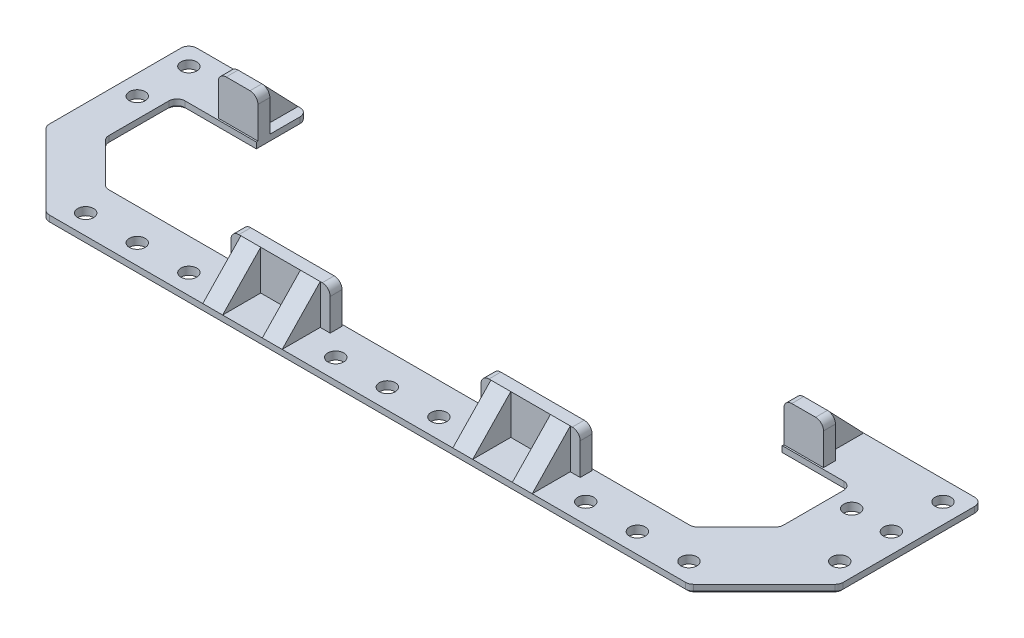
ISO-10303-21;
HEADER;
FILE_DESCRIPTION(('STEP AP214'),'2;1');
FILE_NAME('part.step','',(''),(''),'','','');
FILE_SCHEMA(('AUTOMOTIVE_DESIGN { 1 0 10303 214 1 1 1 1 }'));
ENDSEC;
DATA;
#1=APPLICATION_CONTEXT('core data for automotive mechanical design processes');
#2=APPLICATION_PROTOCOL_DEFINITION('international standard','automotive_design',2000,#1);
#3=PRODUCT_CONTEXT('',#1,'mechanical');
#4=PRODUCT('Part','Part','',(#3));
#5=PRODUCT_RELATED_PRODUCT_CATEGORY('part','',(#4));
#6=PRODUCT_DEFINITION_FORMATION('','',#4);
#7=PRODUCT_DEFINITION_CONTEXT('part definition',#1,'design');
#8=PRODUCT_DEFINITION('design','',#6,#7);
#9=PRODUCT_DEFINITION_SHAPE('','',#8);
#10=(LENGTH_UNIT() NAMED_UNIT(*) SI_UNIT(.MILLI.,.METRE.));
#11=(NAMED_UNIT(*) PLANE_ANGLE_UNIT() SI_UNIT($,.RADIAN.));
#12=(NAMED_UNIT(*) SI_UNIT($,.STERADIAN.) SOLID_ANGLE_UNIT());
#13=UNCERTAINTY_MEASURE_WITH_UNIT(LENGTH_MEASURE(1.E-05),#10,'distance_accuracy_value','');
#14=(GEOMETRIC_REPRESENTATION_CONTEXT(3) GLOBAL_UNCERTAINTY_ASSIGNED_CONTEXT((#13)) GLOBAL_UNIT_ASSIGNED_CONTEXT((#10,
#11,#12)) REPRESENTATION_CONTEXT('',''));
#15=CARTESIAN_POINT('',(0.,0.,0.));
#16=DIRECTION('',(0.,0.,1.));
#17=DIRECTION('',(1.,0.,0.));
#18=AXIS2_PLACEMENT_3D('',#15,#16,#17);
#19=CARTESIAN_POINT('',(0.,2.,0.));
#20=DIRECTION('',(0.,1.,0.));
#21=DIRECTION('',(0.,0.,1.));
#22=AXIS2_PLACEMENT_3D('',#19,#20,#21);
#23=PLANE('',#22);
#24=CARTESIAN_POINT('',(-90.,2.,-24.));
#25=DIRECTION('',(0.,1.,0.));
#26=DIRECTION('',(0.,0.,1.));
#27=AXIS2_PLACEMENT_3D('',#24,#25,#26);
#28=CIRCLE('',#27,1.99999999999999);
#29=CARTESIAN_POINT('',(-90.,2.,-22.));
#30=VERTEX_POINT('',#29);
#31=EDGE_CURVE('E908',#30,#30,#28,.T.);
#32=ORIENTED_EDGE('',*,*,#31,.F.);
#33=EDGE_LOOP('',(#32));
#34=FACE_BOUND('',#33,.T.);
#35=CARTESIAN_POINT('',(100.,2.,-37.));
#36=DIRECTION('',(0.,1.,0.));
#37=DIRECTION('',(0.,0.,1.));
#38=AXIS2_PLACEMENT_3D('',#35,#36,#37);
#39=CIRCLE('',#38,2.);
#40=CARTESIAN_POINT('',(100.,2.,-35.));
#41=VERTEX_POINT('',#40);
#42=EDGE_CURVE('E904',#41,#41,#39,.T.);
#43=ORIENTED_EDGE('',*,*,#42,.F.);
#44=EDGE_LOOP('',(#43));
#45=FACE_BOUND('',#44,.T.);
#46=CARTESIAN_POINT('',(18.,2.,8.));
#47=DIRECTION('',(0.,1.,0.));
#48=DIRECTION('',(0.,0.,1.));
#49=AXIS2_PLACEMENT_3D('',#46,#47,#48);
#50=CIRCLE('',#49,2.);
#51=CARTESIAN_POINT('',(18.,2.,9.99999999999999));
#52=VERTEX_POINT('',#51);
#53=EDGE_CURVE('E912',#52,#52,#50,.T.);
#54=ORIENTED_EDGE('',*,*,#53,.F.);
#55=EDGE_LOOP('',(#54));
#56=FACE_BOUND('',#55,.T.);
#57=CARTESIAN_POINT('',(5.,2.,8.));
#58=DIRECTION('',(0.,1.,0.));
#59=DIRECTION('',(0.,0.,1.));
#60=AXIS2_PLACEMENT_3D('',#57,#58,#59);
#61=CIRCLE('',#60,2.);
#62=CARTESIAN_POINT('',(5.,2.,9.99999999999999));
#63=VERTEX_POINT('',#62);
#64=EDGE_CURVE('E916',#63,#63,#61,.T.);
#65=ORIENTED_EDGE('',*,*,#64,.F.);
#66=EDGE_LOOP('',(#65));
#67=FACE_BOUND('',#66,.T.);
#68=CARTESIAN_POINT('',(-8.,2.,8.));
#69=DIRECTION('',(0.,1.,0.));
#70=DIRECTION('',(0.,0.,1.));
#71=AXIS2_PLACEMENT_3D('',#68,#69,#70);
#72=CIRCLE('',#71,2.);
#73=CARTESIAN_POINT('',(-8.,2.,9.99999999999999));
#74=VERTEX_POINT('',#73);
#75=EDGE_CURVE('E920',#74,#74,#72,.T.);
#76=ORIENTED_EDGE('',*,*,#75,.F.);
#77=EDGE_LOOP('',(#76));
#78=FACE_BOUND('',#77,.T.);
#79=CARTESIAN_POINT('',(81.,2.,8.));
#80=DIRECTION('',(0.,1.,0.));
#81=DIRECTION('',(0.,0.,1.));
#82=AXIS2_PLACEMENT_3D('',#79,#80,#81);
#83=CIRCLE('',#82,2.);
#84=CARTESIAN_POINT('',(81.,2.,9.99999999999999));
#85=VERTEX_POINT('',#84);
#86=EDGE_CURVE('E924',#85,#85,#83,.T.);
#87=ORIENTED_EDGE('',*,*,#86,.F.);
#88=EDGE_LOOP('',(#87));
#89=FACE_BOUND('',#88,.T.);
#90=CARTESIAN_POINT('',(68.,2.,8.));
#91=DIRECTION('',(0.,1.,0.));
#92=DIRECTION('',(0.,0.,1.));
#93=AXIS2_PLACEMENT_3D('',#90,#91,#92);
#94=CIRCLE('',#93,2.);
#95=CARTESIAN_POINT('',(68.,2.,9.99999999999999));
#96=VERTEX_POINT('',#95);
#97=EDGE_CURVE('E928',#96,#96,#94,.T.);
#98=ORIENTED_EDGE('',*,*,#97,.F.);
#99=EDGE_LOOP('',(#98));
#100=FACE_BOUND('',#99,.T.);
#101=CARTESIAN_POINT('',(55.,2.,8.));
#102=DIRECTION('',(0.,1.,0.));
#103=DIRECTION('',(0.,0.,1.));
#104=AXIS2_PLACEMENT_3D('',#101,#102,#103);
#105=CIRCLE('',#104,2.);
#106=CARTESIAN_POINT('',(55.,2.,9.99999999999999));
#107=VERTEX_POINT('',#106);
#108=EDGE_CURVE('E932',#107,#107,#105,.T.);
#109=ORIENTED_EDGE('',*,*,#108,.F.);
#110=EDGE_LOOP('',(#109));
#111=FACE_BOUND('',#110,.T.);
#112=CARTESIAN_POINT('',(100.,2.,-11.));
#113=DIRECTION('',(0.,1.,0.));
#114=DIRECTION('',(0.,0.,1.));
#115=AXIS2_PLACEMENT_3D('',#112,#113,#114);
#116=CIRCLE('',#115,2.);
#117=CARTESIAN_POINT('',(100.,2.,-9.00000000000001));
#118=VERTEX_POINT('',#117);
#119=EDGE_CURVE('E936',#118,#118,#116,.T.);
#120=ORIENTED_EDGE('',*,*,#119,.F.);
#121=EDGE_LOOP('',(#120));
#122=FACE_BOUND('',#121,.T.);
#123=CARTESIAN_POINT('',(100.,2.,-24.));
#124=DIRECTION('',(0.,1.,0.));
#125=DIRECTION('',(0.,0.,1.));
#126=AXIS2_PLACEMENT_3D('',#123,#124,#125);
#127=CIRCLE('',#126,2.);
#128=CARTESIAN_POINT('',(100.,2.,-22.));
#129=VERTEX_POINT('',#128);
#130=EDGE_CURVE('E940',#129,#129,#127,.T.);
#131=ORIENTED_EDGE('',*,*,#130,.F.);
#132=EDGE_LOOP('',(#131));
#133=FACE_BOUND('',#132,.T.);
#134=CARTESIAN_POINT('',(-45.,2.,8.));
#135=DIRECTION('',(0.,1.,0.));
#136=DIRECTION('',(0.,0.,1.));
#137=AXIS2_PLACEMENT_3D('',#134,#135,#136);
#138=CIRCLE('',#137,2.);
#139=CARTESIAN_POINT('',(-45.,2.,10.));
#140=VERTEX_POINT('',#139);
#141=EDGE_CURVE('E944',#140,#140,#138,.T.);
#142=ORIENTED_EDGE('',*,*,#141,.F.);
#143=EDGE_LOOP('',(#142));
#144=FACE_BOUND('',#143,.T.);
#145=CARTESIAN_POINT('',(-58.,2.,8.));
#146=DIRECTION('',(0.,1.,0.));
#147=DIRECTION('',(0.,0.,1.));
#148=AXIS2_PLACEMENT_3D('',#145,#146,#147);
#149=CIRCLE('',#148,2.);
#150=CARTESIAN_POINT('',(-58.,2.,9.99999999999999));
#151=VERTEX_POINT('',#150);
#152=EDGE_CURVE('E948',#151,#151,#149,.T.);
#153=ORIENTED_EDGE('',*,*,#152,.F.);
#154=EDGE_LOOP('',(#153));
#155=FACE_BOUND('',#154,.T.);
#156=CARTESIAN_POINT('',(-71.,2.,8.));
#157=DIRECTION('',(0.,1.,0.));
#158=DIRECTION('',(0.,0.,1.));
#159=AXIS2_PLACEMENT_3D('',#156,#157,#158);
#160=CIRCLE('',#159,2.);
#161=CARTESIAN_POINT('',(-71.,2.,9.99999999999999));
#162=VERTEX_POINT('',#161);
#163=EDGE_CURVE('E952',#162,#162,#160,.T.);
#164=ORIENTED_EDGE('',*,*,#163,.F.);
#165=EDGE_LOOP('',(#164));
#166=FACE_BOUND('',#165,.T.);
#167=CARTESIAN_POINT('',(90.,2.,-24.));
#168=DIRECTION('',(0.,1.,0.));
#169=DIRECTION('',(0.,0.,1.));
#170=AXIS2_PLACEMENT_3D('',#167,#168,#169);
#171=CIRCLE('',#170,2.);
#172=CARTESIAN_POINT('',(90.,2.,-22.));
#173=VERTEX_POINT('',#172);
#174=EDGE_CURVE('E1027',#173,#173,#171,.T.);
#175=ORIENTED_EDGE('',*,*,#174,.F.);
#176=EDGE_LOOP('',(#175));
#177=FACE_BOUND('',#176,.T.);
#178=CARTESIAN_POINT('',(-90.,2.,-37.));
#179=DIRECTION('',(0.,1.,0.));
#180=DIRECTION('',(0.,0.,1.));
#181=AXIS2_PLACEMENT_3D('',#178,#179,#180);
#182=CIRCLE('',#181,2.);
#183=CARTESIAN_POINT('',(-90.,2.,-35.));
#184=VERTEX_POINT('',#183);
#185=EDGE_CURVE('E956',#184,#184,#182,.T.);
#186=ORIENTED_EDGE('',*,*,#185,.F.);
#187=EDGE_LOOP('',(#186));
#188=FACE_BOUND('',#187,.T.);
#189=DIRECTION('',(0.,0.,1.));
#190=VECTOR('',#189,1.);
#191=CARTESIAN_POINT('',(105.,2.,0.));
#192=LINE('',#191,#190);
#193=CARTESIAN_POINT('',(105.,2.,-40.));
#194=VERTEX_POINT('',#193);
#195=CARTESIAN_POINT('',(105.,2.,-6.82842712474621));
#196=VERTEX_POINT('',#195);
#197=EDGE_CURVE('E900',#194,#196,#192,.T.);
#198=ORIENTED_EDGE('',*,*,#197,.F.);
#199=CARTESIAN_POINT('',(103.,2.,-40.));
#200=DIRECTION('',(0.,1.,0.));
#201=DIRECTION('',(0.,0.,1.));
#202=AXIS2_PLACEMENT_3D('',#199,#200,#201);
#203=CIRCLE('',#202,2.);
#204=CARTESIAN_POINT('',(103.,2.,-42.));
#205=VERTEX_POINT('',#204);
#206=EDGE_CURVE('E1172',#194,#205,#203,.T.);
#207=ORIENTED_EDGE('',*,*,#206,.T.);
#208=DIRECTION('',(1.,0.,0.));
#209=VECTOR('',#208,1.);
#210=CARTESIAN_POINT('',(0.,2.,-41.9999999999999));
#211=LINE('',#210,#209);
#212=CARTESIAN_POINT('',(75.,2.,-42.));
#213=VERTEX_POINT('',#212);
#214=EDGE_CURVE('E849',#213,#205,#211,.T.);
#215=ORIENTED_EDGE('',*,*,#214,.F.);
#216=DIRECTION('',(0.,0.,-1.));
#217=VECTOR('',#216,1.);
#218=CARTESIAN_POINT('',(75.,2.,0.));
#219=LINE('',#218,#217);
#220=CARTESIAN_POINT('',(75.,2.,-32.4));
#221=VERTEX_POINT('',#220);
#222=EDGE_CURVE('E607',#221,#213,#219,.T.);
#223=ORIENTED_EDGE('',*,*,#222,.F.);
#224=DIRECTION('',(1.,0.,0.));
#225=VECTOR('',#224,1.);
#226=CARTESIAN_POINT('',(0.,2.,-32.4));
#227=LINE('',#226,#225);
#228=CARTESIAN_POINT('',(77.5,2.,-32.4));
#229=VERTEX_POINT('',#228);
#230=EDGE_CURVE('E618',#221,#229,#227,.T.);
#231=ORIENTED_EDGE('',*,*,#230,.T.);
#232=DIRECTION('',(0.,0.,-1.));
#233=VECTOR('',#232,1.);
#234=CARTESIAN_POINT('',(77.5,2.,0.));
#235=LINE('',#234,#233);
#236=CARTESIAN_POINT('',(77.5,2.,-29.4));
#237=VERTEX_POINT('',#236);
#238=EDGE_CURVE('E639',#237,#229,#235,.T.);
#239=ORIENTED_EDGE('',*,*,#238,.F.);
#240=DIRECTION('',(1.,0.,0.));
#241=VECTOR('',#240,1.);
#242=CARTESIAN_POINT('',(0.,2.,-29.4));
#243=LINE('',#242,#241);
#244=CARTESIAN_POINT('',(67.5,2.,-29.4));
#245=VERTEX_POINT('',#244);
#246=EDGE_CURVE('E1702',#245,#237,#243,.T.);
#247=ORIENTED_EDGE('',*,*,#246,.F.);
#248=DIRECTION('',(0.,0.,-1.));
#249=VECTOR('',#248,1.);
#250=CARTESIAN_POINT('',(67.5,2.,0.));
#251=LINE('',#250,#249);
#252=CARTESIAN_POINT('',(67.5,2.,-29.));
#253=VERTEX_POINT('',#252);
#254=EDGE_CURVE('E850',#253,#245,#251,.T.);
#255=ORIENTED_EDGE('',*,*,#254,.F.);
#256=DIRECTION('',(1.,0.,0.));
#257=VECTOR('',#256,1.);
#258=CARTESIAN_POINT('',(0.,2.,-29.));
#259=LINE('',#258,#257);
#260=CARTESIAN_POINT('',(83.,2.,-29.));
#261=VERTEX_POINT('',#260);
#262=EDGE_CURVE('E854',#253,#261,#259,.T.);
#263=ORIENTED_EDGE('',*,*,#262,.T.);
#264=CARTESIAN_POINT('',(83.,2.,-27.));
#265=DIRECTION('',(0.,1.,0.));
#266=DIRECTION('',(0.,0.,1.));
#267=AXIS2_PLACEMENT_3D('',#264,#265,#266);
#268=CIRCLE('',#267,2.);
#269=CARTESIAN_POINT('',(85.,2.,-27.));
#270=VERTEX_POINT('',#269);
#271=EDGE_CURVE('E1264',#261,#270,#268,.F.);
#272=ORIENTED_EDGE('',*,*,#271,.T.);
#273=DIRECTION('',(0.,0.,-1.));
#274=VECTOR('',#273,1.);
#275=CARTESIAN_POINT('',(85.,2.,-29.));
#276=LINE('',#275,#274);
#277=CARTESIAN_POINT('',(85.,2.,-11.8284271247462));
#278=VERTEX_POINT('',#277);
#279=EDGE_CURVE('E1031',#278,#270,#276,.T.);
#280=ORIENTED_EDGE('',*,*,#279,.F.);
#281=CARTESIAN_POINT('',(83.,2.,-11.8284271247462));
#282=DIRECTION('',(0.,1.,0.));
#283=DIRECTION('',(0.,0.,1.));
#284=AXIS2_PLACEMENT_3D('',#281,#282,#283);
#285=CIRCLE('',#284,2.);
#286=CARTESIAN_POINT('',(84.4142135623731,2.,-10.4142135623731));
#287=VERTEX_POINT('',#286);
#288=EDGE_CURVE('E1267',#278,#287,#285,.F.);
#289=ORIENTED_EDGE('',*,*,#288,.T.);
#290=DIRECTION('',(0.707106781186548,0.,-0.707106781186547));
#291=VECTOR('',#290,1.);
#292=CARTESIAN_POINT('',(85.,2.,-11.));
#293=LINE('',#292,#291);
#294=CARTESIAN_POINT('',(74.5857864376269,2.,-0.585786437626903));
#295=VERTEX_POINT('',#294);
#296=EDGE_CURVE('E598',#295,#287,#293,.T.);
#297=ORIENTED_EDGE('',*,*,#296,.F.);
#298=CARTESIAN_POINT('',(73.1715728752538,2.,-2.));
#299=DIRECTION('',(0.,1.,0.));
#300=DIRECTION('',(0.,0.,1.));
#301=AXIS2_PLACEMENT_3D('',#298,#299,#300);
#302=CIRCLE('',#301,2.);
#303=CARTESIAN_POINT('',(73.1715728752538,2.,0.));
#304=VERTEX_POINT('',#303);
#305=EDGE_CURVE('E1270',#295,#304,#302,.F.);
#306=ORIENTED_EDGE('',*,*,#305,.T.);
#307=DIRECTION('',(1.,0.,0.));
#308=VECTOR('',#307,1.);
#309=CARTESIAN_POINT('',(0.,2.,0.));
#310=LINE('',#309,#308);
#311=CARTESIAN_POINT('',(-73.1715728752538,2.,0.));
#312=VERTEX_POINT('',#311);
#313=EDGE_CURVE('E858',#312,#304,#310,.T.);
#314=ORIENTED_EDGE('',*,*,#313,.F.);
#315=CARTESIAN_POINT('',(-73.1715728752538,2.,-2.));
#316=DIRECTION('',(0.,1.,0.));
#317=DIRECTION('',(0.,0.,1.));
#318=AXIS2_PLACEMENT_3D('',#315,#316,#317);
#319=CIRCLE('',#318,2.);
#320=CARTESIAN_POINT('',(-74.5857864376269,2.,-0.585786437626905));
#321=VERTEX_POINT('',#320);
#322=EDGE_CURVE('E1273',#312,#321,#319,.F.);
#323=ORIENTED_EDGE('',*,*,#322,.T.);
#324=DIRECTION('',(0.707106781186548,0.,0.707106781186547));
#325=VECTOR('',#324,1.);
#326=CARTESIAN_POINT('',(-36.9999999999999,2.,37.));
#327=LINE('',#326,#325);
#328=CARTESIAN_POINT('',(-84.4142135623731,2.,-10.4142135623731));
#329=VERTEX_POINT('',#328);
#330=EDGE_CURVE('E862',#329,#321,#327,.T.);
#331=ORIENTED_EDGE('',*,*,#330,.F.);
#332=CARTESIAN_POINT('',(-83.,2.,-11.8284271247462));
#333=DIRECTION('',(0.,1.,0.));
#334=DIRECTION('',(0.,0.,1.));
#335=AXIS2_PLACEMENT_3D('',#332,#333,#334);
#336=CIRCLE('',#335,2.);
#337=CARTESIAN_POINT('',(-85.,2.,-11.8284271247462));
#338=VERTEX_POINT('',#337);
#339=EDGE_CURVE('E1276',#329,#338,#336,.F.);
#340=ORIENTED_EDGE('',*,*,#339,.T.);
#341=DIRECTION('',(0.,0.,1.));
#342=VECTOR('',#341,1.);
#343=CARTESIAN_POINT('',(-85.,2.,0.));
#344=LINE('',#343,#342);
#345=CARTESIAN_POINT('',(-85.,2.,-27.));
#346=VERTEX_POINT('',#345);
#347=EDGE_CURVE('E866',#346,#338,#344,.T.);
#348=ORIENTED_EDGE('',*,*,#347,.F.);
#349=CARTESIAN_POINT('',(-83.,2.,-27.));
#350=DIRECTION('',(0.,1.,0.));
#351=DIRECTION('',(0.,0.,1.));
#352=AXIS2_PLACEMENT_3D('',#349,#350,#351);
#353=CIRCLE('',#352,2.);
#354=CARTESIAN_POINT('',(-83.,2.,-29.));
#355=VERTEX_POINT('',#354);
#356=EDGE_CURVE('E1279',#346,#355,#353,.F.);
#357=ORIENTED_EDGE('',*,*,#356,.T.);
#358=DIRECTION('',(1.,0.,0.));
#359=VECTOR('',#358,1.);
#360=CARTESIAN_POINT('',(0.,2.,-29.));
#361=LINE('',#360,#359);
#362=CARTESIAN_POINT('',(-65.,2.,-29.));
#363=VERTEX_POINT('',#362);
#364=EDGE_CURVE('E870',#355,#363,#361,.T.);
#365=ORIENTED_EDGE('',*,*,#364,.T.);
#366=DIRECTION('',(0.,0.,1.));
#367=VECTOR('',#366,1.);
#368=CARTESIAN_POINT('',(-64.9999999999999,2.,0.));
#369=LINE('',#368,#367);
#370=CARTESIAN_POINT('',(-65.,2.,-29.4));
#371=VERTEX_POINT('',#370);
#372=EDGE_CURVE('E873',#371,#363,#369,.T.);
#373=ORIENTED_EDGE('',*,*,#372,.F.);
#374=DIRECTION('',(1.,0.,0.));
#375=VECTOR('',#374,1.);
#376=CARTESIAN_POINT('',(0.,2.,-29.4));
#377=LINE('',#376,#375);
#378=CARTESIAN_POINT('',(-75.,2.,-29.4));
#379=VERTEX_POINT('',#378);
#380=EDGE_CURVE('E816',#379,#371,#377,.T.);
#381=ORIENTED_EDGE('',*,*,#380,.F.);
#382=DIRECTION('',(0.,0.,-1.));
#383=VECTOR('',#382,1.);
#384=CARTESIAN_POINT('',(-75.,2.,0.));
#385=LINE('',#384,#383);
#386=CARTESIAN_POINT('',(-75.,2.,-32.4));
#387=VERTEX_POINT('',#386);
#388=EDGE_CURVE('E811',#379,#387,#385,.T.);
#389=ORIENTED_EDGE('',*,*,#388,.T.);
#390=DIRECTION('',(1.,0.,0.));
#391=VECTOR('',#390,1.);
#392=CARTESIAN_POINT('',(0.,2.,-32.4));
#393=LINE('',#392,#391);
#394=CARTESIAN_POINT('',(-72.5,2.,-32.4));
#395=VERTEX_POINT('',#394);
#396=EDGE_CURVE('E808',#387,#395,#393,.T.);
#397=ORIENTED_EDGE('',*,*,#396,.T.);
#398=DIRECTION('',(0.,0.,-1.));
#399=VECTOR('',#398,1.);
#400=CARTESIAN_POINT('',(-72.5,2.,0.));
#401=LINE('',#400,#399);
#402=CARTESIAN_POINT('',(-72.5,2.,-42.));
#403=VERTEX_POINT('',#402);
#404=EDGE_CURVE('E795',#395,#403,#401,.T.);
#405=ORIENTED_EDGE('',*,*,#404,.T.);
#406=DIRECTION('',(-1.,0.,0.));
#407=VECTOR('',#406,1.);
#408=CARTESIAN_POINT('',(0.,2.,-42.));
#409=LINE('',#408,#407);
#410=CARTESIAN_POINT('',(-93.,2.,-42.));
#411=VERTEX_POINT('',#410);
#412=EDGE_CURVE('E877',#403,#411,#409,.T.);
#413=ORIENTED_EDGE('',*,*,#412,.T.);
#414=CARTESIAN_POINT('',(-93.,2.,-40.));
#415=DIRECTION('',(0.,1.,0.));
#416=DIRECTION('',(0.,0.,1.));
#417=AXIS2_PLACEMENT_3D('',#414,#415,#416);
#418=CIRCLE('',#417,2.);
#419=CARTESIAN_POINT('',(-95.,2.,-40.));
#420=VERTEX_POINT('',#419);
#421=EDGE_CURVE('E1157',#411,#420,#418,.T.);
#422=ORIENTED_EDGE('',*,*,#421,.T.);
#423=DIRECTION('',(0.,0.,1.));
#424=VECTOR('',#423,1.);
#425=CARTESIAN_POINT('',(-95.,2.,0.));
#426=LINE('',#425,#424);
#427=CARTESIAN_POINT('',(-95.,2.,-6.8284271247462));
#428=VERTEX_POINT('',#427);
#429=EDGE_CURVE('E881',#420,#428,#426,.T.);
#430=ORIENTED_EDGE('',*,*,#429,.T.);
#431=CARTESIAN_POINT('',(-93.,2.,-6.8284271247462));
#432=DIRECTION('',(0.,1.,0.));
#433=DIRECTION('',(0.,0.,1.));
#434=AXIS2_PLACEMENT_3D('',#431,#432,#433);
#435=CIRCLE('',#434,2.);
#436=CARTESIAN_POINT('',(-94.4142135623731,2.,-5.41421356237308));
#437=VERTEX_POINT('',#436);
#438=EDGE_CURVE('E1160',#428,#437,#435,.T.);
#439=ORIENTED_EDGE('',*,*,#438,.T.);
#440=DIRECTION('',(-0.707106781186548,0.,-0.707106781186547));
#441=VECTOR('',#440,1.);
#442=CARTESIAN_POINT('',(-44.5,2.,44.5));
#443=LINE('',#442,#441);
#444=CARTESIAN_POINT('',(-76.5857864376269,2.,12.4142135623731));
#445=VERTEX_POINT('',#444);
#446=EDGE_CURVE('E885',#445,#437,#443,.T.);
#447=ORIENTED_EDGE('',*,*,#446,.F.);
#448=CARTESIAN_POINT('',(-75.1715728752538,2.,11.));
#449=DIRECTION('',(0.,1.,0.));
#450=DIRECTION('',(0.,0.,1.));
#451=AXIS2_PLACEMENT_3D('',#448,#449,#450);
#452=CIRCLE('',#451,2.);
#453=CARTESIAN_POINT('',(-75.1715728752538,2.,13.));
#454=VERTEX_POINT('',#453);
#455=EDGE_CURVE('E1163',#445,#454,#452,.T.);
#456=ORIENTED_EDGE('',*,*,#455,.T.);
#457=DIRECTION('',(-1.,0.,0.));
#458=VECTOR('',#457,1.);
#459=CARTESIAN_POINT('',(0.,2.,13.));
#460=LINE('',#459,#458);
#461=CARTESIAN_POINT('',(-36.5,2.,13.));
#462=VERTEX_POINT('',#461);
#463=EDGE_CURVE('E889',#462,#454,#460,.T.);
#464=ORIENTED_EDGE('',*,*,#463,.F.);
#465=DIRECTION('',(0.,0.,1.));
#466=VECTOR('',#465,1.);
#467=CARTESIAN_POINT('',(-36.5,2.,0.));
#468=LINE('',#467,#466);
#469=CARTESIAN_POINT('',(-36.5,2.,3.40000000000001));
#470=VERTEX_POINT('',#469);
#471=EDGE_CURVE('E752',#470,#462,#468,.T.);
#472=ORIENTED_EDGE('',*,*,#471,.F.);
#473=DIRECTION('',(1.,0.,0.));
#474=VECTOR('',#473,1.);
#475=CARTESIAN_POINT('',(0.,2.,3.40000000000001));
#476=LINE('',#475,#474);
#477=CARTESIAN_POINT('',(-39.,2.,3.40000000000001));
#478=VERTEX_POINT('',#477);
#479=EDGE_CURVE('E749',#478,#470,#476,.T.);
#480=ORIENTED_EDGE('',*,*,#479,.F.);
#481=DIRECTION('',(0.,0.,1.));
#482=VECTOR('',#481,1.);
#483=CARTESIAN_POINT('',(-39.,2.,0.));
#484=LINE('',#483,#482);
#485=CARTESIAN_POINT('',(-39.,2.,0.400000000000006));
#486=VERTEX_POINT('',#485);
#487=EDGE_CURVE('E745',#486,#478,#484,.T.);
#488=ORIENTED_EDGE('',*,*,#487,.F.);
#489=DIRECTION('',(1.,0.,0.));
#490=VECTOR('',#489,1.);
#491=CARTESIAN_POINT('',(0.,2.,0.400000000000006));
#492=LINE('',#491,#490);
#493=CARTESIAN_POINT('',(-14.,2.,0.400000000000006));
#494=VERTEX_POINT('',#493);
#495=EDGE_CURVE('E741',#486,#494,#492,.T.);
#496=ORIENTED_EDGE('',*,*,#495,.T.);
#497=DIRECTION('',(0.,0.,1.));
#498=VECTOR('',#497,1.);
#499=CARTESIAN_POINT('',(-14.,2.,0.));
#500=LINE('',#499,#498);
#501=CARTESIAN_POINT('',(-14.,2.,3.40000000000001));
#502=VERTEX_POINT('',#501);
#503=EDGE_CURVE('E727',#494,#502,#500,.T.);
#504=ORIENTED_EDGE('',*,*,#503,.T.);
#505=CARTESIAN_POINT('',(-16.5,2.,3.40000000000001));
#506=VERTEX_POINT('',#505);
#507=EDGE_CURVE('E733',#506,#502,#476,.T.);
#508=ORIENTED_EDGE('',*,*,#507,.F.);
#509=DIRECTION('',(0.,0.,1.));
#510=VECTOR('',#509,1.);
#511=CARTESIAN_POINT('',(-16.5,2.,0.));
#512=LINE('',#511,#510);
#513=CARTESIAN_POINT('',(-16.5,2.,13.));
#514=VERTEX_POINT('',#513);
#515=EDGE_CURVE('E765',#506,#514,#512,.T.);
#516=ORIENTED_EDGE('',*,*,#515,.T.);
#517=CARTESIAN_POINT('',(26.5,2.,13.));
#518=VERTEX_POINT('',#517);
#519=EDGE_CURVE('E895',#518,#514,#460,.T.);
#520=ORIENTED_EDGE('',*,*,#519,.F.);
#521=DIRECTION('',(0.,0.,1.));
#522=VECTOR('',#521,1.);
#523=CARTESIAN_POINT('',(26.5,2.,0.));
#524=LINE('',#523,#522);
#525=CARTESIAN_POINT('',(26.5,2.,3.40000000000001));
#526=VERTEX_POINT('',#525);
#527=EDGE_CURVE('E686',#526,#518,#524,.T.);
#528=ORIENTED_EDGE('',*,*,#527,.F.);
#529=DIRECTION('',(-1.,0.,0.));
#530=VECTOR('',#529,1.);
#531=CARTESIAN_POINT('',(0.,2.,3.40000000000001));
#532=LINE('',#531,#530);
#533=CARTESIAN_POINT('',(24.,2.,3.40000000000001));
#534=VERTEX_POINT('',#533);
#535=EDGE_CURVE('E682',#526,#534,#532,.T.);
#536=ORIENTED_EDGE('',*,*,#535,.T.);
#537=DIRECTION('',(0.,0.,1.));
#538=VECTOR('',#537,1.);
#539=CARTESIAN_POINT('',(24.,2.,0.));
#540=LINE('',#539,#538);
#541=CARTESIAN_POINT('',(24.,2.,0.400000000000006));
#542=VERTEX_POINT('',#541);
#543=EDGE_CURVE('E678',#542,#534,#540,.T.);
#544=ORIENTED_EDGE('',*,*,#543,.F.);
#545=DIRECTION('',(-1.,0.,0.));
#546=VECTOR('',#545,1.);
#547=CARTESIAN_POINT('',(0.,2.,0.400000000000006));
#548=LINE('',#547,#546);
#549=CARTESIAN_POINT('',(49.,2.,0.400000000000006));
#550=VERTEX_POINT('',#549);
#551=EDGE_CURVE('E674',#550,#542,#548,.T.);
#552=ORIENTED_EDGE('',*,*,#551,.F.);
#553=DIRECTION('',(0.,0.,1.));
#554=VECTOR('',#553,1.);
#555=CARTESIAN_POINT('',(49.,2.,0.));
#556=LINE('',#555,#554);
#557=CARTESIAN_POINT('',(49.,2.,3.40000000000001));
#558=VERTEX_POINT('',#557);
#559=EDGE_CURVE('E659',#550,#558,#556,.T.);
#560=ORIENTED_EDGE('',*,*,#559,.T.);
#561=CARTESIAN_POINT('',(46.5,2.,3.40000000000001));
#562=VERTEX_POINT('',#561);
#563=EDGE_CURVE('E665',#558,#562,#532,.T.);
#564=ORIENTED_EDGE('',*,*,#563,.T.);
#565=DIRECTION('',(0.,0.,1.));
#566=VECTOR('',#565,1.);
#567=CARTESIAN_POINT('',(46.5,2.,0.));
#568=LINE('',#567,#566);
#569=CARTESIAN_POINT('',(46.5,2.,13.));
#570=VERTEX_POINT('',#569);
#571=EDGE_CURVE('E699',#562,#570,#568,.T.);
#572=ORIENTED_EDGE('',*,*,#571,.T.);
#573=CARTESIAN_POINT('',(85.1715728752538,2.,13.));
#574=VERTEX_POINT('',#573);
#575=EDGE_CURVE('E890',#574,#570,#460,.T.);
#576=ORIENTED_EDGE('',*,*,#575,.F.);
#577=CARTESIAN_POINT('',(85.1715728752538,2.,11.));
#578=DIRECTION('',(0.,1.,0.));
#579=DIRECTION('',(0.,0.,1.));
#580=AXIS2_PLACEMENT_3D('',#577,#578,#579);
#581=CIRCLE('',#580,2.);
#582=CARTESIAN_POINT('',(86.5857864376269,2.,12.4142135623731));
#583=VERTEX_POINT('',#582);
#584=EDGE_CURVE('E1166',#574,#583,#581,.T.);
#585=ORIENTED_EDGE('',*,*,#584,.T.);
#586=DIRECTION('',(-0.707106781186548,0.,0.707106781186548));
#587=VECTOR('',#586,1.);
#588=CARTESIAN_POINT('',(49.5,2.,49.5));
#589=LINE('',#588,#587);
#590=CARTESIAN_POINT('',(104.414213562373,2.,-5.41421356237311));
#591=VERTEX_POINT('',#590);
#592=EDGE_CURVE('E893',#591,#583,#589,.T.);
#593=ORIENTED_EDGE('',*,*,#592,.F.);
#594=CARTESIAN_POINT('',(103.,2.,-6.82842712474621));
#595=DIRECTION('',(0.,1.,0.));
#596=DIRECTION('',(0.,0.,1.));
#597=AXIS2_PLACEMENT_3D('',#594,#595,#596);
#598=CIRCLE('',#597,2.);
#599=EDGE_CURVE('E1169',#591,#196,#598,.T.);
#600=ORIENTED_EDGE('',*,*,#599,.T.);
#601=EDGE_LOOP('',(#198,#207,#215,#223,#231,#239,#247,#255,#263,#272,#280,#289,#297,#306,#314,
#323,#331,#340,#348,#357,#365,#373,#381,#389,#397,#405,#413,#422,#430,#439,#447,#456,#464,#472,
#480,#488,#496,#504,#508,#516,#520,#528,#536,#544,#552,#560,#564,#572,#576,#585,#593,#600));
#602=FACE_BOUND('',#601,.T.);
#603=ADVANCED_FACE('F42',(#34,#45,#56,#67,#78,#89,#100,#111,#122,#133,#144,#155,#166,#177,#188,
#602),#23,.T.);
#604=CARTESIAN_POINT('',(69.5,2.,-42.));
#605=VERTEX_POINT('',#604);
#606=CARTESIAN_POINT('',(70.,2.,-42.));
#607=VERTEX_POINT('',#606);
#608=EDGE_CURVE('E845',#605,#607,#211,.T.);
#609=ORIENTED_EDGE('',*,*,#608,.F.);
#610=CARTESIAN_POINT('',(69.5,2.,-40.));
#611=DIRECTION('',(0.,1.,0.));
#612=DIRECTION('',(0.,0.,1.));
#613=AXIS2_PLACEMENT_3D('',#610,#611,#612);
#614=CIRCLE('',#613,2.);
#615=CARTESIAN_POINT('',(67.5,2.,-40.));
#616=VERTEX_POINT('',#615);
#617=EDGE_CURVE('E1179',#605,#616,#614,.T.);
#618=ORIENTED_EDGE('',*,*,#617,.T.);
#619=CARTESIAN_POINT('',(67.5,2.,-32.4));
#620=VERTEX_POINT('',#619);
#621=EDGE_CURVE('E848',#620,#616,#251,.T.);
#622=ORIENTED_EDGE('',*,*,#621,.F.);
#623=CARTESIAN_POINT('',(70.,2.,-32.4));
#624=VERTEX_POINT('',#623);
#625=EDGE_CURVE('E641',#620,#624,#227,.T.);
#626=ORIENTED_EDGE('',*,*,#625,.T.);
#627=DIRECTION('',(0.,0.,-1.));
#628=VECTOR('',#627,1.);
#629=CARTESIAN_POINT('',(70.,2.,0.));
#630=LINE('',#629,#628);
#631=EDGE_CURVE('E1691',#624,#607,#630,.T.);
#632=ORIENTED_EDGE('',*,*,#631,.T.);
#633=EDGE_LOOP('',(#609,#618,#622,#626,#632));
#634=FACE_BOUND('',#633,.T.);
#635=ADVANCED_FACE('F1750',(#634),#23,.T.);
#636=DIRECTION('',(0.,0.,1.));
#637=VECTOR('',#636,1.);
#638=CARTESIAN_POINT('',(31.5,2.,0.));
#639=LINE('',#638,#637);
#640=CARTESIAN_POINT('',(31.5,2.,3.40000000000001));
#641=VERTEX_POINT('',#640);
#642=CARTESIAN_POINT('',(31.5,2.,13.));
#643=VERTEX_POINT('',#642);
#644=EDGE_CURVE('E691',#641,#643,#639,.T.);
#645=ORIENTED_EDGE('',*,*,#644,.T.);
#646=CARTESIAN_POINT('',(41.5,2.,13.));
#647=VERTEX_POINT('',#646);
#648=EDGE_CURVE('E894',#647,#643,#460,.T.);
#649=ORIENTED_EDGE('',*,*,#648,.F.);
#650=DIRECTION('',(0.,0.,1.));
#651=VECTOR('',#650,1.);
#652=CARTESIAN_POINT('',(41.5,2.,0.));
#653=LINE('',#652,#651);
#654=CARTESIAN_POINT('',(41.5,2.,3.40000000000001));
#655=VERTEX_POINT('',#654);
#656=EDGE_CURVE('E695',#655,#647,#653,.T.);
#657=ORIENTED_EDGE('',*,*,#656,.F.);
#658=EDGE_CURVE('E687',#655,#641,#532,.T.);
#659=ORIENTED_EDGE('',*,*,#658,.T.);
#660=EDGE_LOOP('',(#645,#649,#657,#659));
#661=FACE_BOUND('',#660,.T.);
#662=ADVANCED_FACE('F1660',(#661),#23,.T.);
#663=DIRECTION('',(0.,0.,1.));
#664=VECTOR('',#663,1.);
#665=CARTESIAN_POINT('',(-31.5,2.,0.));
#666=LINE('',#665,#664);
#667=CARTESIAN_POINT('',(-31.5,2.,3.40000000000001));
#668=VERTEX_POINT('',#667);
#669=CARTESIAN_POINT('',(-31.5,2.,13.));
#670=VERTEX_POINT('',#669);
#671=EDGE_CURVE('E757',#668,#670,#666,.T.);
#672=ORIENTED_EDGE('',*,*,#671,.T.);
#673=CARTESIAN_POINT('',(-21.5,2.,13.));
#674=VERTEX_POINT('',#673);
#675=EDGE_CURVE('E896',#674,#670,#460,.T.);
#676=ORIENTED_EDGE('',*,*,#675,.F.);
#677=DIRECTION('',(0.,0.,1.));
#678=VECTOR('',#677,1.);
#679=CARTESIAN_POINT('',(-21.5,2.,0.));
#680=LINE('',#679,#678);
#681=CARTESIAN_POINT('',(-21.5,2.,3.40000000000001));
#682=VERTEX_POINT('',#681);
#683=EDGE_CURVE('E761',#682,#674,#680,.T.);
#684=ORIENTED_EDGE('',*,*,#683,.F.);
#685=EDGE_CURVE('E753',#668,#682,#476,.T.);
#686=ORIENTED_EDGE('',*,*,#685,.F.);
#687=EDGE_LOOP('',(#672,#676,#684,#686));
#688=FACE_BOUND('',#687,.T.);
#689=ADVANCED_FACE('F1650',(#688),#23,.T.);
#690=CARTESIAN_POINT('',(-65.,2.,-40.));
#691=VERTEX_POINT('',#690);
#692=CARTESIAN_POINT('',(-65.,2.,-32.4));
#693=VERTEX_POINT('',#692);
#694=EDGE_CURVE('E874',#691,#693,#369,.T.);
#695=ORIENTED_EDGE('',*,*,#694,.F.);
#696=CARTESIAN_POINT('',(-67.,2.,-40.));
#697=DIRECTION('',(0.,1.,0.));
#698=DIRECTION('',(0.,0.,1.));
#699=AXIS2_PLACEMENT_3D('',#696,#697,#698);
#700=CIRCLE('',#699,2.);
#701=CARTESIAN_POINT('',(-67.,2.,-42.));
#702=VERTEX_POINT('',#701);
#703=EDGE_CURVE('E1261',#691,#702,#700,.T.);
#704=ORIENTED_EDGE('',*,*,#703,.T.);
#705=CARTESIAN_POINT('',(-67.5,2.,-42.));
#706=VERTEX_POINT('',#705);
#707=EDGE_CURVE('E878',#702,#706,#409,.T.);
#708=ORIENTED_EDGE('',*,*,#707,.T.);
#709=DIRECTION('',(0.,0.,-1.));
#710=VECTOR('',#709,1.);
#711=CARTESIAN_POINT('',(-67.5,2.,0.));
#712=LINE('',#711,#710);
#713=CARTESIAN_POINT('',(-67.5,2.,-32.4));
#714=VERTEX_POINT('',#713);
#715=EDGE_CURVE('E800',#714,#706,#712,.T.);
#716=ORIENTED_EDGE('',*,*,#715,.F.);
#717=EDGE_CURVE('E812',#714,#693,#393,.T.);
#718=ORIENTED_EDGE('',*,*,#717,.T.);
#719=EDGE_LOOP('',(#695,#704,#708,#716,#718));
#720=FACE_BOUND('',#719,.T.);
#721=ADVANCED_FACE('F1753',(#720),#23,.T.);
#722=CARTESIAN_POINT('',(0.,0.,0.));
#723=DIRECTION('',(0.,1.,0.));
#724=DIRECTION('',(0.,0.,1.));
#725=AXIS2_PLACEMENT_3D('',#722,#723,#724);
#726=PLANE('',#725);
#727=DIRECTION('',(0.,0.,1.));
#728=VECTOR('',#727,1.);
#729=CARTESIAN_POINT('',(-65.5,0.,-29.));
#730=LINE('',#729,#728);
#731=CARTESIAN_POINT('',(-65.5,0.,-40.));
#732=VERTEX_POINT('',#731);
#733=CARTESIAN_POINT('',(-65.5,0.,-29.5));
#734=VERTEX_POINT('',#733);
#735=EDGE_CURVE('E1334',#732,#734,#730,.T.);
#736=ORIENTED_EDGE('',*,*,#735,.T.);
#737=DIRECTION('',(-1.,0.,0.));
#738=VECTOR('',#737,1.);
#739=CARTESIAN_POINT('',(0.,0.,-29.5));
#740=LINE('',#739,#738);
#741=CARTESIAN_POINT('',(-83.,0.,-29.5));
#742=VERTEX_POINT('',#741);
#743=EDGE_CURVE('E1373',#734,#742,#740,.T.);
#744=ORIENTED_EDGE('',*,*,#743,.T.);
#745=CARTESIAN_POINT('',(-83.,0.,-27.));
#746=DIRECTION('',(0.,1.,0.));
#747=DIRECTION('',(0.,0.,1.));
#748=AXIS2_PLACEMENT_3D('',#745,#746,#747);
#749=CIRCLE('',#748,2.50000000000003);
#750=CARTESIAN_POINT('',(-85.5,0.,-27.));
#751=VERTEX_POINT('',#750);
#752=EDGE_CURVE('E1370',#742,#751,#749,.T.);
#753=ORIENTED_EDGE('',*,*,#752,.T.);
#754=DIRECTION('',(0.,0.,1.));
#755=VECTOR('',#754,1.);
#756=CARTESIAN_POINT('',(-85.5,0.,-11.8284271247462));
#757=LINE('',#756,#755);
#758=CARTESIAN_POINT('',(-85.5,0.,-11.8284271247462));
#759=VERTEX_POINT('',#758);
#760=EDGE_CURVE('E1367',#751,#759,#757,.T.);
#761=ORIENTED_EDGE('',*,*,#760,.T.);
#762=CARTESIAN_POINT('',(-83.,0.,-11.8284271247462));
#763=DIRECTION('',(0.,1.,0.));
#764=DIRECTION('',(0.,0.,1.));
#765=AXIS2_PLACEMENT_3D('',#762,#763,#764);
#766=CIRCLE('',#765,2.50000000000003);
#767=CARTESIAN_POINT('',(-84.7677669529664,0.,-10.0606601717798));
#768=VERTEX_POINT('',#767);
#769=EDGE_CURVE('E1364',#759,#768,#766,.T.);
#770=ORIENTED_EDGE('',*,*,#769,.T.);
#771=DIRECTION('',(0.707106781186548,0.,0.707106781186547));
#772=VECTOR('',#771,1.);
#773=CARTESIAN_POINT('',(-74.9393398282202,0.,-0.232233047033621));
#774=LINE('',#773,#772);
#775=CARTESIAN_POINT('',(-74.9393398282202,0.,-0.232233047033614));
#776=VERTEX_POINT('',#775);
#777=EDGE_CURVE('E1361',#768,#776,#774,.T.);
#778=ORIENTED_EDGE('',*,*,#777,.T.);
#779=CARTESIAN_POINT('',(-73.1715728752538,0.,-2.));
#780=DIRECTION('',(0.,1.,0.));
#781=DIRECTION('',(0.,0.,1.));
#782=AXIS2_PLACEMENT_3D('',#779,#780,#781);
#783=CIRCLE('',#782,2.50000000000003);
#784=CARTESIAN_POINT('',(-73.1715728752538,0.,0.500000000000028));
#785=VERTEX_POINT('',#784);
#786=EDGE_CURVE('E1358',#776,#785,#783,.T.);
#787=ORIENTED_EDGE('',*,*,#786,.T.);
#788=DIRECTION('',(1.,0.,0.));
#789=VECTOR('',#788,1.);
#790=CARTESIAN_POINT('',(73.1715728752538,0.,0.500000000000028));
#791=LINE('',#790,#789);
#792=CARTESIAN_POINT('',(73.1715728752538,0.,0.50000000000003));
#793=VERTEX_POINT('',#792);
#794=EDGE_CURVE('E1355',#785,#793,#791,.T.);
#795=ORIENTED_EDGE('',*,*,#794,.T.);
#796=CARTESIAN_POINT('',(73.1715728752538,0.,-2.));
#797=DIRECTION('',(0.,1.,0.));
#798=DIRECTION('',(0.,0.,1.));
#799=AXIS2_PLACEMENT_3D('',#796,#797,#798);
#800=CIRCLE('',#799,2.50000000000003);
#801=CARTESIAN_POINT('',(74.9393398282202,0.,-0.232233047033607));
#802=VERTEX_POINT('',#801);
#803=EDGE_CURVE('E1352',#793,#802,#800,.T.);
#804=ORIENTED_EDGE('',*,*,#803,.T.);
#805=DIRECTION('',(0.707106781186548,0.,-0.707106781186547));
#806=VECTOR('',#805,1.);
#807=CARTESIAN_POINT('',(37.3535533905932,0.,37.3535533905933));
#808=LINE('',#807,#806);
#809=CARTESIAN_POINT('',(84.7677669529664,0.,-10.0606601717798));
#810=VERTEX_POINT('',#809);
#811=EDGE_CURVE('E1349',#802,#810,#808,.T.);
#812=ORIENTED_EDGE('',*,*,#811,.T.);
#813=CARTESIAN_POINT('',(83.,0.,-11.8284271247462));
#814=DIRECTION('',(0.,1.,0.));
#815=DIRECTION('',(0.,0.,1.));
#816=AXIS2_PLACEMENT_3D('',#813,#814,#815);
#817=CIRCLE('',#816,2.50000000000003);
#818=CARTESIAN_POINT('',(85.5,0.,-11.8284271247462));
#819=VERTEX_POINT('',#818);
#820=EDGE_CURVE('E1346',#810,#819,#817,.T.);
#821=ORIENTED_EDGE('',*,*,#820,.T.);
#822=DIRECTION('',(0.,0.,-1.));
#823=VECTOR('',#822,1.);
#824=CARTESIAN_POINT('',(85.5,0.,0.));
#825=LINE('',#824,#823);
#826=CARTESIAN_POINT('',(85.5,0.,-27.));
#827=VERTEX_POINT('',#826);
#828=EDGE_CURVE('E1343',#819,#827,#825,.T.);
#829=ORIENTED_EDGE('',*,*,#828,.T.);
#830=CARTESIAN_POINT('',(83.,0.,-27.));
#831=DIRECTION('',(0.,1.,0.));
#832=DIRECTION('',(0.,0.,1.));
#833=AXIS2_PLACEMENT_3D('',#830,#831,#832);
#834=CIRCLE('',#833,2.50000000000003);
#835=CARTESIAN_POINT('',(83.,0.,-29.5));
#836=VERTEX_POINT('',#835);
#837=EDGE_CURVE('E1340',#827,#836,#834,.T.);
#838=ORIENTED_EDGE('',*,*,#837,.T.);
#839=DIRECTION('',(-1.,0.,0.));
#840=VECTOR('',#839,1.);
#841=CARTESIAN_POINT('',(0.,0.,-29.5));
#842=LINE('',#841,#840);
#843=CARTESIAN_POINT('',(68.,0.,-29.5));
#844=VERTEX_POINT('',#843);
#845=EDGE_CURVE('E1337',#836,#844,#842,.T.);
#846=ORIENTED_EDGE('',*,*,#845,.T.);
#847=DIRECTION('',(0.,0.,-1.));
#848=VECTOR('',#847,1.);
#849=CARTESIAN_POINT('',(68.,0.,-40.));
#850=LINE('',#849,#848);
#851=CARTESIAN_POINT('',(68.,0.,-40.));
#852=VERTEX_POINT('',#851);
#853=EDGE_CURVE('E1322',#844,#852,#850,.T.);
#854=ORIENTED_EDGE('',*,*,#853,.T.);
#855=CARTESIAN_POINT('',(69.5,0.,-40.));
#856=DIRECTION('',(0.,1.,0.));
#857=DIRECTION('',(0.,0.,1.));
#858=AXIS2_PLACEMENT_3D('',#855,#856,#857);
#859=CIRCLE('',#858,1.49999999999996);
#860=CARTESIAN_POINT('',(69.5,0.,-41.4999999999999));
#861=VERTEX_POINT('',#860);
#862=EDGE_CURVE('E1316',#852,#861,#859,.F.);
#863=ORIENTED_EDGE('',*,*,#862,.T.);
#864=DIRECTION('',(1.,0.,0.));
#865=VECTOR('',#864,1.);
#866=CARTESIAN_POINT('',(103.,0.,-41.5));
#867=LINE('',#866,#865);
#868=CARTESIAN_POINT('',(103.,0.,-41.5));
#869=VERTEX_POINT('',#868);
#870=EDGE_CURVE('E1310',#861,#869,#867,.T.);
#871=ORIENTED_EDGE('',*,*,#870,.T.);
#872=CARTESIAN_POINT('',(103.,0.,-40.));
#873=DIRECTION('',(0.,1.,0.));
#874=DIRECTION('',(0.,0.,1.));
#875=AXIS2_PLACEMENT_3D('',#872,#873,#874);
#876=CIRCLE('',#875,1.49999999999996);
#877=CARTESIAN_POINT('',(104.5,0.,-40.));
#878=VERTEX_POINT('',#877);
#879=EDGE_CURVE('E1304',#869,#878,#876,.F.);
#880=ORIENTED_EDGE('',*,*,#879,.T.);
#881=DIRECTION('',(0.,0.,1.));
#882=VECTOR('',#881,1.);
#883=CARTESIAN_POINT('',(104.5,0.,-6.82842712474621));
#884=LINE('',#883,#882);
#885=CARTESIAN_POINT('',(104.5,0.,-6.82842712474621));
#886=VERTEX_POINT('',#885);
#887=EDGE_CURVE('E1298',#878,#886,#884,.T.);
#888=ORIENTED_EDGE('',*,*,#887,.T.);
#889=CARTESIAN_POINT('',(103.,0.,-6.82842712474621));
#890=DIRECTION('',(0.,1.,0.));
#891=DIRECTION('',(0.,0.,1.));
#892=AXIS2_PLACEMENT_3D('',#889,#890,#891);
#893=CIRCLE('',#892,1.49999999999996);
#894=CARTESIAN_POINT('',(104.06066017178,0.,-5.7677669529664));
#895=VERTEX_POINT('',#894);
#896=EDGE_CURVE('E1292',#886,#895,#893,.F.);
#897=ORIENTED_EDGE('',*,*,#896,.T.);
#898=DIRECTION('',(-0.707106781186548,0.,0.707106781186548));
#899=VECTOR('',#898,1.);
#900=CARTESIAN_POINT('',(86.2322330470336,0.,12.0606601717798));
#901=LINE('',#900,#899);
#902=CARTESIAN_POINT('',(86.2322330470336,0.,12.0606601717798));
#903=VERTEX_POINT('',#902);
#904=EDGE_CURVE('E1286',#895,#903,#901,.T.);
#905=ORIENTED_EDGE('',*,*,#904,.T.);
#906=CARTESIAN_POINT('',(85.1715728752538,0.,11.));
#907=DIRECTION('',(0.,1.,0.));
#908=DIRECTION('',(0.,0.,1.));
#909=AXIS2_PLACEMENT_3D('',#906,#907,#908);
#910=CIRCLE('',#909,1.49999999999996);
#911=CARTESIAN_POINT('',(85.1715728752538,0.,12.5));
#912=VERTEX_POINT('',#911);
#913=EDGE_CURVE('E1289',#903,#912,#910,.F.);
#914=ORIENTED_EDGE('',*,*,#913,.T.);
#915=DIRECTION('',(-1.,0.,0.));
#916=VECTOR('',#915,1.);
#917=CARTESIAN_POINT('',(-75.1715728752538,0.,12.5));
#918=LINE('',#917,#916);
#919=CARTESIAN_POINT('',(-75.1715728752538,0.,12.5));
#920=VERTEX_POINT('',#919);
#921=EDGE_CURVE('E1295',#912,#920,#918,.T.);
#922=ORIENTED_EDGE('',*,*,#921,.T.);
#923=CARTESIAN_POINT('',(-75.1715728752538,0.,11.));
#924=DIRECTION('',(0.,1.,0.));
#925=DIRECTION('',(0.,0.,1.));
#926=AXIS2_PLACEMENT_3D('',#923,#924,#925);
#927=CIRCLE('',#926,1.49999999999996);
#928=CARTESIAN_POINT('',(-76.2322330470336,0.,12.0606601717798));
#929=VERTEX_POINT('',#928);
#930=EDGE_CURVE('E1301',#920,#929,#927,.F.);
#931=ORIENTED_EDGE('',*,*,#930,.T.);
#932=DIRECTION('',(-0.707106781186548,0.,-0.707106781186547));
#933=VECTOR('',#932,1.);
#934=CARTESIAN_POINT('',(-94.0606601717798,0.,-5.76776695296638));
#935=LINE('',#934,#933);
#936=CARTESIAN_POINT('',(-94.0606601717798,0.,-5.7677669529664));
#937=VERTEX_POINT('',#936);
#938=EDGE_CURVE('E1307',#929,#937,#935,.T.);
#939=ORIENTED_EDGE('',*,*,#938,.T.);
#940=CARTESIAN_POINT('',(-93.,0.,-6.8284271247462));
#941=DIRECTION('',(0.,1.,0.));
#942=DIRECTION('',(0.,0.,1.));
#943=AXIS2_PLACEMENT_3D('',#940,#941,#942);
#944=CIRCLE('',#943,1.49999999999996);
#945=CARTESIAN_POINT('',(-94.5,0.,-6.8284271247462));
#946=VERTEX_POINT('',#945);
#947=EDGE_CURVE('E1313',#937,#946,#944,.F.);
#948=ORIENTED_EDGE('',*,*,#947,.T.);
#949=DIRECTION('',(0.,0.,-1.));
#950=VECTOR('',#949,1.);
#951=CARTESIAN_POINT('',(-94.5,0.,0.));
#952=LINE('',#951,#950);
#953=CARTESIAN_POINT('',(-94.5,0.,-40.));
#954=VERTEX_POINT('',#953);
#955=EDGE_CURVE('E1319',#946,#954,#952,.T.);
#956=ORIENTED_EDGE('',*,*,#955,.T.);
#957=CARTESIAN_POINT('',(-93.,0.,-40.));
#958=DIRECTION('',(0.,1.,0.));
#959=DIRECTION('',(0.,0.,1.));
#960=AXIS2_PLACEMENT_3D('',#957,#958,#959);
#961=CIRCLE('',#960,1.49999999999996);
#962=CARTESIAN_POINT('',(-93.,0.,-41.5));
#963=VERTEX_POINT('',#962);
#964=EDGE_CURVE('E1325',#954,#963,#961,.F.);
#965=ORIENTED_EDGE('',*,*,#964,.T.);
#966=DIRECTION('',(1.,0.,0.));
#967=VECTOR('',#966,1.);
#968=CARTESIAN_POINT('',(0.,0.,-41.5));
#969=LINE('',#968,#967);
#970=CARTESIAN_POINT('',(-67.,0.,-41.5));
#971=VERTEX_POINT('',#970);
#972=EDGE_CURVE('E1328',#963,#971,#969,.T.);
#973=ORIENTED_EDGE('',*,*,#972,.T.);
#974=CARTESIAN_POINT('',(-67.,0.,-40.));
#975=DIRECTION('',(0.,1.,0.));
#976=DIRECTION('',(0.,0.,1.));
#977=AXIS2_PLACEMENT_3D('',#974,#975,#976);
#978=CIRCLE('',#977,1.49999999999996);
#979=EDGE_CURVE('E1331',#971,#732,#978,.F.);
#980=ORIENTED_EDGE('',*,*,#979,.T.);
#981=EDGE_LOOP('',(#736,#744,#753,#761,#770,#778,#787,#795,#804,#812,#821,#829,#838,#846,#854,
#863,#871,#880,#888,#897,#905,#914,#922,#931,#939,#948,#956,#965,#973,#980));
#982=FACE_BOUND('',#981,.T.);
#983=CARTESIAN_POINT('',(-90.,0.,-24.));
#984=DIRECTION('',(0.,1.,0.));
#985=DIRECTION('',(0.,0.,1.));
#986=AXIS2_PLACEMENT_3D('',#983,#984,#985);
#987=CIRCLE('',#986,1.99999999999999);
#988=CARTESIAN_POINT('',(-90.,0.,-22.));
#989=VERTEX_POINT('',#988);
#990=EDGE_CURVE('E964',#989,#989,#987,.T.);
#991=ORIENTED_EDGE('',*,*,#990,.T.);
#992=EDGE_LOOP('',(#991));
#993=FACE_BOUND('',#992,.T.);
#994=CARTESIAN_POINT('',(100.,0.,-37.));
#995=DIRECTION('',(0.,1.,0.));
#996=DIRECTION('',(0.,0.,1.));
#997=AXIS2_PLACEMENT_3D('',#994,#995,#996);
#998=CIRCLE('',#997,2.);
#999=CARTESIAN_POINT('',(100.,0.,-35.));
#1000=VERTEX_POINT('',#999);
#1001=EDGE_CURVE('E844',#1000,#1000,#998,.T.);
#1002=ORIENTED_EDGE('',*,*,#1001,.T.);
#1003=EDGE_LOOP('',(#1002));
#1004=FACE_BOUND('',#1003,.T.);
#1005=CARTESIAN_POINT('',(18.,0.,8.));
#1006=DIRECTION('',(0.,1.,0.));
#1007=DIRECTION('',(0.,0.,1.));
#1008=AXIS2_PLACEMENT_3D('',#1005,#1006,#1007);
#1009=CIRCLE('',#1008,2.);
#1010=CARTESIAN_POINT('',(18.,0.,9.99999999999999));
#1011=VERTEX_POINT('',#1010);
#1012=EDGE_CURVE('E968',#1011,#1011,#1009,.T.);
#1013=ORIENTED_EDGE('',*,*,#1012,.T.);
#1014=EDGE_LOOP('',(#1013));
#1015=FACE_BOUND('',#1014,.T.);
#1016=CARTESIAN_POINT('',(5.,0.,8.));
#1017=DIRECTION('',(0.,1.,0.));
#1018=DIRECTION('',(0.,0.,1.));
#1019=AXIS2_PLACEMENT_3D('',#1016,#1017,#1018);
#1020=CIRCLE('',#1019,2.);
#1021=CARTESIAN_POINT('',(5.,0.,9.99999999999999));
#1022=VERTEX_POINT('',#1021);
#1023=EDGE_CURVE('E972',#1022,#1022,#1020,.T.);
#1024=ORIENTED_EDGE('',*,*,#1023,.T.);
#1025=EDGE_LOOP('',(#1024));
#1026=FACE_BOUND('',#1025,.T.);
#1027=CARTESIAN_POINT('',(-8.,0.,8.));
#1028=DIRECTION('',(0.,1.,0.));
#1029=DIRECTION('',(0.,0.,1.));
#1030=AXIS2_PLACEMENT_3D('',#1027,#1028,#1029);
#1031=CIRCLE('',#1030,2.);
#1032=CARTESIAN_POINT('',(-8.,0.,9.99999999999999));
#1033=VERTEX_POINT('',#1032);
#1034=EDGE_CURVE('E976',#1033,#1033,#1031,.T.);
#1035=ORIENTED_EDGE('',*,*,#1034,.T.);
#1036=EDGE_LOOP('',(#1035));
#1037=FACE_BOUND('',#1036,.T.);
#1038=CARTESIAN_POINT('',(81.,0.,8.));
#1039=DIRECTION('',(0.,1.,0.));
#1040=DIRECTION('',(0.,0.,1.));
#1041=AXIS2_PLACEMENT_3D('',#1038,#1039,#1040);
#1042=CIRCLE('',#1041,2.);
#1043=CARTESIAN_POINT('',(81.,0.,9.99999999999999));
#1044=VERTEX_POINT('',#1043);
#1045=EDGE_CURVE('E980',#1044,#1044,#1042,.T.);
#1046=ORIENTED_EDGE('',*,*,#1045,.T.);
#1047=EDGE_LOOP('',(#1046));
#1048=FACE_BOUND('',#1047,.T.);
#1049=CARTESIAN_POINT('',(68.,0.,8.));
#1050=DIRECTION('',(0.,1.,0.));
#1051=DIRECTION('',(0.,0.,1.));
#1052=AXIS2_PLACEMENT_3D('',#1049,#1050,#1051);
#1053=CIRCLE('',#1052,2.);
#1054=CARTESIAN_POINT('',(68.,0.,9.99999999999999));
#1055=VERTEX_POINT('',#1054);
#1056=EDGE_CURVE('E984',#1055,#1055,#1053,.T.);
#1057=ORIENTED_EDGE('',*,*,#1056,.T.);
#1058=EDGE_LOOP('',(#1057));
#1059=FACE_BOUND('',#1058,.T.);
#1060=CARTESIAN_POINT('',(55.,0.,8.));
#1061=DIRECTION('',(0.,1.,0.));
#1062=DIRECTION('',(0.,0.,1.));
#1063=AXIS2_PLACEMENT_3D('',#1060,#1061,#1062);
#1064=CIRCLE('',#1063,2.);
#1065=CARTESIAN_POINT('',(55.,0.,9.99999999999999));
#1066=VERTEX_POINT('',#1065);
#1067=EDGE_CURVE('E988',#1066,#1066,#1064,.T.);
#1068=ORIENTED_EDGE('',*,*,#1067,.T.);
#1069=EDGE_LOOP('',(#1068));
#1070=FACE_BOUND('',#1069,.T.);
#1071=CARTESIAN_POINT('',(100.,0.,-11.));
#1072=DIRECTION('',(0.,1.,0.));
#1073=DIRECTION('',(0.,0.,1.));
#1074=AXIS2_PLACEMENT_3D('',#1071,#1072,#1073);
#1075=CIRCLE('',#1074,2.);
#1076=CARTESIAN_POINT('',(100.,0.,-9.00000000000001));
#1077=VERTEX_POINT('',#1076);
#1078=EDGE_CURVE('E992',#1077,#1077,#1075,.T.);
#1079=ORIENTED_EDGE('',*,*,#1078,.T.);
#1080=EDGE_LOOP('',(#1079));
#1081=FACE_BOUND('',#1080,.T.);
#1082=CARTESIAN_POINT('',(100.,0.,-24.));
#1083=DIRECTION('',(0.,1.,0.));
#1084=DIRECTION('',(0.,0.,1.));
#1085=AXIS2_PLACEMENT_3D('',#1082,#1083,#1084);
#1086=CIRCLE('',#1085,2.);
#1087=CARTESIAN_POINT('',(100.,0.,-22.));
#1088=VERTEX_POINT('',#1087);
#1089=EDGE_CURVE('E996',#1088,#1088,#1086,.T.);
#1090=ORIENTED_EDGE('',*,*,#1089,.T.);
#1091=EDGE_LOOP('',(#1090));
#1092=FACE_BOUND('',#1091,.T.);
#1093=CARTESIAN_POINT('',(-45.,0.,8.));
#1094=DIRECTION('',(0.,1.,0.));
#1095=DIRECTION('',(0.,0.,1.));
#1096=AXIS2_PLACEMENT_3D('',#1093,#1094,#1095);
#1097=CIRCLE('',#1096,2.);
#1098=CARTESIAN_POINT('',(-45.,0.,10.));
#1099=VERTEX_POINT('',#1098);
#1100=EDGE_CURVE('E1000',#1099,#1099,#1097,.T.);
#1101=ORIENTED_EDGE('',*,*,#1100,.T.);
#1102=EDGE_LOOP('',(#1101));
#1103=FACE_BOUND('',#1102,.T.);
#1104=CARTESIAN_POINT('',(-58.,0.,8.));
#1105=DIRECTION('',(0.,1.,0.));
#1106=DIRECTION('',(0.,0.,1.));
#1107=AXIS2_PLACEMENT_3D('',#1104,#1105,#1106);
#1108=CIRCLE('',#1107,2.);
#1109=CARTESIAN_POINT('',(-58.,0.,9.99999999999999));
#1110=VERTEX_POINT('',#1109);
#1111=EDGE_CURVE('E1004',#1110,#1110,#1108,.T.);
#1112=ORIENTED_EDGE('',*,*,#1111,.T.);
#1113=EDGE_LOOP('',(#1112));
#1114=FACE_BOUND('',#1113,.T.);
#1115=CARTESIAN_POINT('',(-71.,0.,8.));
#1116=DIRECTION('',(0.,1.,0.));
#1117=DIRECTION('',(0.,0.,1.));
#1118=AXIS2_PLACEMENT_3D('',#1115,#1116,#1117);
#1119=CIRCLE('',#1118,2.);
#1120=CARTESIAN_POINT('',(-71.,0.,9.99999999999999));
#1121=VERTEX_POINT('',#1120);
#1122=EDGE_CURVE('E1008',#1121,#1121,#1119,.T.);
#1123=ORIENTED_EDGE('',*,*,#1122,.T.);
#1124=EDGE_LOOP('',(#1123));
#1125=FACE_BOUND('',#1124,.T.);
#1126=CARTESIAN_POINT('',(90.,0.,-24.));
#1127=DIRECTION('',(0.,1.,0.));
#1128=DIRECTION('',(0.,0.,1.));
#1129=AXIS2_PLACEMENT_3D('',#1126,#1127,#1128);
#1130=CIRCLE('',#1129,2.);
#1131=CARTESIAN_POINT('',(90.,0.,-22.));
#1132=VERTEX_POINT('',#1131);
#1133=EDGE_CURVE('E1023',#1132,#1132,#1130,.T.);
#1134=ORIENTED_EDGE('',*,*,#1133,.T.);
#1135=EDGE_LOOP('',(#1134));
#1136=FACE_BOUND('',#1135,.T.);
#1137=CARTESIAN_POINT('',(-90.,0.,-37.));
#1138=DIRECTION('',(0.,1.,0.));
#1139=DIRECTION('',(0.,0.,1.));
#1140=AXIS2_PLACEMENT_3D('',#1137,#1138,#1139);
#1141=CIRCLE('',#1140,2.);
#1142=CARTESIAN_POINT('',(-90.,0.,-35.));
#1143=VERTEX_POINT('',#1142);
#1144=EDGE_CURVE('E1012',#1143,#1143,#1141,.T.);
#1145=ORIENTED_EDGE('',*,*,#1144,.T.);
#1146=EDGE_LOOP('',(#1145));
#1147=FACE_BOUND('',#1146,.T.);
#1148=ADVANCED_FACE('F1763',(#982,#993,#1004,#1015,#1026,#1037,#1048,#1059,#1070,#1081,#1092,
#1103,#1114,#1125,#1136,#1147),#726,.F.);
#1149=CARTESIAN_POINT('',(90.,2.,-24.));
#1150=DIRECTION('',(0.,-1.,0.));
#1151=DIRECTION('',(0.,0.,-1.));
#1152=AXIS2_PLACEMENT_3D('',#1149,#1150,#1151);
#1153=CYLINDRICAL_SURFACE('',#1152,2.);
#1154=ORIENTED_EDGE('',*,*,#174,.T.);
#1155=EDGE_LOOP('',(#1154));
#1156=FACE_BOUND('',#1155,.T.);
#1157=ORIENTED_EDGE('',*,*,#1133,.F.);
#1158=EDGE_LOOP('',(#1157));
#1159=FACE_BOUND('',#1158,.T.);
#1160=ADVANCED_FACE('F1770',(#1156,#1159),#1153,.F.);
#1161=CARTESIAN_POINT('',(85.,0.,-29.));
#1162=DIRECTION('',(1.,0.,0.));
#1163=DIRECTION('',(0.,0.,-1.));
#1164=AXIS2_PLACEMENT_3D('',#1161,#1162,#1163);
#1165=PLANE('',#1164);
#1166=DIRECTION('',(0.,1.,0.));
#1167=VECTOR('',#1166,1.);
#1168=CARTESIAN_POINT('',(85.,0.,-27.));
#1169=LINE('',#1168,#1167);
#1170=CARTESIAN_POINT('',(85.,0.5,-27.));
#1171=VERTEX_POINT('',#1170);
#1172=EDGE_CURVE('E1188',#270,#1171,#1169,.F.);
#1173=ORIENTED_EDGE('',*,*,#1172,.T.);
#1174=DIRECTION('',(0.,0.,1.));
#1175=VECTOR('',#1174,1.);
#1176=CARTESIAN_POINT('',(85.,0.5,-29.));
#1177=LINE('',#1176,#1175);
#1178=CARTESIAN_POINT('',(85.,0.5,-11.8284271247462));
#1179=VERTEX_POINT('',#1178);
#1180=EDGE_CURVE('E1404',#1171,#1179,#1177,.T.);
#1181=ORIENTED_EDGE('',*,*,#1180,.T.);
#1182=DIRECTION('',(0.,1.,0.));
#1183=VECTOR('',#1182,1.);
#1184=CARTESIAN_POINT('',(85.,2.,-11.8284271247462));
#1185=LINE('',#1184,#1183);
#1186=EDGE_CURVE('E1185',#1179,#278,#1185,.T.);
#1187=ORIENTED_EDGE('',*,*,#1186,.T.);
#1188=ORIENTED_EDGE('',*,*,#279,.T.);
#1189=EDGE_LOOP('',(#1173,#1181,#1187,#1188));
#1190=FACE_BOUND('',#1189,.T.);
#1191=ADVANCED_FACE('F2122',(#1190),#1165,.F.);
#1192=CARTESIAN_POINT('',(85.,0.,-11.));
#1193=DIRECTION('',(0.707106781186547,0.,0.707106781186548));
#1194=DIRECTION('',(0.707106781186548,0.,-0.707106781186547));
#1195=AXIS2_PLACEMENT_3D('',#1192,#1193,#1194);
#1196=PLANE('',#1195);
#1197=DIRECTION('',(0.,1.,0.));
#1198=VECTOR('',#1197,1.);
#1199=CARTESIAN_POINT('',(84.4142135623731,0.,-10.4142135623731));
#1200=LINE('',#1199,#1198);
#1201=CARTESIAN_POINT('',(84.4142135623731,0.5,-10.4142135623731));
#1202=VERTEX_POINT('',#1201);
#1203=EDGE_CURVE('E1195',#287,#1202,#1200,.F.);
#1204=ORIENTED_EDGE('',*,*,#1203,.T.);
#1205=DIRECTION('',(-0.707106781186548,0.,0.707106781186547));
#1206=VECTOR('',#1205,1.);
#1207=CARTESIAN_POINT('',(85.,0.499999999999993,-11.));
#1208=LINE('',#1207,#1206);
#1209=CARTESIAN_POINT('',(74.5857864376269,0.499999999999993,-0.585786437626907));
#1210=VERTEX_POINT('',#1209);
#1211=EDGE_CURVE('E1398',#1202,#1210,#1208,.T.);
#1212=ORIENTED_EDGE('',*,*,#1211,.T.);
#1213=DIRECTION('',(0.,1.,0.));
#1214=VECTOR('',#1213,1.);
#1215=CARTESIAN_POINT('',(74.5857864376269,0.,-0.585786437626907));
#1216=LINE('',#1215,#1214);
#1217=EDGE_CURVE('E1192',#1210,#295,#1216,.T.);
#1218=ORIENTED_EDGE('',*,*,#1217,.T.);
#1219=ORIENTED_EDGE('',*,*,#296,.T.);
#1220=EDGE_LOOP('',(#1204,#1212,#1218,#1219));
#1221=FACE_BOUND('',#1220,.T.);
#1222=ADVANCED_FACE('F2119',(#1221),#1196,.F.);
#1223=CARTESIAN_POINT('',(0.,2.,-41.9999999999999));
#1224=DIRECTION('',(0.,0.,-1.));
#1225=DIRECTION('',(-1.,0.,0.));
#1226=AXIS2_PLACEMENT_3D('',#1223,#1224,#1225);
#1227=PLANE('',#1226);
#1228=DIRECTION('',(0.,-1.,0.));
#1229=VECTOR('',#1228,1.);
#1230=CARTESIAN_POINT('',(103.,2.,-42.));
#1231=LINE('',#1230,#1229);
#1232=CARTESIAN_POINT('',(103.,0.500000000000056,-42.));
#1233=VERTEX_POINT('',#1232);
#1234=EDGE_CURVE('E1146',#205,#1233,#1231,.T.);
#1235=ORIENTED_EDGE('',*,*,#1234,.T.);
#1236=DIRECTION('',(-1.,0.,0.));
#1237=VECTOR('',#1236,1.);
#1238=CARTESIAN_POINT('',(69.5,0.500000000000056,-42.));
#1239=LINE('',#1238,#1237);
#1240=CARTESIAN_POINT('',(69.5,0.500000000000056,-42.));
#1241=VERTEX_POINT('',#1240);
#1242=EDGE_CURVE('E1437',#1233,#1241,#1239,.T.);
#1243=ORIENTED_EDGE('',*,*,#1242,.T.);
#1244=DIRECTION('',(0.,-1.,0.));
#1245=VECTOR('',#1244,1.);
#1246=CARTESIAN_POINT('',(69.5,2.,-42.));
#1247=LINE('',#1246,#1245);
#1248=EDGE_CURVE('E1143',#1241,#605,#1247,.F.);
#1249=ORIENTED_EDGE('',*,*,#1248,.T.);
#1250=ORIENTED_EDGE('',*,*,#608,.T.);
#1251=DIRECTION('',(1.,0.,0.));
#1252=VECTOR('',#1251,1.);
#1253=CARTESIAN_POINT('',(-95.,2.,-42.));
#1254=LINE('',#1253,#1252);
#1255=EDGE_CURVE('E1907',#607,#213,#1254,.T.);
#1256=ORIENTED_EDGE('',*,*,#1255,.T.);
#1257=ORIENTED_EDGE('',*,*,#214,.T.);
#1258=EDGE_LOOP('',(#1235,#1243,#1249,#1250,#1256,#1257));
#1259=FACE_BOUND('',#1258,.T.);
#1260=ADVANCED_FACE('F1878',(#1259),#1227,.T.);
#1261=CARTESIAN_POINT('',(67.5,2.,0.));
#1262=DIRECTION('',(-1.,0.,0.));
#1263=DIRECTION('',(0.,0.,1.));
#1264=AXIS2_PLACEMENT_3D('',#1261,#1262,#1263);
#1265=PLANE('',#1264);
#1266=DIRECTION('',(0.,-1.,0.));
#1267=VECTOR('',#1266,1.);
#1268=CARTESIAN_POINT('',(67.5,2.,-40.));
#1269=LINE('',#1268,#1267);
#1270=CARTESIAN_POINT('',(67.5,0.500000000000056,-40.));
#1271=VERTEX_POINT('',#1270);
#1272=EDGE_CURVE('E1175',#616,#1271,#1269,.T.);
#1273=ORIENTED_EDGE('',*,*,#1272,.T.);
#1274=DIRECTION('',(0.,0.,1.));
#1275=VECTOR('',#1274,1.);
#1276=CARTESIAN_POINT('',(67.5,0.500000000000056,-29.));
#1277=LINE('',#1276,#1275);
#1278=CARTESIAN_POINT('',(67.5,0.500000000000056,-29.));
#1279=VERTEX_POINT('',#1278);
#1280=EDGE_CURVE('E1425',#1271,#1279,#1277,.T.);
#1281=ORIENTED_EDGE('',*,*,#1280,.T.);
#1282=DIRECTION('',(0.,-1.,0.));
#1283=VECTOR('',#1282,1.);
#1284=CARTESIAN_POINT('',(67.5,2.,-29.));
#1285=LINE('',#1284,#1283);
#1286=EDGE_CURVE('E1019',#253,#1279,#1285,.T.);
#1287=ORIENTED_EDGE('',*,*,#1286,.F.);
#1288=ORIENTED_EDGE('',*,*,#254,.T.);
#1289=DIRECTION('',(0.,-1.,0.));
#1290=VECTOR('',#1289,1.);
#1291=CARTESIAN_POINT('',(67.5,12.,-29.4));
#1292=LINE('',#1291,#1290);
#1293=CARTESIAN_POINT('',(67.5,10.,-29.4));
#1294=VERTEX_POINT('',#1293);
#1295=EDGE_CURVE('E650',#1294,#245,#1292,.T.);
#1296=ORIENTED_EDGE('',*,*,#1295,.F.);
#1297=DIRECTION('',(0.,0.,1.));
#1298=VECTOR('',#1297,1.);
#1299=CARTESIAN_POINT('',(67.5,10.,0.));
#1300=LINE('',#1299,#1298);
#1301=CARTESIAN_POINT('',(67.5,10.,-32.4));
#1302=VERTEX_POINT('',#1301);
#1303=EDGE_CURVE('E1105',#1294,#1302,#1300,.F.);
#1304=ORIENTED_EDGE('',*,*,#1303,.T.);
#1305=DIRECTION('',(0.,-1.,0.));
#1306=VECTOR('',#1305,1.);
#1307=CARTESIAN_POINT('',(67.5,12.,-32.4));
#1308=LINE('',#1307,#1306);
#1309=EDGE_CURVE('E653',#1302,#620,#1308,.T.);
#1310=ORIENTED_EDGE('',*,*,#1309,.T.);
#1311=ORIENTED_EDGE('',*,*,#621,.T.);
#1312=EDGE_LOOP('',(#1273,#1281,#1287,#1288,#1296,#1304,#1310,#1311));
#1313=FACE_BOUND('',#1312,.T.);
#1314=ADVANCED_FACE('F1891',(#1313),#1265,.T.);
#1315=CARTESIAN_POINT('',(0.,2.,-29.));
#1316=DIRECTION('',(0.,0.,-1.));
#1317=DIRECTION('',(-1.,0.,0.));
#1318=AXIS2_PLACEMENT_3D('',#1315,#1316,#1317);
#1319=PLANE('',#1318);
#1320=ORIENTED_EDGE('',*,*,#1286,.T.);
#1321=DIRECTION('',(1.,0.,0.));
#1322=VECTOR('',#1321,1.);
#1323=CARTESIAN_POINT('',(0.,0.5,-29.));
#1324=LINE('',#1323,#1322);
#1325=CARTESIAN_POINT('',(83.,0.5,-29.));
#1326=VERTEX_POINT('',#1325);
#1327=EDGE_CURVE('E1410',#1279,#1326,#1324,.T.);
#1328=ORIENTED_EDGE('',*,*,#1327,.T.);
#1329=DIRECTION('',(0.,1.,0.));
#1330=VECTOR('',#1329,1.);
#1331=CARTESIAN_POINT('',(83.,2.,-29.));
#1332=LINE('',#1331,#1330);
#1333=EDGE_CURVE('E1182',#1326,#261,#1332,.T.);
#1334=ORIENTED_EDGE('',*,*,#1333,.T.);
#1335=ORIENTED_EDGE('',*,*,#262,.F.);
#1336=EDGE_LOOP('',(#1320,#1328,#1334,#1335));
#1337=FACE_BOUND('',#1336,.T.);
#1338=ADVANCED_FACE('F2110',(#1337),#1319,.F.);
#1339=CARTESIAN_POINT('',(0.,2.,0.));
#1340=DIRECTION('',(0.,0.,-1.));
#1341=DIRECTION('',(-1.,0.,0.));
#1342=AXIS2_PLACEMENT_3D('',#1339,#1340,#1341);
#1343=PLANE('',#1342);
#1344=DIRECTION('',(0.,1.,0.));
#1345=VECTOR('',#1344,1.);
#1346=CARTESIAN_POINT('',(73.1715728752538,2.,0.));
#1347=LINE('',#1346,#1345);
#1348=CARTESIAN_POINT('',(73.1715728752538,0.5,0.));
#1349=VERTEX_POINT('',#1348);
#1350=EDGE_CURVE('E1202',#304,#1349,#1347,.F.);
#1351=ORIENTED_EDGE('',*,*,#1350,.T.);
#1352=DIRECTION('',(-1.,0.,0.));
#1353=VECTOR('',#1352,1.);
#1354=CARTESIAN_POINT('',(-73.1715728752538,0.5,0.));
#1355=LINE('',#1354,#1353);
#1356=CARTESIAN_POINT('',(-73.1715728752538,0.5,0.));
#1357=VERTEX_POINT('',#1356);
#1358=EDGE_CURVE('E1392',#1349,#1357,#1355,.T.);
#1359=ORIENTED_EDGE('',*,*,#1358,.T.);
#1360=DIRECTION('',(0.,-1.,0.));
#1361=VECTOR('',#1360,1.);
#1362=CARTESIAN_POINT('',(-73.1715728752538,2.,0.));
#1363=LINE('',#1362,#1361);
#1364=EDGE_CURVE('E1199',#1357,#312,#1363,.F.);
#1365=ORIENTED_EDGE('',*,*,#1364,.T.);
#1366=ORIENTED_EDGE('',*,*,#313,.T.);
#1367=EDGE_LOOP('',(#1351,#1359,#1365,#1366));
#1368=FACE_BOUND('',#1367,.T.);
#1369=ADVANCED_FACE('F2106',(#1368),#1343,.T.);
#1370=CARTESIAN_POINT('',(-36.9999999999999,2.,37.));
#1371=DIRECTION('',(0.707106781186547,0.,-0.707106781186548));
#1372=DIRECTION('',(-0.707106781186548,0.,-0.707106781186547));
#1373=AXIS2_PLACEMENT_3D('',#1370,#1371,#1372);
#1374=PLANE('',#1373);
#1375=DIRECTION('',(0.,-1.,0.));
#1376=VECTOR('',#1375,1.);
#1377=CARTESIAN_POINT('',(-74.5857864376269,0.,-0.585786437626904));
#1378=LINE('',#1377,#1376);
#1379=CARTESIAN_POINT('',(-74.5857864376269,0.5,-0.585786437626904));
#1380=VERTEX_POINT('',#1379);
#1381=EDGE_CURVE('E1236',#321,#1380,#1378,.T.);
#1382=ORIENTED_EDGE('',*,*,#1381,.T.);
#1383=DIRECTION('',(-0.707106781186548,0.,-0.707106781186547));
#1384=VECTOR('',#1383,1.);
#1385=CARTESIAN_POINT('',(-84.4142135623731,0.499999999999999,-10.4142135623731));
#1386=LINE('',#1385,#1384);
#1387=CARTESIAN_POINT('',(-84.4142135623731,0.5,-10.4142135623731));
#1388=VERTEX_POINT('',#1387);
#1389=EDGE_CURVE('E1386',#1380,#1388,#1386,.T.);
#1390=ORIENTED_EDGE('',*,*,#1389,.T.);
#1391=DIRECTION('',(0.,-1.,0.));
#1392=VECTOR('',#1391,1.);
#1393=CARTESIAN_POINT('',(-84.4142135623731,2.,-10.4142135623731));
#1394=LINE('',#1393,#1392);
#1395=EDGE_CURVE('E1233',#1388,#329,#1394,.F.);
#1396=ORIENTED_EDGE('',*,*,#1395,.T.);
#1397=ORIENTED_EDGE('',*,*,#330,.T.);
#1398=EDGE_LOOP('',(#1382,#1390,#1396,#1397));
#1399=FACE_BOUND('',#1398,.T.);
#1400=ADVANCED_FACE('F2102',(#1399),#1374,.T.);
#1401=CARTESIAN_POINT('',(-85.,2.,0.));
#1402=DIRECTION('',(1.,0.,0.));
#1403=DIRECTION('',(0.,0.,-1.));
#1404=AXIS2_PLACEMENT_3D('',#1401,#1402,#1403);
#1405=PLANE('',#1404);
#1406=DIRECTION('',(0.,-1.,0.));
#1407=VECTOR('',#1406,1.);
#1408=CARTESIAN_POINT('',(-85.,0.,-11.8284271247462));
#1409=LINE('',#1408,#1407);
#1410=CARTESIAN_POINT('',(-85.,0.5,-11.8284271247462));
#1411=VERTEX_POINT('',#1410);
#1412=EDGE_CURVE('E1243',#338,#1411,#1409,.T.);
#1413=ORIENTED_EDGE('',*,*,#1412,.T.);
#1414=DIRECTION('',(0.,0.,-1.));
#1415=VECTOR('',#1414,1.);
#1416=CARTESIAN_POINT('',(-85.,0.5,-27.));
#1417=LINE('',#1416,#1415);
#1418=CARTESIAN_POINT('',(-85.,0.5,-27.));
#1419=VERTEX_POINT('',#1418);
#1420=EDGE_CURVE('E1380',#1411,#1419,#1417,.T.);
#1421=ORIENTED_EDGE('',*,*,#1420,.T.);
#1422=DIRECTION('',(0.,-1.,0.));
#1423=VECTOR('',#1422,1.);
#1424=CARTESIAN_POINT('',(-85.,2.,-27.));
#1425=LINE('',#1424,#1423);
#1426=EDGE_CURVE('E1240',#1419,#346,#1425,.F.);
#1427=ORIENTED_EDGE('',*,*,#1426,.T.);
#1428=ORIENTED_EDGE('',*,*,#347,.T.);
#1429=EDGE_LOOP('',(#1413,#1421,#1427,#1428));
#1430=FACE_BOUND('',#1429,.T.);
#1431=ADVANCED_FACE('F2098',(#1430),#1405,.T.);
#1432=CARTESIAN_POINT('',(0.,2.,-29.));
#1433=DIRECTION('',(0.,0.,-1.));
#1434=DIRECTION('',(-1.,0.,0.));
#1435=AXIS2_PLACEMENT_3D('',#1432,#1433,#1434);
#1436=PLANE('',#1435);
#1437=DIRECTION('',(0.,-1.,0.));
#1438=VECTOR('',#1437,1.);
#1439=CARTESIAN_POINT('',(-83.,2.,-29.));
#1440=LINE('',#1439,#1438);
#1441=CARTESIAN_POINT('',(-83.,0.5,-29.));
#1442=VERTEX_POINT('',#1441);
#1443=EDGE_CURVE('E1247',#355,#1442,#1440,.T.);
#1444=ORIENTED_EDGE('',*,*,#1443,.T.);
#1445=DIRECTION('',(1.,0.,0.));
#1446=VECTOR('',#1445,1.);
#1447=CARTESIAN_POINT('',(0.,0.5,-29.));
#1448=LINE('',#1447,#1446);
#1449=CARTESIAN_POINT('',(-65.,0.500000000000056,-29.));
#1450=VERTEX_POINT('',#1449);
#1451=EDGE_CURVE('E1282',#1442,#1450,#1448,.T.);
#1452=ORIENTED_EDGE('',*,*,#1451,.T.);
#1453=DIRECTION('',(0.,-1.,0.));
#1454=VECTOR('',#1453,1.);
#1455=CARTESIAN_POINT('',(-65.,2.,-29.));
#1456=LINE('',#1455,#1454);
#1457=EDGE_CURVE('E960',#363,#1450,#1456,.T.);
#1458=ORIENTED_EDGE('',*,*,#1457,.F.);
#1459=ORIENTED_EDGE('',*,*,#364,.F.);
#1460=EDGE_LOOP('',(#1444,#1452,#1458,#1459));
#1461=FACE_BOUND('',#1460,.T.);
#1462=ADVANCED_FACE('F2095',(#1461),#1436,.F.);
#1463=CARTESIAN_POINT('',(-64.9999999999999,2.,0.));
#1464=DIRECTION('',(1.,0.,0.));
#1465=DIRECTION('',(0.,0.,-1.));
#1466=AXIS2_PLACEMENT_3D('',#1463,#1464,#1465);
#1467=PLANE('',#1466);
#1468=ORIENTED_EDGE('',*,*,#1457,.T.);
#1469=DIRECTION('',(0.,0.,-1.));
#1470=VECTOR('',#1469,1.);
#1471=CARTESIAN_POINT('',(-65.,0.500000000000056,-40.));
#1472=LINE('',#1471,#1470);
#1473=CARTESIAN_POINT('',(-65.,0.500000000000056,-40.));
#1474=VERTEX_POINT('',#1473);
#1475=EDGE_CURVE('E1413',#1450,#1474,#1472,.T.);
#1476=ORIENTED_EDGE('',*,*,#1475,.T.);
#1477=DIRECTION('',(0.,-1.,0.));
#1478=VECTOR('',#1477,1.);
#1479=CARTESIAN_POINT('',(-65.,2.,-40.));
#1480=LINE('',#1479,#1478);
#1481=EDGE_CURVE('E1258',#1474,#691,#1480,.F.);
#1482=ORIENTED_EDGE('',*,*,#1481,.T.);
#1483=ORIENTED_EDGE('',*,*,#694,.T.);
#1484=DIRECTION('',(0.,-1.,0.));
#1485=VECTOR('',#1484,1.);
#1486=CARTESIAN_POINT('',(-65.,12.,-32.4));
#1487=LINE('',#1486,#1485);
#1488=CARTESIAN_POINT('',(-65.,10.,-32.4));
#1489=VERTEX_POINT('',#1488);
#1490=EDGE_CURVE('E827',#1489,#693,#1487,.T.);
#1491=ORIENTED_EDGE('',*,*,#1490,.F.);
#1492=DIRECTION('',(0.,0.,-1.));
#1493=VECTOR('',#1492,1.);
#1494=CARTESIAN_POINT('',(-64.9999999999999,10.,0.));
#1495=LINE('',#1494,#1493);
#1496=CARTESIAN_POINT('',(-65.,10.,-29.4));
#1497=VERTEX_POINT('',#1496);
#1498=EDGE_CURVE('E1064',#1489,#1497,#1495,.F.);
#1499=ORIENTED_EDGE('',*,*,#1498,.T.);
#1500=DIRECTION('',(0.,-1.,0.));
#1501=VECTOR('',#1500,1.);
#1502=CARTESIAN_POINT('',(-65.,12.,-29.4));
#1503=LINE('',#1502,#1501);
#1504=EDGE_CURVE('E831',#1497,#371,#1503,.T.);
#1505=ORIENTED_EDGE('',*,*,#1504,.T.);
#1506=ORIENTED_EDGE('',*,*,#372,.T.);
#1507=EDGE_LOOP('',(#1468,#1476,#1482,#1483,#1491,#1499,#1505,#1506));
#1508=FACE_BOUND('',#1507,.T.);
#1509=ADVANCED_FACE('F2092',(#1508),#1467,.T.);
#1510=CARTESIAN_POINT('',(0.,2.,-42.));
#1511=DIRECTION('',(0.,0.,1.));
#1512=DIRECTION('',(1.,0.,0.));
#1513=AXIS2_PLACEMENT_3D('',#1510,#1511,#1512);
#1514=PLANE('',#1513);
#1515=DIRECTION('',(0.,-1.,0.));
#1516=VECTOR('',#1515,1.);
#1517=CARTESIAN_POINT('',(-67.,0.,-42.));
#1518=LINE('',#1517,#1516);
#1519=CARTESIAN_POINT('',(-67.,0.500000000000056,-42.));
#1520=VERTEX_POINT('',#1519);
#1521=EDGE_CURVE('E1254',#702,#1520,#1518,.T.);
#1522=ORIENTED_EDGE('',*,*,#1521,.T.);
#1523=DIRECTION('',(-1.,0.,0.));
#1524=VECTOR('',#1523,1.);
#1525=CARTESIAN_POINT('',(0.,0.500000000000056,-42.));
#1526=LINE('',#1525,#1524);
#1527=CARTESIAN_POINT('',(-93.,0.500000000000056,-42.));
#1528=VERTEX_POINT('',#1527);
#1529=EDGE_CURVE('E1419',#1520,#1528,#1526,.T.);
#1530=ORIENTED_EDGE('',*,*,#1529,.T.);
#1531=DIRECTION('',(0.,-1.,0.));
#1532=VECTOR('',#1531,1.);
#1533=CARTESIAN_POINT('',(-93.,2.,-42.));
#1534=LINE('',#1533,#1532);
#1535=EDGE_CURVE('E1251',#1528,#411,#1534,.F.);
#1536=ORIENTED_EDGE('',*,*,#1535,.T.);
#1537=ORIENTED_EDGE('',*,*,#412,.F.);
#1538=EDGE_CURVE('E1901',#403,#706,#1254,.T.);
#1539=ORIENTED_EDGE('',*,*,#1538,.T.);
#1540=ORIENTED_EDGE('',*,*,#707,.F.);
#1541=EDGE_LOOP('',(#1522,#1530,#1536,#1537,#1539,#1540));
#1542=FACE_BOUND('',#1541,.T.);
#1543=ADVANCED_FACE('F1785',(#1542),#1514,.F.);
#1544=CARTESIAN_POINT('',(-95.,2.,0.));
#1545=DIRECTION('',(1.,0.,0.));
#1546=DIRECTION('',(0.,0.,-1.));
#1547=AXIS2_PLACEMENT_3D('',#1544,#1545,#1546);
#1548=PLANE('',#1547);
#1549=DIRECTION('',(0.,-1.,0.));
#1550=VECTOR('',#1549,1.);
#1551=CARTESIAN_POINT('',(-95.,2.,-40.));
#1552=LINE('',#1551,#1550);
#1553=CARTESIAN_POINT('',(-95.,0.500000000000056,-40.));
#1554=VERTEX_POINT('',#1553);
#1555=EDGE_CURVE('E1226',#420,#1554,#1552,.T.);
#1556=ORIENTED_EDGE('',*,*,#1555,.T.);
#1557=DIRECTION('',(0.,0.,1.));
#1558=VECTOR('',#1557,1.);
#1559=CARTESIAN_POINT('',(-95.,0.500000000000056,0.));
#1560=LINE('',#1559,#1558);
#1561=CARTESIAN_POINT('',(-95.,0.500000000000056,-6.8284271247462));
#1562=VERTEX_POINT('',#1561);
#1563=EDGE_CURVE('E1428',#1554,#1562,#1560,.T.);
#1564=ORIENTED_EDGE('',*,*,#1563,.T.);
#1565=DIRECTION('',(0.,-1.,0.));
#1566=VECTOR('',#1565,1.);
#1567=CARTESIAN_POINT('',(-95.,2.,-6.8284271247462));
#1568=LINE('',#1567,#1566);
#1569=EDGE_CURVE('E1230',#1562,#428,#1568,.F.);
#1570=ORIENTED_EDGE('',*,*,#1569,.T.);
#1571=ORIENTED_EDGE('',*,*,#429,.F.);
#1572=EDGE_LOOP('',(#1556,#1564,#1570,#1571));
#1573=FACE_BOUND('',#1572,.T.);
#1574=ADVANCED_FACE('F1813',(#1573),#1548,.F.);
#1575=CARTESIAN_POINT('',(-44.5,2.,44.5));
#1576=DIRECTION('',(-0.707106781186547,0.,0.707106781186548));
#1577=DIRECTION('',(0.707106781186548,0.,0.707106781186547));
#1578=AXIS2_PLACEMENT_3D('',#1575,#1576,#1577);
#1579=PLANE('',#1578);
#1580=DIRECTION('',(0.,-1.,0.));
#1581=VECTOR('',#1580,1.);
#1582=CARTESIAN_POINT('',(-94.4142135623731,0.,-5.4142135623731));
#1583=LINE('',#1582,#1581);
#1584=CARTESIAN_POINT('',(-94.4142135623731,0.500000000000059,-5.4142135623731));
#1585=VERTEX_POINT('',#1584);
#1586=EDGE_CURVE('E1219',#437,#1585,#1583,.T.);
#1587=ORIENTED_EDGE('',*,*,#1586,.T.);
#1588=DIRECTION('',(0.707106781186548,0.,0.707106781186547));
#1589=VECTOR('',#1588,1.);
#1590=CARTESIAN_POINT('',(-76.5857864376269,0.500000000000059,12.4142135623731));
#1591=LINE('',#1590,#1589);
#1592=CARTESIAN_POINT('',(-76.5857864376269,0.500000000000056,12.4142135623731));
#1593=VERTEX_POINT('',#1592);
#1594=EDGE_CURVE('E1440',#1585,#1593,#1591,.T.);
#1595=ORIENTED_EDGE('',*,*,#1594,.T.);
#1596=DIRECTION('',(0.,-1.,0.));
#1597=VECTOR('',#1596,1.);
#1598=CARTESIAN_POINT('',(-76.5857864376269,2.,12.4142135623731));
#1599=LINE('',#1598,#1597);
#1600=EDGE_CURVE('E1223',#1593,#445,#1599,.F.);
#1601=ORIENTED_EDGE('',*,*,#1600,.T.);
#1602=ORIENTED_EDGE('',*,*,#446,.T.);
#1603=EDGE_LOOP('',(#1587,#1595,#1601,#1602));
#1604=FACE_BOUND('',#1603,.T.);
#1605=ADVANCED_FACE('F1829',(#1604),#1579,.T.);
#1606=CARTESIAN_POINT('',(0.,2.,13.));
#1607=DIRECTION('',(0.,0.,1.));
#1608=DIRECTION('',(1.,0.,0.));
#1609=AXIS2_PLACEMENT_3D('',#1606,#1607,#1608);
#1610=PLANE('',#1609);
#1611=DIRECTION('',(0.,-1.,0.));
#1612=VECTOR('',#1611,1.);
#1613=CARTESIAN_POINT('',(-75.1715728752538,2.,13.));
#1614=LINE('',#1613,#1612);
#1615=CARTESIAN_POINT('',(-75.1715728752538,0.500000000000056,13.));
#1616=VERTEX_POINT('',#1615);
#1617=EDGE_CURVE('E1212',#454,#1616,#1614,.T.);
#1618=ORIENTED_EDGE('',*,*,#1617,.T.);
#1619=DIRECTION('',(1.,0.,0.));
#1620=VECTOR('',#1619,1.);
#1621=CARTESIAN_POINT('',(85.1715728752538,0.500000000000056,13.));
#1622=LINE('',#1621,#1620);
#1623=CARTESIAN_POINT('',(85.1715728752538,0.500000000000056,13.));
#1624=VERTEX_POINT('',#1623);
#1625=EDGE_CURVE('E1452',#1616,#1624,#1622,.T.);
#1626=ORIENTED_EDGE('',*,*,#1625,.T.);
#1627=DIRECTION('',(0.,-1.,0.));
#1628=VECTOR('',#1627,1.);
#1629=CARTESIAN_POINT('',(85.1715728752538,2.,13.));
#1630=LINE('',#1629,#1628);
#1631=EDGE_CURVE('E1216',#1624,#574,#1630,.F.);
#1632=ORIENTED_EDGE('',*,*,#1631,.T.);
#1633=ORIENTED_EDGE('',*,*,#575,.T.);
#1634=DIRECTION('',(1.,0.,0.));
#1635=VECTOR('',#1634,1.);
#1636=CARTESIAN_POINT('',(-95.,2.,13.));
#1637=LINE('',#1636,#1635);
#1638=EDGE_CURVE('E1578',#647,#570,#1637,.T.);
#1639=ORIENTED_EDGE('',*,*,#1638,.F.);
#1640=ORIENTED_EDGE('',*,*,#648,.T.);
#1641=EDGE_CURVE('E1585',#518,#643,#1637,.T.);
#1642=ORIENTED_EDGE('',*,*,#1641,.F.);
#1643=ORIENTED_EDGE('',*,*,#519,.T.);
#1644=EDGE_CURVE('E1593',#674,#514,#1637,.T.);
#1645=ORIENTED_EDGE('',*,*,#1644,.F.);
#1646=ORIENTED_EDGE('',*,*,#675,.T.);
#1647=EDGE_CURVE('E1587',#462,#670,#1637,.T.);
#1648=ORIENTED_EDGE('',*,*,#1647,.F.);
#1649=ORIENTED_EDGE('',*,*,#463,.T.);
#1650=EDGE_LOOP('',(#1618,#1626,#1632,#1633,#1639,#1640,#1642,#1643,#1645,#1646,#1648,#1649));
#1651=FACE_BOUND('',#1650,.T.);
#1652=ADVANCED_FACE('F1625',(#1651),#1610,.T.);
#1653=CARTESIAN_POINT('',(49.5,2.,49.5));
#1654=DIRECTION('',(0.707106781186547,0.,0.707106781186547));
#1655=DIRECTION('',(0.707106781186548,0.,-0.707106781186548));
#1656=AXIS2_PLACEMENT_3D('',#1653,#1654,#1655);
#1657=PLANE('',#1656);
#1658=DIRECTION('',(0.,-1.,0.));
#1659=VECTOR('',#1658,1.);
#1660=CARTESIAN_POINT('',(86.5857864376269,2.,12.4142135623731));
#1661=LINE('',#1660,#1659);
#1662=CARTESIAN_POINT('',(86.5857864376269,0.500000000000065,12.4142135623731));
#1663=VERTEX_POINT('',#1662);
#1664=EDGE_CURVE('E1206',#583,#1663,#1661,.T.);
#1665=ORIENTED_EDGE('',*,*,#1664,.T.);
#1666=DIRECTION('',(0.707106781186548,0.,-0.707106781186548));
#1667=VECTOR('',#1666,1.);
#1668=CARTESIAN_POINT('',(104.414213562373,0.500000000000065,-5.4142135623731));
#1669=LINE('',#1668,#1667);
#1670=CARTESIAN_POINT('',(104.414213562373,0.500000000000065,-5.4142135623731));
#1671=VERTEX_POINT('',#1670);
#1672=EDGE_CURVE('E11',#1663,#1671,#1669,.T.);
#1673=ORIENTED_EDGE('',*,*,#1672,.T.);
#1674=DIRECTION('',(0.,-1.,0.));
#1675=VECTOR('',#1674,1.);
#1676=CARTESIAN_POINT('',(104.414213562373,2.,-5.4142135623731));
#1677=LINE('',#1676,#1675);
#1678=EDGE_CURVE('E1209',#1671,#591,#1677,.F.);
#1679=ORIENTED_EDGE('',*,*,#1678,.T.);
#1680=ORIENTED_EDGE('',*,*,#592,.T.);
#1681=EDGE_LOOP('',(#1665,#1673,#1679,#1680));
#1682=FACE_BOUND('',#1681,.T.);
#1683=ADVANCED_FACE('F2031',(#1682),#1657,.T.);
#1684=CARTESIAN_POINT('',(-71.,2.,8.));
#1685=DIRECTION('',(0.,-1.,0.));
#1686=DIRECTION('',(0.,0.,-1.));
#1687=AXIS2_PLACEMENT_3D('',#1684,#1685,#1686);
#1688=CYLINDRICAL_SURFACE('',#1687,2.);
#1689=ORIENTED_EDGE('',*,*,#163,.T.);
#1690=EDGE_LOOP('',(#1689));
#1691=FACE_BOUND('',#1690,.T.);
#1692=ORIENTED_EDGE('',*,*,#1122,.F.);
#1693=EDGE_LOOP('',(#1692));
#1694=FACE_BOUND('',#1693,.T.);
#1695=ADVANCED_FACE('F2027',(#1691,#1694),#1688,.F.);
#1696=CARTESIAN_POINT('',(-58.,2.,8.));
#1697=DIRECTION('',(0.,-1.,0.));
#1698=DIRECTION('',(0.,0.,-1.));
#1699=AXIS2_PLACEMENT_3D('',#1696,#1697,#1698);
#1700=CYLINDRICAL_SURFACE('',#1699,2.);
#1701=ORIENTED_EDGE('',*,*,#152,.T.);
#1702=EDGE_LOOP('',(#1701));
#1703=FACE_BOUND('',#1702,.T.);
#1704=ORIENTED_EDGE('',*,*,#1111,.F.);
#1705=EDGE_LOOP('',(#1704));
#1706=FACE_BOUND('',#1705,.T.);
#1707=ADVANCED_FACE('F2030',(#1703,#1706),#1700,.F.);
#1708=CARTESIAN_POINT('',(-45.,2.,8.));
#1709=DIRECTION('',(0.,-1.,0.));
#1710=DIRECTION('',(0.,0.,-1.));
#1711=AXIS2_PLACEMENT_3D('',#1708,#1709,#1710);
#1712=CYLINDRICAL_SURFACE('',#1711,2.);
#1713=ORIENTED_EDGE('',*,*,#141,.T.);
#1714=EDGE_LOOP('',(#1713));
#1715=FACE_BOUND('',#1714,.T.);
#1716=ORIENTED_EDGE('',*,*,#1100,.F.);
#1717=EDGE_LOOP('',(#1716));
#1718=FACE_BOUND('',#1717,.T.);
#1719=ADVANCED_FACE('F2035',(#1715,#1718),#1712,.F.);
#1720=CARTESIAN_POINT('',(100.,2.,-24.));
#1721=DIRECTION('',(0.,-1.,0.));
#1722=DIRECTION('',(0.,0.,-1.));
#1723=AXIS2_PLACEMENT_3D('',#1720,#1721,#1722);
#1724=CYLINDRICAL_SURFACE('',#1723,2.);
#1725=ORIENTED_EDGE('',*,*,#130,.T.);
#1726=EDGE_LOOP('',(#1725));
#1727=FACE_BOUND('',#1726,.T.);
#1728=ORIENTED_EDGE('',*,*,#1089,.F.);
#1729=EDGE_LOOP('',(#1728));
#1730=FACE_BOUND('',#1729,.T.);
#1731=ADVANCED_FACE('F2039',(#1727,#1730),#1724,.F.);
#1732=CARTESIAN_POINT('',(100.,2.,-11.));
#1733=DIRECTION('',(0.,-1.,0.));
#1734=DIRECTION('',(0.,0.,-1.));
#1735=AXIS2_PLACEMENT_3D('',#1732,#1733,#1734);
#1736=CYLINDRICAL_SURFACE('',#1735,2.);
#1737=ORIENTED_EDGE('',*,*,#119,.T.);
#1738=EDGE_LOOP('',(#1737));
#1739=FACE_BOUND('',#1738,.T.);
#1740=ORIENTED_EDGE('',*,*,#1078,.F.);
#1741=EDGE_LOOP('',(#1740));
#1742=FACE_BOUND('',#1741,.T.);
#1743=ADVANCED_FACE('F2043',(#1739,#1742),#1736,.F.);
#1744=CARTESIAN_POINT('',(55.,2.,8.));
#1745=DIRECTION('',(0.,-1.,0.));
#1746=DIRECTION('',(0.,0.,-1.));
#1747=AXIS2_PLACEMENT_3D('',#1744,#1745,#1746);
#1748=CYLINDRICAL_SURFACE('',#1747,2.);
#1749=ORIENTED_EDGE('',*,*,#108,.T.);
#1750=EDGE_LOOP('',(#1749));
#1751=FACE_BOUND('',#1750,.T.);
#1752=ORIENTED_EDGE('',*,*,#1067,.F.);
#1753=EDGE_LOOP('',(#1752));
#1754=FACE_BOUND('',#1753,.T.);
#1755=ADVANCED_FACE('F2047',(#1751,#1754),#1748,.F.);
#1756=CARTESIAN_POINT('',(68.,2.,8.));
#1757=DIRECTION('',(0.,-1.,0.));
#1758=DIRECTION('',(0.,0.,-1.));
#1759=AXIS2_PLACEMENT_3D('',#1756,#1757,#1758);
#1760=CYLINDRICAL_SURFACE('',#1759,2.);
#1761=ORIENTED_EDGE('',*,*,#97,.T.);
#1762=EDGE_LOOP('',(#1761));
#1763=FACE_BOUND('',#1762,.T.);
#1764=ORIENTED_EDGE('',*,*,#1056,.F.);
#1765=EDGE_LOOP('',(#1764));
#1766=FACE_BOUND('',#1765,.T.);
#1767=ADVANCED_FACE('F2051',(#1763,#1766),#1760,.F.);
#1768=CARTESIAN_POINT('',(81.,2.,8.));
#1769=DIRECTION('',(0.,-1.,0.));
#1770=DIRECTION('',(0.,0.,-1.));
#1771=AXIS2_PLACEMENT_3D('',#1768,#1769,#1770);
#1772=CYLINDRICAL_SURFACE('',#1771,2.);
#1773=ORIENTED_EDGE('',*,*,#86,.T.);
#1774=EDGE_LOOP('',(#1773));
#1775=FACE_BOUND('',#1774,.T.);
#1776=ORIENTED_EDGE('',*,*,#1045,.F.);
#1777=EDGE_LOOP('',(#1776));
#1778=FACE_BOUND('',#1777,.T.);
#1779=ADVANCED_FACE('F2055',(#1775,#1778),#1772,.F.);
#1780=CARTESIAN_POINT('',(-8.,2.,8.));
#1781=DIRECTION('',(0.,-1.,0.));
#1782=DIRECTION('',(0.,0.,-1.));
#1783=AXIS2_PLACEMENT_3D('',#1780,#1781,#1782);
#1784=CYLINDRICAL_SURFACE('',#1783,2.);
#1785=ORIENTED_EDGE('',*,*,#75,.T.);
#1786=EDGE_LOOP('',(#1785));
#1787=FACE_BOUND('',#1786,.T.);
#1788=ORIENTED_EDGE('',*,*,#1034,.F.);
#1789=EDGE_LOOP('',(#1788));
#1790=FACE_BOUND('',#1789,.T.);
#1791=ADVANCED_FACE('F2059',(#1787,#1790),#1784,.F.);
#1792=CARTESIAN_POINT('',(5.,2.,8.));
#1793=DIRECTION('',(0.,-1.,0.));
#1794=DIRECTION('',(0.,0.,-1.));
#1795=AXIS2_PLACEMENT_3D('',#1792,#1793,#1794);
#1796=CYLINDRICAL_SURFACE('',#1795,2.);
#1797=ORIENTED_EDGE('',*,*,#64,.T.);
#1798=EDGE_LOOP('',(#1797));
#1799=FACE_BOUND('',#1798,.T.);
#1800=ORIENTED_EDGE('',*,*,#1023,.F.);
#1801=EDGE_LOOP('',(#1800));
#1802=FACE_BOUND('',#1801,.T.);
#1803=ADVANCED_FACE('F2063',(#1799,#1802),#1796,.F.);
#1804=CARTESIAN_POINT('',(18.,2.,8.));
#1805=DIRECTION('',(0.,-1.,0.));
#1806=DIRECTION('',(0.,0.,-1.));
#1807=AXIS2_PLACEMENT_3D('',#1804,#1805,#1806);
#1808=CYLINDRICAL_SURFACE('',#1807,2.);
#1809=ORIENTED_EDGE('',*,*,#53,.T.);
#1810=EDGE_LOOP('',(#1809));
#1811=FACE_BOUND('',#1810,.T.);
#1812=ORIENTED_EDGE('',*,*,#1012,.F.);
#1813=EDGE_LOOP('',(#1812));
#1814=FACE_BOUND('',#1813,.T.);
#1815=ADVANCED_FACE('F2067',(#1811,#1814),#1808,.F.);
#1816=CARTESIAN_POINT('',(-90.,2.,-24.));
#1817=DIRECTION('',(0.,-1.,0.));
#1818=DIRECTION('',(0.,0.,-1.));
#1819=AXIS2_PLACEMENT_3D('',#1816,#1817,#1818);
#1820=CYLINDRICAL_SURFACE('',#1819,1.99999999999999);
#1821=ORIENTED_EDGE('',*,*,#31,.T.);
#1822=EDGE_LOOP('',(#1821));
#1823=FACE_BOUND('',#1822,.T.);
#1824=ORIENTED_EDGE('',*,*,#990,.F.);
#1825=EDGE_LOOP('',(#1824));
#1826=FACE_BOUND('',#1825,.T.);
#1827=ADVANCED_FACE('F2071',(#1823,#1826),#1820,.F.);
#1828=CARTESIAN_POINT('',(100.,2.,-37.));
#1829=DIRECTION('',(0.,-1.,0.));
#1830=DIRECTION('',(0.,0.,-1.));
#1831=AXIS2_PLACEMENT_3D('',#1828,#1829,#1830);
#1832=CYLINDRICAL_SURFACE('',#1831,2.);
#1833=ORIENTED_EDGE('',*,*,#42,.T.);
#1834=EDGE_LOOP('',(#1833));
#1835=FACE_BOUND('',#1834,.T.);
#1836=ORIENTED_EDGE('',*,*,#1001,.F.);
#1837=EDGE_LOOP('',(#1836));
#1838=FACE_BOUND('',#1837,.T.);
#1839=ADVANCED_FACE('F2075',(#1835,#1838),#1832,.F.);
#1840=CARTESIAN_POINT('',(105.,2.,0.));
#1841=DIRECTION('',(1.,0.,0.));
#1842=DIRECTION('',(0.,0.,-1.));
#1843=AXIS2_PLACEMENT_3D('',#1840,#1841,#1842);
#1844=PLANE('',#1843);
#1845=DIRECTION('',(0.,-1.,0.));
#1846=VECTOR('',#1845,1.);
#1847=CARTESIAN_POINT('',(105.,2.,-6.82842712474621));
#1848=LINE('',#1847,#1846);
#1849=CARTESIAN_POINT('',(105.,0.500000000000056,-6.82842712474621));
#1850=VERTEX_POINT('',#1849);
#1851=EDGE_CURVE('E1150',#196,#1850,#1848,.T.);
#1852=ORIENTED_EDGE('',*,*,#1851,.T.);
#1853=DIRECTION('',(0.,0.,-1.));
#1854=VECTOR('',#1853,1.);
#1855=CARTESIAN_POINT('',(105.,0.500000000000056,-40.));
#1856=LINE('',#1855,#1854);
#1857=CARTESIAN_POINT('',(105.,0.500000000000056,-40.));
#1858=VERTEX_POINT('',#1857);
#1859=EDGE_CURVE('E1449',#1850,#1858,#1856,.T.);
#1860=ORIENTED_EDGE('',*,*,#1859,.T.);
#1861=DIRECTION('',(0.,-1.,0.));
#1862=VECTOR('',#1861,1.);
#1863=CARTESIAN_POINT('',(105.,2.,-40.));
#1864=LINE('',#1863,#1862);
#1865=EDGE_CURVE('E1154',#1858,#194,#1864,.F.);
#1866=ORIENTED_EDGE('',*,*,#1865,.T.);
#1867=ORIENTED_EDGE('',*,*,#197,.T.);
#1868=EDGE_LOOP('',(#1852,#1860,#1866,#1867));
#1869=FACE_BOUND('',#1868,.T.);
#1870=ADVANCED_FACE('F1868',(#1869),#1844,.T.);
#1871=CARTESIAN_POINT('',(-90.,2.,-37.));
#1872=DIRECTION('',(0.,-1.,0.));
#1873=DIRECTION('',(0.,0.,-1.));
#1874=AXIS2_PLACEMENT_3D('',#1871,#1872,#1873);
#1875=CYLINDRICAL_SURFACE('',#1874,2.);
#1876=ORIENTED_EDGE('',*,*,#185,.T.);
#1877=EDGE_LOOP('',(#1876));
#1878=FACE_BOUND('',#1877,.T.);
#1879=ORIENTED_EDGE('',*,*,#1144,.F.);
#1880=EDGE_LOOP('',(#1879));
#1881=FACE_BOUND('',#1880,.T.);
#1882=ADVANCED_FACE('F2022',(#1878,#1881),#1875,.F.);
#1883=CARTESIAN_POINT('',(-72.5,12.,0.));
#1884=DIRECTION('',(-1.,0.,0.));
#1885=DIRECTION('',(0.,0.,1.));
#1886=AXIS2_PLACEMENT_3D('',#1883,#1884,#1885);
#1887=PLANE('',#1886);
#1888=DIRECTION('',(0.,0.721387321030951,0.692531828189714));
#1889=VECTOR('',#1888,1.);
#1890=CARTESIAN_POINT('',(-72.5,28.1865112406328,-16.8609492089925));
#1891=LINE('',#1890,#1889);
#1892=CARTESIAN_POINT('',(-72.5,12.,-32.4));
#1893=VERTEX_POINT('',#1892);
#1894=EDGE_CURVE('E1916',#403,#1893,#1891,.T.);
#1895=ORIENTED_EDGE('',*,*,#1894,.F.);
#1896=ORIENTED_EDGE('',*,*,#404,.F.);
#1897=DIRECTION('',(0.,-1.,0.));
#1898=VECTOR('',#1897,1.);
#1899=CARTESIAN_POINT('',(-72.5,12.,-32.4));
#1900=LINE('',#1899,#1898);
#1901=EDGE_CURVE('E840',#1893,#395,#1900,.T.);
#1902=ORIENTED_EDGE('',*,*,#1901,.F.);
#1903=EDGE_LOOP('',(#1895,#1896,#1902));
#1904=FACE_BOUND('',#1903,.T.);
#1905=ADVANCED_FACE('F2019',(#1904),#1887,.T.);
#1906=CARTESIAN_POINT('',(0.,12.,-32.4));
#1907=DIRECTION('',(0.,0.,-1.));
#1908=DIRECTION('',(-1.,0.,0.));
#1909=AXIS2_PLACEMENT_3D('',#1906,#1907,#1908);
#1910=PLANE('',#1909);
#1911=DIRECTION('',(0.,-1.,0.));
#1912=VECTOR('',#1911,1.);
#1913=CARTESIAN_POINT('',(-75.,12.,-32.4));
#1914=LINE('',#1913,#1912);
#1915=CARTESIAN_POINT('',(-75.,10.,-32.4));
#1916=VERTEX_POINT('',#1915);
#1917=EDGE_CURVE('E837',#1916,#387,#1914,.T.);
#1918=ORIENTED_EDGE('',*,*,#1917,.F.);
#1919=CARTESIAN_POINT('',(-73.,10.,-32.4));
#1920=DIRECTION('',(0.,0.,-1.));
#1921=DIRECTION('',(-1.,0.,0.));
#1922=AXIS2_PLACEMENT_3D('',#1919,#1920,#1921);
#1923=CIRCLE('',#1922,2.);
#1924=CARTESIAN_POINT('',(-73.,12.,-32.4));
#1925=VERTEX_POINT('',#1924);
#1926=EDGE_CURVE('E1045',#1916,#1925,#1923,.T.);
#1927=ORIENTED_EDGE('',*,*,#1926,.T.);
#1928=DIRECTION('',(1.,0.,0.));
#1929=VECTOR('',#1928,1.);
#1930=CARTESIAN_POINT('',(0.,12.,-32.4));
#1931=LINE('',#1930,#1929);
#1932=EDGE_CURVE('E796',#1925,#1893,#1931,.T.);
#1933=ORIENTED_EDGE('',*,*,#1932,.T.);
#1934=ORIENTED_EDGE('',*,*,#1901,.T.);
#1935=ORIENTED_EDGE('',*,*,#396,.F.);
#1936=EDGE_LOOP('',(#1918,#1927,#1933,#1934,#1935));
#1937=FACE_BOUND('',#1936,.T.);
#1938=ADVANCED_FACE('F2011',(#1937),#1910,.T.);
#1939=CARTESIAN_POINT('',(-75.,12.,0.));
#1940=DIRECTION('',(-1.,0.,0.));
#1941=DIRECTION('',(0.,0.,1.));
#1942=AXIS2_PLACEMENT_3D('',#1939,#1940,#1941);
#1943=PLANE('',#1942);
#1944=DIRECTION('',(0.,-1.,0.));
#1945=VECTOR('',#1944,1.);
#1946=CARTESIAN_POINT('',(-75.,12.,-29.4));
#1947=LINE('',#1946,#1945);
#1948=CARTESIAN_POINT('',(-75.,10.,-29.4));
#1949=VERTEX_POINT('',#1948);
#1950=EDGE_CURVE('E834',#1949,#379,#1947,.T.);
#1951=ORIENTED_EDGE('',*,*,#1950,.F.);
#1952=DIRECTION('',(0.,0.,-1.));
#1953=VECTOR('',#1952,1.);
#1954=CARTESIAN_POINT('',(-75.,10.,0.));
#1955=LINE('',#1954,#1953);
#1956=EDGE_CURVE('E1041',#1949,#1916,#1955,.T.);
#1957=ORIENTED_EDGE('',*,*,#1956,.T.);
#1958=ORIENTED_EDGE('',*,*,#1917,.T.);
#1959=ORIENTED_EDGE('',*,*,#388,.F.);
#1960=EDGE_LOOP('',(#1951,#1957,#1958,#1959));
#1961=FACE_BOUND('',#1960,.T.);
#1962=ADVANCED_FACE('F2014',(#1961),#1943,.T.);
#1963=CARTESIAN_POINT('',(0.,12.,-29.4));
#1964=DIRECTION('',(0.,0.,-1.));
#1965=DIRECTION('',(-1.,0.,0.));
#1966=AXIS2_PLACEMENT_3D('',#1963,#1964,#1965);
#1967=PLANE('',#1966);
#1968=DIRECTION('',(1.,0.,0.));
#1969=VECTOR('',#1968,1.);
#1970=CARTESIAN_POINT('',(0.,12.,-29.4));
#1971=LINE('',#1970,#1969);
#1972=CARTESIAN_POINT('',(-73.,12.,-29.4));
#1973=VERTEX_POINT('',#1972);
#1974=CARTESIAN_POINT('',(-67.,12.,-29.4));
#1975=VERTEX_POINT('',#1974);
#1976=EDGE_CURVE('E799',#1973,#1975,#1971,.T.);
#1977=ORIENTED_EDGE('',*,*,#1976,.F.);
#1978=CARTESIAN_POINT('',(-73.,10.,-29.4));
#1979=DIRECTION('',(0.,0.,-1.));
#1980=DIRECTION('',(-1.,0.,0.));
#1981=AXIS2_PLACEMENT_3D('',#1978,#1979,#1980);
#1982=CIRCLE('',#1981,2.);
#1983=EDGE_CURVE('E1058',#1973,#1949,#1982,.F.);
#1984=ORIENTED_EDGE('',*,*,#1983,.T.);
#1985=ORIENTED_EDGE('',*,*,#1950,.T.);
#1986=ORIENTED_EDGE('',*,*,#380,.T.);
#1987=ORIENTED_EDGE('',*,*,#1504,.F.);
#1988=CARTESIAN_POINT('',(-67.,10.,-29.4));
#1989=DIRECTION('',(0.,0.,-1.));
#1990=DIRECTION('',(-1.,0.,0.));
#1991=AXIS2_PLACEMENT_3D('',#1988,#1989,#1990);
#1992=CIRCLE('',#1991,2.);
#1993=EDGE_CURVE('E1055',#1497,#1975,#1992,.F.);
#1994=ORIENTED_EDGE('',*,*,#1993,.T.);
#1995=EDGE_LOOP('',(#1977,#1984,#1985,#1986,#1987,#1994));
#1996=FACE_BOUND('',#1995,.T.);
#1997=ADVANCED_FACE('F2009',(#1996),#1967,.F.);
#1998=CARTESIAN_POINT('',(-67.5,12.,-32.4));
#1999=VERTEX_POINT('',#1998);
#2000=CARTESIAN_POINT('',(-67.,12.,-32.4));
#2001=VERTEX_POINT('',#2000);
#2002=EDGE_CURVE('E801',#1999,#2001,#1931,.T.);
#2003=ORIENTED_EDGE('',*,*,#2002,.T.);
#2004=CARTESIAN_POINT('',(-67.,10.,-32.4));
#2005=DIRECTION('',(0.,0.,-1.));
#2006=DIRECTION('',(-1.,0.,0.));
#2007=AXIS2_PLACEMENT_3D('',#2004,#2005,#2006);
#2008=CIRCLE('',#2007,2.);
#2009=EDGE_CURVE('E1061',#2001,#1489,#2008,.T.);
#2010=ORIENTED_EDGE('',*,*,#2009,.T.);
#2011=ORIENTED_EDGE('',*,*,#1490,.T.);
#2012=ORIENTED_EDGE('',*,*,#717,.F.);
#2013=DIRECTION('',(0.,-1.,0.));
#2014=VECTOR('',#2013,1.);
#2015=CARTESIAN_POINT('',(-67.5,12.,-32.4));
#2016=LINE('',#2015,#2014);
#2017=EDGE_CURVE('E823',#1999,#714,#2016,.T.);
#2018=ORIENTED_EDGE('',*,*,#2017,.F.);
#2019=EDGE_LOOP('',(#2003,#2010,#2011,#2012,#2018));
#2020=FACE_BOUND('',#2019,.T.);
#2021=ADVANCED_FACE('F2006',(#2020),#1910,.T.);
#2022=CARTESIAN_POINT('',(-67.5,12.,0.));
#2023=DIRECTION('',(-1.,0.,0.));
#2024=DIRECTION('',(0.,0.,1.));
#2025=AXIS2_PLACEMENT_3D('',#2022,#2023,#2024);
#2026=PLANE('',#2025);
#2027=ORIENTED_EDGE('',*,*,#715,.T.);
#2028=DIRECTION('',(0.,0.721387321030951,0.692531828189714));
#2029=VECTOR('',#2028,1.);
#2030=CARTESIAN_POINT('',(-67.5,28.1865112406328,-16.8609492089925));
#2031=LINE('',#2030,#2029);
#2032=EDGE_CURVE('E1912',#706,#1999,#2031,.T.);
#2033=ORIENTED_EDGE('',*,*,#2032,.T.);
#2034=ORIENTED_EDGE('',*,*,#2017,.T.);
#2035=EDGE_LOOP('',(#2027,#2033,#2034));
#2036=FACE_BOUND('',#2035,.T.);
#2037=ADVANCED_FACE('F1911',(#2036),#2026,.F.);
#2038=CARTESIAN_POINT('',(0.,12.,0.));
#2039=DIRECTION('',(0.,1.,0.));
#2040=DIRECTION('',(0.,0.,1.));
#2041=AXIS2_PLACEMENT_3D('',#2038,#2039,#2040);
#2042=PLANE('',#2041);
#2043=ORIENTED_EDGE('',*,*,#1932,.F.);
#2044=DIRECTION('',(0.,0.,-1.));
#2045=VECTOR('',#2044,1.);
#2046=CARTESIAN_POINT('',(-73.,12.,0.));
#2047=LINE('',#2046,#2045);
#2048=EDGE_CURVE('E1052',#1925,#1973,#2047,.F.);
#2049=ORIENTED_EDGE('',*,*,#2048,.T.);
#2050=ORIENTED_EDGE('',*,*,#1976,.T.);
#2051=DIRECTION('',(0.,0.,-1.));
#2052=VECTOR('',#2051,1.);
#2053=CARTESIAN_POINT('',(-66.9999999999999,12.,0.));
#2054=LINE('',#2053,#2052);
#2055=EDGE_CURVE('E1048',#1975,#2001,#2054,.T.);
#2056=ORIENTED_EDGE('',*,*,#2055,.T.);
#2057=ORIENTED_EDGE('',*,*,#2002,.F.);
#2058=DIRECTION('',(1.,0.,0.));
#2059=VECTOR('',#2058,1.);
#2060=CARTESIAN_POINT('',(-95.,12.,-32.4));
#2061=LINE('',#2060,#2059);
#2062=EDGE_CURVE('E610',#1893,#1999,#2061,.T.);
#2063=ORIENTED_EDGE('',*,*,#2062,.F.);
#2064=EDGE_LOOP('',(#2043,#2049,#2050,#2056,#2057,#2063));
#2065=FACE_BOUND('',#2064,.T.);
#2066=ADVANCED_FACE('F1999',(#2065),#2042,.T.);
#2067=CARTESIAN_POINT('',(-14.,12.,0.));
#2068=DIRECTION('',(1.,0.,0.));
#2069=DIRECTION('',(0.,0.,-1.));
#2070=AXIS2_PLACEMENT_3D('',#2067,#2068,#2069);
#2071=PLANE('',#2070);
#2072=DIRECTION('',(0.,-1.,0.));
#2073=VECTOR('',#2072,1.);
#2074=CARTESIAN_POINT('',(-14.,12.,0.400000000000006));
#2075=LINE('',#2074,#2073);
#2076=CARTESIAN_POINT('',(-14.,10.,0.400000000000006));
#2077=VERTEX_POINT('',#2076);
#2078=EDGE_CURVE('E792',#2077,#494,#2075,.T.);
#2079=ORIENTED_EDGE('',*,*,#2078,.F.);
#2080=DIRECTION('',(0.,0.,1.));
#2081=VECTOR('',#2080,1.);
#2082=CARTESIAN_POINT('',(-14.,10.,0.));
#2083=LINE('',#2082,#2081);
#2084=CARTESIAN_POINT('',(-14.,10.,3.40000000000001));
#2085=VERTEX_POINT('',#2084);
#2086=EDGE_CURVE('E1086',#2077,#2085,#2083,.T.);
#2087=ORIENTED_EDGE('',*,*,#2086,.T.);
#2088=DIRECTION('',(0.,-1.,0.));
#2089=VECTOR('',#2088,1.);
#2090=CARTESIAN_POINT('',(-14.,12.,3.40000000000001));
#2091=LINE('',#2090,#2089);
#2092=EDGE_CURVE('E769',#2085,#502,#2091,.T.);
#2093=ORIENTED_EDGE('',*,*,#2092,.T.);
#2094=ORIENTED_EDGE('',*,*,#503,.F.);
#2095=EDGE_LOOP('',(#2079,#2087,#2093,#2094));
#2096=FACE_BOUND('',#2095,.T.);
#2097=ADVANCED_FACE('F1995',(#2096),#2071,.T.);
#2098=CARTESIAN_POINT('',(0.,12.,0.400000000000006));
#2099=DIRECTION('',(0.,0.,-1.));
#2100=DIRECTION('',(-1.,0.,0.));
#2101=AXIS2_PLACEMENT_3D('',#2098,#2099,#2100);
#2102=PLANE('',#2101);
#2103=DIRECTION('',(0.,-1.,0.));
#2104=VECTOR('',#2103,1.);
#2105=CARTESIAN_POINT('',(-39.,12.,0.400000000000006));
#2106=LINE('',#2105,#2104);
#2107=CARTESIAN_POINT('',(-39.,10.,0.400000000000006));
#2108=VERTEX_POINT('',#2107);
#2109=EDGE_CURVE('E789',#2108,#486,#2106,.T.);
#2110=ORIENTED_EDGE('',*,*,#2109,.F.);
#2111=CARTESIAN_POINT('',(-37.,10.,0.400000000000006));
#2112=DIRECTION('',(0.,0.,-1.));
#2113=DIRECTION('',(-1.,0.,0.));
#2114=AXIS2_PLACEMENT_3D('',#2111,#2112,#2113);
#2115=CIRCLE('',#2114,2.);
#2116=CARTESIAN_POINT('',(-37.,12.,0.400000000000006));
#2117=VERTEX_POINT('',#2116);
#2118=EDGE_CURVE('E1083',#2108,#2117,#2115,.T.);
#2119=ORIENTED_EDGE('',*,*,#2118,.T.);
#2120=DIRECTION('',(1.,0.,0.));
#2121=VECTOR('',#2120,1.);
#2122=CARTESIAN_POINT('',(0.,12.,0.400000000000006));
#2123=LINE('',#2122,#2121);
#2124=CARTESIAN_POINT('',(-16.,12.,0.400000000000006));
#2125=VERTEX_POINT('',#2124);
#2126=EDGE_CURVE('E728',#2117,#2125,#2123,.T.);
#2127=ORIENTED_EDGE('',*,*,#2126,.T.);
#2128=CARTESIAN_POINT('',(-16.,10.,0.400000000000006));
#2129=DIRECTION('',(0.,0.,-1.));
#2130=DIRECTION('',(-1.,0.,0.));
#2131=AXIS2_PLACEMENT_3D('',#2128,#2129,#2130);
#2132=CIRCLE('',#2131,2.);
#2133=EDGE_CURVE('E1080',#2125,#2077,#2132,.T.);
#2134=ORIENTED_EDGE('',*,*,#2133,.T.);
#2135=ORIENTED_EDGE('',*,*,#2078,.T.);
#2136=ORIENTED_EDGE('',*,*,#495,.F.);
#2137=EDGE_LOOP('',(#2110,#2119,#2127,#2134,#2135,#2136));
#2138=FACE_BOUND('',#2137,.T.);
#2139=ADVANCED_FACE('F1991',(#2138),#2102,.T.);
#2140=CARTESIAN_POINT('',(-39.,12.,0.));
#2141=DIRECTION('',(1.,0.,0.));
#2142=DIRECTION('',(0.,0.,-1.));
#2143=AXIS2_PLACEMENT_3D('',#2140,#2141,#2142);
#2144=PLANE('',#2143);
#2145=DIRECTION('',(0.,-1.,0.));
#2146=VECTOR('',#2145,1.);
#2147=CARTESIAN_POINT('',(-39.,12.,3.40000000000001));
#2148=LINE('',#2147,#2146);
#2149=CARTESIAN_POINT('',(-39.,10.,3.40000000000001));
#2150=VERTEX_POINT('',#2149);
#2151=EDGE_CURVE('E786',#2150,#478,#2148,.T.);
#2152=ORIENTED_EDGE('',*,*,#2151,.F.);
#2153=DIRECTION('',(0.,0.,1.));
#2154=VECTOR('',#2153,1.);
#2155=CARTESIAN_POINT('',(-39.,10.,0.400000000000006));
#2156=LINE('',#2155,#2154);
#2157=EDGE_CURVE('E1077',#2150,#2108,#2156,.F.);
#2158=ORIENTED_EDGE('',*,*,#2157,.T.);
#2159=ORIENTED_EDGE('',*,*,#2109,.T.);
#2160=ORIENTED_EDGE('',*,*,#487,.T.);
#2161=EDGE_LOOP('',(#2152,#2158,#2159,#2160));
#2162=FACE_BOUND('',#2161,.T.);
#2163=ADVANCED_FACE('F1988',(#2162),#2144,.F.);
#2164=CARTESIAN_POINT('',(0.,12.,3.40000000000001));
#2165=DIRECTION('',(0.,0.,-1.));
#2166=DIRECTION('',(-1.,0.,0.));
#2167=AXIS2_PLACEMENT_3D('',#2164,#2165,#2166);
#2168=PLANE('',#2167);
#2169=DIRECTION('',(1.,0.,0.));
#2170=VECTOR('',#2169,1.);
#2171=CARTESIAN_POINT('',(0.,12.,3.40000000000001));
#2172=LINE('',#2171,#2170);
#2173=CARTESIAN_POINT('',(-37.,12.,3.40000000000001));
#2174=VERTEX_POINT('',#2173);
#2175=CARTESIAN_POINT('',(-36.5,12.,3.40000000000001));
#2176=VERTEX_POINT('',#2175);
#2177=EDGE_CURVE('E732',#2174,#2176,#2172,.T.);
#2178=ORIENTED_EDGE('',*,*,#2177,.F.);
#2179=CARTESIAN_POINT('',(-37.,10.,3.40000000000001));
#2180=DIRECTION('',(0.,0.,-1.));
#2181=DIRECTION('',(-1.,0.,0.));
#2182=AXIS2_PLACEMENT_3D('',#2179,#2180,#2181);
#2183=CIRCLE('',#2182,2.);
#2184=EDGE_CURVE('E1074',#2174,#2150,#2183,.F.);
#2185=ORIENTED_EDGE('',*,*,#2184,.T.);
#2186=ORIENTED_EDGE('',*,*,#2151,.T.);
#2187=ORIENTED_EDGE('',*,*,#479,.T.);
#2188=DIRECTION('',(0.,-1.,0.));
#2189=VECTOR('',#2188,1.);
#2190=CARTESIAN_POINT('',(-36.5,12.,3.40000000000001));
#2191=LINE('',#2190,#2189);
#2192=EDGE_CURVE('E782',#2176,#470,#2191,.T.);
#2193=ORIENTED_EDGE('',*,*,#2192,.F.);
#2194=EDGE_LOOP('',(#2178,#2185,#2186,#2187,#2193));
#2195=FACE_BOUND('',#2194,.T.);
#2196=ADVANCED_FACE('F1978',(#2195),#2168,.F.);
#2197=CARTESIAN_POINT('',(-36.5,12.,0.));
#2198=DIRECTION('',(1.,0.,0.));
#2199=DIRECTION('',(0.,0.,-1.));
#2200=AXIS2_PLACEMENT_3D('',#2197,#2198,#2199);
#2201=PLANE('',#2200);
#2202=ORIENTED_EDGE('',*,*,#471,.T.);
#2203=DIRECTION('',(0.,0.721387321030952,-0.692531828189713));
#2204=VECTOR('',#2203,1.);
#2205=CARTESIAN_POINT('',(-36.5,13.6985845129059,1.76935886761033));
#2206=LINE('',#2205,#2204);
#2207=EDGE_CURVE('E1688',#462,#2176,#2206,.T.);
#2208=ORIENTED_EDGE('',*,*,#2207,.T.);
#2209=ORIENTED_EDGE('',*,*,#2192,.T.);
#2210=EDGE_LOOP('',(#2202,#2208,#2209));
#2211=FACE_BOUND('',#2210,.T.);
#2212=ADVANCED_FACE('F1985',(#2211),#2201,.F.);
#2213=CARTESIAN_POINT('',(-31.5,12.,0.));
#2214=DIRECTION('',(1.,0.,0.));
#2215=DIRECTION('',(0.,0.,-1.));
#2216=AXIS2_PLACEMENT_3D('',#2213,#2214,#2215);
#2217=PLANE('',#2216);
#2218=DIRECTION('',(0.,0.721387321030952,-0.692531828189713));
#2219=VECTOR('',#2218,1.);
#2220=CARTESIAN_POINT('',(-31.5,13.6985845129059,1.76935886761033));
#2221=LINE('',#2220,#2219);
#2222=CARTESIAN_POINT('',(-31.5,12.,3.40000000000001));
#2223=VERTEX_POINT('',#2222);
#2224=EDGE_CURVE('E1686',#670,#2223,#2221,.T.);
#2225=ORIENTED_EDGE('',*,*,#2224,.F.);
#2226=ORIENTED_EDGE('',*,*,#671,.F.);
#2227=DIRECTION('',(0.,-1.,0.));
#2228=VECTOR('',#2227,1.);
#2229=CARTESIAN_POINT('',(-31.5,12.,3.40000000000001));
#2230=LINE('',#2229,#2228);
#2231=EDGE_CURVE('E779',#2223,#668,#2230,.T.);
#2232=ORIENTED_EDGE('',*,*,#2231,.F.);
#2233=EDGE_LOOP('',(#2225,#2226,#2232));
#2234=FACE_BOUND('',#2233,.T.);
#2235=ADVANCED_FACE('F1736',(#2234),#2217,.T.);
#2236=ORIENTED_EDGE('',*,*,#685,.T.);
#2237=DIRECTION('',(0.,-1.,0.));
#2238=VECTOR('',#2237,1.);
#2239=CARTESIAN_POINT('',(-21.5,12.,3.40000000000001));
#2240=LINE('',#2239,#2238);
#2241=CARTESIAN_POINT('',(-21.5,12.,3.40000000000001));
#2242=VERTEX_POINT('',#2241);
#2243=EDGE_CURVE('E775',#2242,#682,#2240,.T.);
#2244=ORIENTED_EDGE('',*,*,#2243,.F.);
#2245=EDGE_CURVE('E736',#2223,#2242,#2172,.T.);
#2246=ORIENTED_EDGE('',*,*,#2245,.F.);
#2247=ORIENTED_EDGE('',*,*,#2231,.T.);
#2248=EDGE_LOOP('',(#2236,#2244,#2246,#2247));
#2249=FACE_BOUND('',#2248,.T.);
#2250=ADVANCED_FACE('F1640',(#2249),#2168,.F.);
#2251=CARTESIAN_POINT('',(-21.5,12.,0.));
#2252=DIRECTION('',(1.,0.,0.));
#2253=DIRECTION('',(0.,0.,-1.));
#2254=AXIS2_PLACEMENT_3D('',#2251,#2252,#2253);
#2255=PLANE('',#2254);
#2256=ORIENTED_EDGE('',*,*,#683,.T.);
#2257=DIRECTION('',(0.,0.721387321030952,-0.692531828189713));
#2258=VECTOR('',#2257,1.);
#2259=CARTESIAN_POINT('',(-21.5,13.6985845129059,1.76935886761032));
#2260=LINE('',#2259,#2258);
#2261=EDGE_CURVE('E1610',#674,#2242,#2260,.T.);
#2262=ORIENTED_EDGE('',*,*,#2261,.T.);
#2263=ORIENTED_EDGE('',*,*,#2243,.T.);
#2264=EDGE_LOOP('',(#2256,#2262,#2263));
#2265=FACE_BOUND('',#2264,.T.);
#2266=ADVANCED_FACE('F1647',(#2265),#2255,.F.);
#2267=CARTESIAN_POINT('',(-16.5,12.,0.));
#2268=DIRECTION('',(1.,0.,0.));
#2269=DIRECTION('',(0.,0.,-1.));
#2270=AXIS2_PLACEMENT_3D('',#2267,#2268,#2269);
#2271=PLANE('',#2270);
#2272=DIRECTION('',(0.,0.721387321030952,-0.692531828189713));
#2273=VECTOR('',#2272,1.);
#2274=CARTESIAN_POINT('',(-16.5,13.6985845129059,1.76935886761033));
#2275=LINE('',#2274,#2273);
#2276=CARTESIAN_POINT('',(-16.5,12.,3.40000000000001));
#2277=VERTEX_POINT('',#2276);
#2278=EDGE_CURVE('E1608',#514,#2277,#2275,.T.);
#2279=ORIENTED_EDGE('',*,*,#2278,.F.);
#2280=ORIENTED_EDGE('',*,*,#515,.F.);
#2281=DIRECTION('',(0.,-1.,0.));
#2282=VECTOR('',#2281,1.);
#2283=CARTESIAN_POINT('',(-16.5,12.,3.40000000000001));
#2284=LINE('',#2283,#2282);
#2285=EDGE_CURVE('E772',#2277,#506,#2284,.T.);
#2286=ORIENTED_EDGE('',*,*,#2285,.F.);
#2287=EDGE_LOOP('',(#2279,#2280,#2286));
#2288=FACE_BOUND('',#2287,.T.);
#2289=ADVANCED_FACE('F1617',(#2288),#2271,.T.);
#2290=ORIENTED_EDGE('',*,*,#2092,.F.);
#2291=CARTESIAN_POINT('',(-16.,10.,3.40000000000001));
#2292=DIRECTION('',(0.,0.,-1.));
#2293=DIRECTION('',(-1.,0.,0.));
#2294=AXIS2_PLACEMENT_3D('',#2291,#2292,#2293);
#2295=CIRCLE('',#2294,2.);
#2296=CARTESIAN_POINT('',(-16.,12.,3.40000000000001));
#2297=VERTEX_POINT('',#2296);
#2298=EDGE_CURVE('E1090',#2085,#2297,#2295,.F.);
#2299=ORIENTED_EDGE('',*,*,#2298,.T.);
#2300=EDGE_CURVE('E737',#2277,#2297,#2172,.T.);
#2301=ORIENTED_EDGE('',*,*,#2300,.F.);
#2302=ORIENTED_EDGE('',*,*,#2285,.T.);
#2303=ORIENTED_EDGE('',*,*,#507,.T.);
#2304=EDGE_LOOP('',(#2290,#2299,#2301,#2302,#2303));
#2305=FACE_BOUND('',#2304,.T.);
#2306=ADVANCED_FACE('F1975',(#2305),#2168,.F.);
#2307=CARTESIAN_POINT('',(0.,12.,0.));
#2308=DIRECTION('',(0.,1.,0.));
#2309=DIRECTION('',(0.,0.,1.));
#2310=AXIS2_PLACEMENT_3D('',#2307,#2308,#2309);
#2311=PLANE('',#2310);
#2312=ORIENTED_EDGE('',*,*,#2126,.F.);
#2313=DIRECTION('',(0.,0.,1.));
#2314=VECTOR('',#2313,1.);
#2315=CARTESIAN_POINT('',(-37.,12.,3.40000000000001));
#2316=LINE('',#2315,#2314);
#2317=EDGE_CURVE('E1070',#2117,#2174,#2316,.T.);
#2318=ORIENTED_EDGE('',*,*,#2317,.T.);
#2319=ORIENTED_EDGE('',*,*,#2177,.T.);
#2320=DIRECTION('',(1.,0.,0.));
#2321=VECTOR('',#2320,1.);
#2322=CARTESIAN_POINT('',(-95.,12.,3.40000000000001));
#2323=LINE('',#2322,#2321);
#2324=EDGE_CURVE('E611',#2176,#2223,#2323,.T.);
#2325=ORIENTED_EDGE('',*,*,#2324,.T.);
#2326=ORIENTED_EDGE('',*,*,#2245,.T.);
#2327=EDGE_CURVE('E1597',#2242,#2277,#2323,.T.);
#2328=ORIENTED_EDGE('',*,*,#2327,.T.);
#2329=ORIENTED_EDGE('',*,*,#2300,.T.);
#2330=DIRECTION('',(0.,0.,1.));
#2331=VECTOR('',#2330,1.);
#2332=CARTESIAN_POINT('',(-16.,12.,0.));
#2333=LINE('',#2332,#2331);
#2334=EDGE_CURVE('E1067',#2297,#2125,#2333,.F.);
#2335=ORIENTED_EDGE('',*,*,#2334,.T.);
#2336=EDGE_LOOP('',(#2312,#2318,#2319,#2325,#2326,#2328,#2329,#2335));
#2337=FACE_BOUND('',#2336,.T.);
#2338=ADVANCED_FACE('F1731',(#2337),#2311,.T.);
#2339=CARTESIAN_POINT('',(49.,12.,0.));
#2340=DIRECTION('',(1.,0.,0.));
#2341=DIRECTION('',(0.,0.,-1.));
#2342=AXIS2_PLACEMENT_3D('',#2339,#2340,#2341);
#2343=PLANE('',#2342);
#2344=DIRECTION('',(0.,-1.,0.));
#2345=VECTOR('',#2344,1.);
#2346=CARTESIAN_POINT('',(49.,12.,0.400000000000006));
#2347=LINE('',#2346,#2345);
#2348=CARTESIAN_POINT('',(49.,10.,0.400000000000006));
#2349=VERTEX_POINT('',#2348);
#2350=EDGE_CURVE('E724',#2349,#550,#2347,.T.);
#2351=ORIENTED_EDGE('',*,*,#2350,.F.);
#2352=DIRECTION('',(0.,0.,1.));
#2353=VECTOR('',#2352,1.);
#2354=CARTESIAN_POINT('',(49.,10.,0.));
#2355=LINE('',#2354,#2353);
#2356=CARTESIAN_POINT('',(49.,10.,3.40000000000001));
#2357=VERTEX_POINT('',#2356);
#2358=EDGE_CURVE('E1117',#2349,#2357,#2355,.T.);
#2359=ORIENTED_EDGE('',*,*,#2358,.T.);
#2360=DIRECTION('',(0.,-1.,0.));
#2361=VECTOR('',#2360,1.);
#2362=CARTESIAN_POINT('',(49.,12.,3.40000000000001));
#2363=LINE('',#2362,#2361);
#2364=EDGE_CURVE('E703',#2357,#558,#2363,.T.);
#2365=ORIENTED_EDGE('',*,*,#2364,.T.);
#2366=ORIENTED_EDGE('',*,*,#559,.F.);
#2367=EDGE_LOOP('',(#2351,#2359,#2365,#2366));
#2368=FACE_BOUND('',#2367,.T.);
#2369=ADVANCED_FACE('F1968',(#2368),#2343,.T.);
#2370=CARTESIAN_POINT('',(0.,12.,0.400000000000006));
#2371=DIRECTION('',(0.,0.,1.));
#2372=DIRECTION('',(1.,0.,0.));
#2373=AXIS2_PLACEMENT_3D('',#2370,#2371,#2372);
#2374=PLANE('',#2373);
#2375=DIRECTION('',(-1.,0.,0.));
#2376=VECTOR('',#2375,1.);
#2377=CARTESIAN_POINT('',(0.,12.,0.400000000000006));
#2378=LINE('',#2377,#2376);
#2379=CARTESIAN_POINT('',(47.,12.,0.400000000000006));
#2380=VERTEX_POINT('',#2379);
#2381=CARTESIAN_POINT('',(26.,12.,0.400000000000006));
#2382=VERTEX_POINT('',#2381);
#2383=EDGE_CURVE('E660',#2380,#2382,#2378,.T.);
#2384=ORIENTED_EDGE('',*,*,#2383,.F.);
#2385=CARTESIAN_POINT('',(47.,10.,0.400000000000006));
#2386=DIRECTION('',(0.,0.,1.));
#2387=DIRECTION('',(1.,0.,0.));
#2388=AXIS2_PLACEMENT_3D('',#2385,#2386,#2387);
#2389=CIRCLE('',#2388,2.);
#2390=EDGE_CURVE('E1134',#2380,#2349,#2389,.F.);
#2391=ORIENTED_EDGE('',*,*,#2390,.T.);
#2392=ORIENTED_EDGE('',*,*,#2350,.T.);
#2393=ORIENTED_EDGE('',*,*,#551,.T.);
#2394=DIRECTION('',(0.,-1.,0.));
#2395=VECTOR('',#2394,1.);
#2396=CARTESIAN_POINT('',(24.,12.,0.400000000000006));
#2397=LINE('',#2396,#2395);
#2398=CARTESIAN_POINT('',(24.,10.,0.400000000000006));
#2399=VERTEX_POINT('',#2398);
#2400=EDGE_CURVE('E721',#2399,#542,#2397,.T.);
#2401=ORIENTED_EDGE('',*,*,#2400,.F.);
#2402=CARTESIAN_POINT('',(26.,10.,0.400000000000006));
#2403=DIRECTION('',(0.,0.,1.));
#2404=DIRECTION('',(1.,0.,0.));
#2405=AXIS2_PLACEMENT_3D('',#2402,#2403,#2404);
#2406=CIRCLE('',#2405,2.);
#2407=EDGE_CURVE('E1131',#2399,#2382,#2406,.F.);
#2408=ORIENTED_EDGE('',*,*,#2407,.T.);
#2409=EDGE_LOOP('',(#2384,#2391,#2392,#2393,#2401,#2408));
#2410=FACE_BOUND('',#2409,.T.);
#2411=ADVANCED_FACE('F1964',(#2410),#2374,.F.);
#2412=CARTESIAN_POINT('',(24.,12.,0.));
#2413=DIRECTION('',(1.,0.,0.));
#2414=DIRECTION('',(0.,0.,-1.));
#2415=AXIS2_PLACEMENT_3D('',#2412,#2413,#2414);
#2416=PLANE('',#2415);
#2417=DIRECTION('',(0.,-1.,0.));
#2418=VECTOR('',#2417,1.);
#2419=CARTESIAN_POINT('',(24.,12.,3.40000000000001));
#2420=LINE('',#2419,#2418);
#2421=CARTESIAN_POINT('',(24.,10.,3.40000000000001));
#2422=VERTEX_POINT('',#2421);
#2423=EDGE_CURVE('E718',#2422,#534,#2420,.T.);
#2424=ORIENTED_EDGE('',*,*,#2423,.F.);
#2425=DIRECTION('',(0.,0.,1.));
#2426=VECTOR('',#2425,1.);
#2427=CARTESIAN_POINT('',(24.,10.,0.400000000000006));
#2428=LINE('',#2427,#2426);
#2429=EDGE_CURVE('E1140',#2422,#2399,#2428,.F.);
#2430=ORIENTED_EDGE('',*,*,#2429,.T.);
#2431=ORIENTED_EDGE('',*,*,#2400,.T.);
#2432=ORIENTED_EDGE('',*,*,#543,.T.);
#2433=EDGE_LOOP('',(#2424,#2430,#2431,#2432));
#2434=FACE_BOUND('',#2433,.T.);
#2435=ADVANCED_FACE('F1961',(#2434),#2416,.F.);
#2436=CARTESIAN_POINT('',(0.,12.,3.40000000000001));
#2437=DIRECTION('',(0.,0.,1.));
#2438=DIRECTION('',(1.,0.,0.));
#2439=AXIS2_PLACEMENT_3D('',#2436,#2437,#2438);
#2440=PLANE('',#2439);
#2441=DIRECTION('',(-1.,0.,0.));
#2442=VECTOR('',#2441,1.);
#2443=CARTESIAN_POINT('',(0.,12.,3.40000000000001));
#2444=LINE('',#2443,#2442);
#2445=CARTESIAN_POINT('',(26.5,12.,3.40000000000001));
#2446=VERTEX_POINT('',#2445);
#2447=CARTESIAN_POINT('',(26.,12.,3.40000000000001));
#2448=VERTEX_POINT('',#2447);
#2449=EDGE_CURVE('E664',#2446,#2448,#2444,.T.);
#2450=ORIENTED_EDGE('',*,*,#2449,.T.);
#2451=CARTESIAN_POINT('',(26.,10.,3.40000000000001));
#2452=DIRECTION('',(0.,0.,1.));
#2453=DIRECTION('',(1.,0.,0.));
#2454=AXIS2_PLACEMENT_3D('',#2451,#2452,#2453);
#2455=CIRCLE('',#2454,2.);
#2456=EDGE_CURVE('E1137',#2448,#2422,#2455,.T.);
#2457=ORIENTED_EDGE('',*,*,#2456,.T.);
#2458=ORIENTED_EDGE('',*,*,#2423,.T.);
#2459=ORIENTED_EDGE('',*,*,#535,.F.);
#2460=DIRECTION('',(0.,-1.,0.));
#2461=VECTOR('',#2460,1.);
#2462=CARTESIAN_POINT('',(26.5,12.,3.40000000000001));
#2463=LINE('',#2462,#2461);
#2464=EDGE_CURVE('E715',#2446,#526,#2463,.T.);
#2465=ORIENTED_EDGE('',*,*,#2464,.F.);
#2466=EDGE_LOOP('',(#2450,#2457,#2458,#2459,#2465));
#2467=FACE_BOUND('',#2466,.T.);
#2468=ADVANCED_FACE('F1953',(#2467),#2440,.T.);
#2469=CARTESIAN_POINT('',(26.5,12.,0.));
#2470=DIRECTION('',(1.,0.,0.));
#2471=DIRECTION('',(0.,0.,-1.));
#2472=AXIS2_PLACEMENT_3D('',#2469,#2470,#2471);
#2473=PLANE('',#2472);
#2474=ORIENTED_EDGE('',*,*,#527,.T.);
#2475=DIRECTION('',(0.,0.721387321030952,-0.692531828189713));
#2476=VECTOR('',#2475,1.);
#2477=CARTESIAN_POINT('',(26.5,13.6985845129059,1.76935886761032));
#2478=LINE('',#2477,#2476);
#2479=EDGE_CURVE('E1621',#518,#2446,#2478,.T.);
#2480=ORIENTED_EDGE('',*,*,#2479,.T.);
#2481=ORIENTED_EDGE('',*,*,#2464,.T.);
#2482=EDGE_LOOP('',(#2474,#2480,#2481));
#2483=FACE_BOUND('',#2482,.T.);
#2484=ADVANCED_FACE('F1957',(#2483),#2473,.F.);
#2485=CARTESIAN_POINT('',(31.5,12.,0.));
#2486=DIRECTION('',(1.,0.,0.));
#2487=DIRECTION('',(0.,0.,-1.));
#2488=AXIS2_PLACEMENT_3D('',#2485,#2486,#2487);
#2489=PLANE('',#2488);
#2490=DIRECTION('',(0.,0.721387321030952,-0.692531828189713));
#2491=VECTOR('',#2490,1.);
#2492=CARTESIAN_POINT('',(31.5,13.6985845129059,1.76935886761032));
#2493=LINE('',#2492,#2491);
#2494=CARTESIAN_POINT('',(31.5,12.,3.40000000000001));
#2495=VERTEX_POINT('',#2494);
#2496=EDGE_CURVE('E1669',#643,#2495,#2493,.T.);
#2497=ORIENTED_EDGE('',*,*,#2496,.F.);
#2498=ORIENTED_EDGE('',*,*,#644,.F.);
#2499=DIRECTION('',(0.,-1.,0.));
#2500=VECTOR('',#2499,1.);
#2501=CARTESIAN_POINT('',(31.5,12.,3.40000000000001));
#2502=LINE('',#2501,#2500);
#2503=EDGE_CURVE('E712',#2495,#641,#2502,.T.);
#2504=ORIENTED_EDGE('',*,*,#2503,.F.);
#2505=EDGE_LOOP('',(#2497,#2498,#2504));
#2506=FACE_BOUND('',#2505,.T.);
#2507=ADVANCED_FACE('F1667',(#2506),#2489,.T.);
#2508=ORIENTED_EDGE('',*,*,#658,.F.);
#2509=DIRECTION('',(0.,-1.,0.));
#2510=VECTOR('',#2509,1.);
#2511=CARTESIAN_POINT('',(41.5,12.,3.40000000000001));
#2512=LINE('',#2511,#2510);
#2513=CARTESIAN_POINT('',(41.5,12.,3.40000000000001));
#2514=VERTEX_POINT('',#2513);
#2515=EDGE_CURVE('E709',#2514,#655,#2512,.T.);
#2516=ORIENTED_EDGE('',*,*,#2515,.F.);
#2517=EDGE_CURVE('E669',#2514,#2495,#2444,.T.);
#2518=ORIENTED_EDGE('',*,*,#2517,.T.);
#2519=ORIENTED_EDGE('',*,*,#2503,.T.);
#2520=EDGE_LOOP('',(#2508,#2516,#2518,#2519));
#2521=FACE_BOUND('',#2520,.T.);
#2522=ADVANCED_FACE('F1942',(#2521),#2440,.T.);
#2523=CARTESIAN_POINT('',(41.5,12.,0.));
#2524=DIRECTION('',(1.,0.,0.));
#2525=DIRECTION('',(0.,0.,-1.));
#2526=AXIS2_PLACEMENT_3D('',#2523,#2524,#2525);
#2527=PLANE('',#2526);
#2528=ORIENTED_EDGE('',*,*,#656,.T.);
#2529=DIRECTION('',(0.,0.721387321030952,-0.692531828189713));
#2530=VECTOR('',#2529,1.);
#2531=CARTESIAN_POINT('',(41.5,13.6985845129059,1.76935886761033));
#2532=LINE('',#2531,#2530);
#2533=EDGE_CURVE('E1673',#647,#2514,#2532,.T.);
#2534=ORIENTED_EDGE('',*,*,#2533,.T.);
#2535=ORIENTED_EDGE('',*,*,#2515,.T.);
#2536=EDGE_LOOP('',(#2528,#2534,#2535));
#2537=FACE_BOUND('',#2536,.T.);
#2538=ADVANCED_FACE('F1944',(#2537),#2527,.F.);
#2539=CARTESIAN_POINT('',(46.5,12.,0.));
#2540=DIRECTION('',(1.,0.,0.));
#2541=DIRECTION('',(0.,0.,-1.));
#2542=AXIS2_PLACEMENT_3D('',#2539,#2540,#2541);
#2543=PLANE('',#2542);
#2544=DIRECTION('',(0.,0.721387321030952,-0.692531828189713));
#2545=VECTOR('',#2544,1.);
#2546=CARTESIAN_POINT('',(46.5,13.6985845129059,1.76935886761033));
#2547=LINE('',#2546,#2545);
#2548=CARTESIAN_POINT('',(46.5,12.,3.40000000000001));
#2549=VERTEX_POINT('',#2548);
#2550=EDGE_CURVE('E1680',#570,#2549,#2547,.T.);
#2551=ORIENTED_EDGE('',*,*,#2550,.F.);
#2552=ORIENTED_EDGE('',*,*,#571,.F.);
#2553=DIRECTION('',(0.,-1.,0.));
#2554=VECTOR('',#2553,1.);
#2555=CARTESIAN_POINT('',(46.5,12.,3.40000000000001));
#2556=LINE('',#2555,#2554);
#2557=EDGE_CURVE('E706',#2549,#562,#2556,.T.);
#2558=ORIENTED_EDGE('',*,*,#2557,.F.);
#2559=EDGE_LOOP('',(#2551,#2552,#2558));
#2560=FACE_BOUND('',#2559,.T.);
#2561=ADVANCED_FACE('F1932',(#2560),#2543,.T.);
#2562=ORIENTED_EDGE('',*,*,#2364,.F.);
#2563=CARTESIAN_POINT('',(47.,10.,3.40000000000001));
#2564=DIRECTION('',(0.,0.,1.));
#2565=DIRECTION('',(1.,0.,0.));
#2566=AXIS2_PLACEMENT_3D('',#2563,#2564,#2565);
#2567=CIRCLE('',#2566,2.);
#2568=CARTESIAN_POINT('',(47.,12.,3.40000000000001));
#2569=VERTEX_POINT('',#2568);
#2570=EDGE_CURVE('E1121',#2357,#2569,#2567,.T.);
#2571=ORIENTED_EDGE('',*,*,#2570,.T.);
#2572=EDGE_CURVE('E670',#2569,#2549,#2444,.T.);
#2573=ORIENTED_EDGE('',*,*,#2572,.T.);
#2574=ORIENTED_EDGE('',*,*,#2557,.T.);
#2575=ORIENTED_EDGE('',*,*,#563,.F.);
#2576=EDGE_LOOP('',(#2562,#2571,#2573,#2574,#2575));
#2577=FACE_BOUND('',#2576,.T.);
#2578=ADVANCED_FACE('F1937',(#2577),#2440,.T.);
#2579=CARTESIAN_POINT('',(0.,12.,0.));
#2580=DIRECTION('',(0.,1.,0.));
#2581=DIRECTION('',(0.,0.,1.));
#2582=AXIS2_PLACEMENT_3D('',#2579,#2580,#2581);
#2583=PLANE('',#2582);
#2584=ORIENTED_EDGE('',*,*,#2572,.F.);
#2585=DIRECTION('',(0.,0.,1.));
#2586=VECTOR('',#2585,1.);
#2587=CARTESIAN_POINT('',(47.,12.,0.));
#2588=LINE('',#2587,#2586);
#2589=EDGE_CURVE('E1128',#2569,#2380,#2588,.F.);
#2590=ORIENTED_EDGE('',*,*,#2589,.T.);
#2591=ORIENTED_EDGE('',*,*,#2383,.T.);
#2592=DIRECTION('',(0.,0.,1.));
#2593=VECTOR('',#2592,1.);
#2594=CARTESIAN_POINT('',(26.,12.,3.40000000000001));
#2595=LINE('',#2594,#2593);
#2596=EDGE_CURVE('E1124',#2382,#2448,#2595,.T.);
#2597=ORIENTED_EDGE('',*,*,#2596,.T.);
#2598=ORIENTED_EDGE('',*,*,#2449,.F.);
#2599=DIRECTION('',(-1.,0.,0.));
#2600=VECTOR('',#2599,1.);
#2601=CARTESIAN_POINT('',(0.,12.,3.40000000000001));
#2602=LINE('',#2601,#2600);
#2603=EDGE_CURVE('E597',#2495,#2446,#2602,.T.);
#2604=ORIENTED_EDGE('',*,*,#2603,.F.);
#2605=ORIENTED_EDGE('',*,*,#2517,.F.);
#2606=EDGE_CURVE('E1040',#2549,#2514,#2602,.T.);
#2607=ORIENTED_EDGE('',*,*,#2606,.F.);
#2608=EDGE_LOOP('',(#2584,#2590,#2591,#2597,#2598,#2604,#2605,#2607));
#2609=FACE_BOUND('',#2608,.T.);
#2610=ADVANCED_FACE('F1929',(#2609),#2583,.T.);
#2611=CARTESIAN_POINT('',(70.,12.,0.));
#2612=DIRECTION('',(-1.,0.,0.));
#2613=DIRECTION('',(0.,0.,1.));
#2614=AXIS2_PLACEMENT_3D('',#2611,#2612,#2613);
#2615=PLANE('',#2614);
#2616=DIRECTION('',(0.,0.721387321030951,0.692531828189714));
#2617=VECTOR('',#2616,1.);
#2618=CARTESIAN_POINT('',(70.,28.1865112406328,-16.8609492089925));
#2619=LINE('',#2618,#2617);
#2620=CARTESIAN_POINT('',(70.,12.,-32.4));
#2621=VERTEX_POINT('',#2620);
#2622=EDGE_CURVE('E591',#607,#2621,#2619,.T.);
#2623=ORIENTED_EDGE('',*,*,#2622,.F.);
#2624=ORIENTED_EDGE('',*,*,#631,.F.);
#2625=DIRECTION('',(0.,-1.,0.));
#2626=VECTOR('',#2625,1.);
#2627=CARTESIAN_POINT('',(70.,12.,-32.4));
#2628=LINE('',#2627,#2626);
#2629=EDGE_CURVE('E656',#2621,#624,#2628,.T.);
#2630=ORIENTED_EDGE('',*,*,#2629,.F.);
#2631=EDGE_LOOP('',(#2623,#2624,#2630));
#2632=FACE_BOUND('',#2631,.T.);
#2633=ADVANCED_FACE('F2772',(#2632),#2615,.T.);
#2634=CARTESIAN_POINT('',(0.,12.,-32.4));
#2635=DIRECTION('',(0.,0.,-1.));
#2636=DIRECTION('',(-1.,0.,0.));
#2637=AXIS2_PLACEMENT_3D('',#2634,#2635,#2636);
#2638=PLANE('',#2637);
#2639=ORIENTED_EDGE('',*,*,#1309,.F.);
#2640=CARTESIAN_POINT('',(69.5,10.,-32.4));
#2641=DIRECTION('',(0.,0.,-1.));
#2642=DIRECTION('',(-1.,0.,0.));
#2643=AXIS2_PLACEMENT_3D('',#2640,#2641,#2642);
#2644=CIRCLE('',#2643,2.);
#2645=CARTESIAN_POINT('',(69.5,12.,-32.4));
#2646=VERTEX_POINT('',#2645);
#2647=EDGE_CURVE('E1108',#1302,#2646,#2644,.T.);
#2648=ORIENTED_EDGE('',*,*,#2647,.T.);
#2649=DIRECTION('',(1.,0.,0.));
#2650=VECTOR('',#2649,1.);
#2651=CARTESIAN_POINT('',(0.,12.,-32.4));
#2652=LINE('',#2651,#2650);
#2653=EDGE_CURVE('E630',#2646,#2621,#2652,.T.);
#2654=ORIENTED_EDGE('',*,*,#2653,.T.);
#2655=ORIENTED_EDGE('',*,*,#2629,.T.);
#2656=ORIENTED_EDGE('',*,*,#625,.F.);
#2657=EDGE_LOOP('',(#2639,#2648,#2654,#2655,#2656));
#2658=FACE_BOUND('',#2657,.T.);
#2659=ADVANCED_FACE('F2746',(#2658),#2638,.T.);
#2660=CARTESIAN_POINT('',(0.,12.,-29.4));
#2661=DIRECTION('',(0.,0.,-1.));
#2662=DIRECTION('',(-1.,0.,0.));
#2663=AXIS2_PLACEMENT_3D('',#2660,#2661,#2662);
#2664=PLANE('',#2663);
#2665=DIRECTION('',(1.,0.,0.));
#2666=VECTOR('',#2665,1.);
#2667=CARTESIAN_POINT('',(0.,12.,-29.4));
#2668=LINE('',#2667,#2666);
#2669=CARTESIAN_POINT('',(69.5,12.,-29.4));
#2670=VERTEX_POINT('',#2669);
#2671=CARTESIAN_POINT('',(75.5,12.,-29.4));
#2672=VERTEX_POINT('',#2671);
#2673=EDGE_CURVE('E628',#2670,#2672,#2668,.T.);
#2674=ORIENTED_EDGE('',*,*,#2673,.F.);
#2675=CARTESIAN_POINT('',(69.5,10.,-29.4));
#2676=DIRECTION('',(0.,0.,-1.));
#2677=DIRECTION('',(-1.,0.,0.));
#2678=AXIS2_PLACEMENT_3D('',#2675,#2676,#2677);
#2679=CIRCLE('',#2678,2.);
#2680=EDGE_CURVE('E1102',#2670,#1294,#2679,.F.);
#2681=ORIENTED_EDGE('',*,*,#2680,.T.);
#2682=ORIENTED_EDGE('',*,*,#1295,.T.);
#2683=ORIENTED_EDGE('',*,*,#246,.T.);
#2684=DIRECTION('',(0.,-1.,0.));
#2685=VECTOR('',#2684,1.);
#2686=CARTESIAN_POINT('',(77.5,12.,-29.4));
#2687=LINE('',#2686,#2685);
#2688=CARTESIAN_POINT('',(77.5,10.,-29.4));
#2689=VERTEX_POINT('',#2688);
#2690=EDGE_CURVE('E647',#2689,#237,#2687,.T.);
#2691=ORIENTED_EDGE('',*,*,#2690,.F.);
#2692=CARTESIAN_POINT('',(75.5,10.,-29.4));
#2693=DIRECTION('',(0.,0.,-1.));
#2694=DIRECTION('',(-1.,0.,0.));
#2695=AXIS2_PLACEMENT_3D('',#2692,#2693,#2694);
#2696=CIRCLE('',#2695,2.);
#2697=EDGE_CURVE('E1099',#2689,#2672,#2696,.F.);
#2698=ORIENTED_EDGE('',*,*,#2697,.T.);
#2699=EDGE_LOOP('',(#2674,#2681,#2682,#2683,#2691,#2698));
#2700=FACE_BOUND('',#2699,.T.);
#2701=ADVANCED_FACE('F2755',(#2700),#2664,.F.);
#2702=CARTESIAN_POINT('',(77.5,12.,0.));
#2703=DIRECTION('',(-1.,0.,0.));
#2704=DIRECTION('',(0.,0.,1.));
#2705=AXIS2_PLACEMENT_3D('',#2702,#2703,#2704);
#2706=PLANE('',#2705);
#2707=DIRECTION('',(0.,-1.,0.));
#2708=VECTOR('',#2707,1.);
#2709=CARTESIAN_POINT('',(77.5,12.,-32.4));
#2710=LINE('',#2709,#2708);
#2711=CARTESIAN_POINT('',(77.5,10.,-32.4));
#2712=VERTEX_POINT('',#2711);
#2713=EDGE_CURVE('E620',#2712,#229,#2710,.T.);
#2714=ORIENTED_EDGE('',*,*,#2713,.F.);
#2715=DIRECTION('',(0.,0.,-1.));
#2716=VECTOR('',#2715,1.);
#2717=CARTESIAN_POINT('',(77.5,10.,-29.4));
#2718=LINE('',#2717,#2716);
#2719=EDGE_CURVE('E1114',#2712,#2689,#2718,.F.);
#2720=ORIENTED_EDGE('',*,*,#2719,.T.);
#2721=ORIENTED_EDGE('',*,*,#2690,.T.);
#2722=ORIENTED_EDGE('',*,*,#238,.T.);
#2723=EDGE_LOOP('',(#2714,#2720,#2721,#2722));
#2724=FACE_BOUND('',#2723,.T.);
#2725=ADVANCED_FACE('F1713',(#2724),#2706,.F.);
#2726=CARTESIAN_POINT('',(75.,12.,-32.4));
#2727=VERTEX_POINT('',#2726);
#2728=CARTESIAN_POINT('',(75.5,12.,-32.4));
#2729=VERTEX_POINT('',#2728);
#2730=EDGE_CURVE('E616',#2727,#2729,#2652,.T.);
#2731=ORIENTED_EDGE('',*,*,#2730,.T.);
#2732=CARTESIAN_POINT('',(75.5,10.,-32.4));
#2733=DIRECTION('',(0.,0.,-1.));
#2734=DIRECTION('',(-1.,0.,0.));
#2735=AXIS2_PLACEMENT_3D('',#2732,#2733,#2734);
#2736=CIRCLE('',#2735,2.);
#2737=EDGE_CURVE('E1111',#2729,#2712,#2736,.T.);
#2738=ORIENTED_EDGE('',*,*,#2737,.T.);
#2739=ORIENTED_EDGE('',*,*,#2713,.T.);
#2740=ORIENTED_EDGE('',*,*,#230,.F.);
#2741=DIRECTION('',(0.,-1.,0.));
#2742=VECTOR('',#2741,1.);
#2743=CARTESIAN_POINT('',(75.,12.,-32.4));
#2744=LINE('',#2743,#2742);
#2745=EDGE_CURVE('E604',#2727,#221,#2744,.T.);
#2746=ORIENTED_EDGE('',*,*,#2745,.F.);
#2747=EDGE_LOOP('',(#2731,#2738,#2739,#2740,#2746));
#2748=FACE_BOUND('',#2747,.T.);
#2749=ADVANCED_FACE('F615',(#2748),#2638,.T.);
#2750=CARTESIAN_POINT('',(75.,12.,0.));
#2751=DIRECTION('',(-1.,0.,0.));
#2752=DIRECTION('',(0.,0.,1.));
#2753=AXIS2_PLACEMENT_3D('',#2750,#2751,#2752);
#2754=PLANE('',#2753);
#2755=ORIENTED_EDGE('',*,*,#222,.T.);
#2756=DIRECTION('',(0.,-0.721387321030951,-0.692531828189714));
#2757=VECTOR('',#2756,1.);
#2758=CARTESIAN_POINT('',(75.,12.,-32.4));
#2759=LINE('',#2758,#2757);
#2760=EDGE_CURVE('E588',#2727,#213,#2759,.T.);
#2761=ORIENTED_EDGE('',*,*,#2760,.F.);
#2762=ORIENTED_EDGE('',*,*,#2745,.T.);
#2763=EDGE_LOOP('',(#2755,#2761,#2762));
#2764=FACE_BOUND('',#2763,.T.);
#2765=ADVANCED_FACE('F603',(#2764),#2754,.F.);
#2766=CARTESIAN_POINT('',(0.,12.,0.));
#2767=DIRECTION('',(0.,1.,0.));
#2768=DIRECTION('',(0.,0.,1.));
#2769=AXIS2_PLACEMENT_3D('',#2766,#2767,#2768);
#2770=PLANE('',#2769);
#2771=ORIENTED_EDGE('',*,*,#2653,.F.);
#2772=DIRECTION('',(0.,0.,1.));
#2773=VECTOR('',#2772,1.);
#2774=CARTESIAN_POINT('',(69.5,12.,0.));
#2775=LINE('',#2774,#2773);
#2776=EDGE_CURVE('E1095',#2646,#2670,#2775,.T.);
#2777=ORIENTED_EDGE('',*,*,#2776,.T.);
#2778=ORIENTED_EDGE('',*,*,#2673,.T.);
#2779=DIRECTION('',(0.,0.,-1.));
#2780=VECTOR('',#2779,1.);
#2781=CARTESIAN_POINT('',(75.5,12.,-32.4));
#2782=LINE('',#2781,#2780);
#2783=EDGE_CURVE('E626',#2672,#2729,#2782,.T.);
#2784=ORIENTED_EDGE('',*,*,#2783,.T.);
#2785=ORIENTED_EDGE('',*,*,#2730,.F.);
#2786=DIRECTION('',(1.,0.,0.));
#2787=VECTOR('',#2786,1.);
#2788=CARTESIAN_POINT('',(0.,12.,-32.4));
#2789=LINE('',#2788,#2787);
#2790=EDGE_CURVE('E584',#2621,#2727,#2789,.T.);
#2791=ORIENTED_EDGE('',*,*,#2790,.F.);
#2792=EDGE_LOOP('',(#2771,#2777,#2778,#2784,#2785,#2791));
#2793=FACE_BOUND('',#2792,.T.);
#2794=ADVANCED_FACE('F623',(#2793),#2770,.T.);
#2795=CARTESIAN_POINT('',(-95.,12.,-32.4));
#2796=DIRECTION('',(0.,-0.692531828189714,0.721387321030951));
#2797=DIRECTION('',(0.,-0.721387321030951,-0.692531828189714));
#2798=AXIS2_PLACEMENT_3D('',#2795,#2796,#2797);
#2799=PLANE('',#2798);
#2800=ORIENTED_EDGE('',*,*,#2622,.T.);
#2801=ORIENTED_EDGE('',*,*,#2790,.T.);
#2802=ORIENTED_EDGE('',*,*,#2760,.T.);
#2803=ORIENTED_EDGE('',*,*,#1255,.F.);
#2804=EDGE_LOOP('',(#2800,#2801,#2802,#2803));
#2805=FACE_BOUND('',#2804,.T.);
#2806=ADVANCED_FACE('F586',(#2805),#2799,.F.);
#2807=CARTESIAN_POINT('',(-95.,2.,13.));
#2808=DIRECTION('',(0.,-0.692531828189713,-0.721387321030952));
#2809=DIRECTION('',(0.,0.721387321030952,-0.692531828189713));
#2810=AXIS2_PLACEMENT_3D('',#2807,#2808,#2809);
#2811=PLANE('',#2810);
#2812=ORIENTED_EDGE('',*,*,#1641,.T.);
#2813=ORIENTED_EDGE('',*,*,#2496,.T.);
#2814=ORIENTED_EDGE('',*,*,#2603,.T.);
#2815=ORIENTED_EDGE('',*,*,#2479,.F.);
#2816=EDGE_LOOP('',(#2812,#2813,#2814,#2815));
#2817=FACE_BOUND('',#2816,.T.);
#2818=ADVANCED_FACE('F1746',(#2817),#2811,.F.);
#2819=ORIENTED_EDGE('',*,*,#1638,.T.);
#2820=ORIENTED_EDGE('',*,*,#2550,.T.);
#2821=ORIENTED_EDGE('',*,*,#2606,.T.);
#2822=ORIENTED_EDGE('',*,*,#2533,.F.);
#2823=EDGE_LOOP('',(#2819,#2820,#2821,#2822));
#2824=FACE_BOUND('',#2823,.T.);
#2825=ADVANCED_FACE('F1739',(#2824),#2811,.F.);
#2826=ORIENTED_EDGE('',*,*,#1647,.T.);
#2827=ORIENTED_EDGE('',*,*,#2224,.T.);
#2828=ORIENTED_EDGE('',*,*,#2324,.F.);
#2829=ORIENTED_EDGE('',*,*,#2207,.F.);
#2830=EDGE_LOOP('',(#2826,#2827,#2828,#2829));
#2831=FACE_BOUND('',#2830,.T.);
#2832=ADVANCED_FACE('F1737',(#2831),#2811,.F.);
#2833=ORIENTED_EDGE('',*,*,#1644,.T.);
#2834=ORIENTED_EDGE('',*,*,#2278,.T.);
#2835=ORIENTED_EDGE('',*,*,#2327,.F.);
#2836=ORIENTED_EDGE('',*,*,#2261,.F.);
#2837=EDGE_LOOP('',(#2833,#2834,#2835,#2836));
#2838=FACE_BOUND('',#2837,.T.);
#2839=ADVANCED_FACE('F1607',(#2838),#2811,.F.);
#2840=ORIENTED_EDGE('',*,*,#1894,.T.);
#2841=ORIENTED_EDGE('',*,*,#2062,.T.);
#2842=ORIENTED_EDGE('',*,*,#2032,.F.);
#2843=ORIENTED_EDGE('',*,*,#1538,.F.);
#2844=EDGE_LOOP('',(#2840,#2841,#2842,#2843));
#2845=FACE_BOUND('',#2844,.T.);
#2846=ADVANCED_FACE('F1745',(#2845),#2799,.F.);
#2847=CARTESIAN_POINT('',(-73.,10.,0.));
#2848=DIRECTION('',(0.,0.,-1.));
#2849=DIRECTION('',(-1.,0.,0.));
#2850=AXIS2_PLACEMENT_3D('',#2847,#2848,#2849);
#2851=CYLINDRICAL_SURFACE('',#2850,2.);
#2852=ORIENTED_EDGE('',*,*,#1983,.F.);
#2853=ORIENTED_EDGE('',*,*,#2048,.F.);
#2854=ORIENTED_EDGE('',*,*,#1926,.F.);
#2855=ORIENTED_EDGE('',*,*,#1956,.F.);
#2856=EDGE_LOOP('',(#2852,#2853,#2854,#2855));
#2857=FACE_BOUND('',#2856,.T.);
#2858=ADVANCED_FACE('F2684',(#2857),#2851,.T.);
#2859=CARTESIAN_POINT('',(-66.9999999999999,10.,0.));
#2860=DIRECTION('',(0.,0.,-1.));
#2861=DIRECTION('',(-1.,0.,0.));
#2862=AXIS2_PLACEMENT_3D('',#2859,#2860,#2861);
#2863=CYLINDRICAL_SURFACE('',#2862,2.);
#2864=ORIENTED_EDGE('',*,*,#1993,.F.);
#2865=ORIENTED_EDGE('',*,*,#1498,.F.);
#2866=ORIENTED_EDGE('',*,*,#2009,.F.);
#2867=ORIENTED_EDGE('',*,*,#2055,.F.);
#2868=EDGE_LOOP('',(#2864,#2865,#2866,#2867));
#2869=FACE_BOUND('',#2868,.T.);
#2870=ADVANCED_FACE('F2675',(#2869),#2863,.T.);
#2871=CARTESIAN_POINT('',(-37.,10.,0.));
#2872=DIRECTION('',(0.,0.,-1.));
#2873=DIRECTION('',(-1.,0.,0.));
#2874=AXIS2_PLACEMENT_3D('',#2871,#2872,#2873);
#2875=CYLINDRICAL_SURFACE('',#2874,2.);
#2876=ORIENTED_EDGE('',*,*,#2118,.F.);
#2877=ORIENTED_EDGE('',*,*,#2157,.F.);
#2878=ORIENTED_EDGE('',*,*,#2184,.F.);
#2879=ORIENTED_EDGE('',*,*,#2317,.F.);
#2880=EDGE_LOOP('',(#2876,#2877,#2878,#2879));
#2881=FACE_BOUND('',#2880,.T.);
#2882=ADVANCED_FACE('F2666',(#2881),#2875,.T.);
#2883=CARTESIAN_POINT('',(-16.,10.,0.));
#2884=DIRECTION('',(0.,0.,1.));
#2885=DIRECTION('',(1.,0.,0.));
#2886=AXIS2_PLACEMENT_3D('',#2883,#2884,#2885);
#2887=CYLINDRICAL_SURFACE('',#2886,2.);
#2888=ORIENTED_EDGE('',*,*,#2133,.F.);
#2889=ORIENTED_EDGE('',*,*,#2334,.F.);
#2890=ORIENTED_EDGE('',*,*,#2298,.F.);
#2891=ORIENTED_EDGE('',*,*,#2086,.F.);
#2892=EDGE_LOOP('',(#2888,#2889,#2890,#2891));
#2893=FACE_BOUND('',#2892,.T.);
#2894=ADVANCED_FACE('F2657',(#2893),#2887,.T.);
#2895=CARTESIAN_POINT('',(69.5,10.,0.));
#2896=DIRECTION('',(0.,0.,1.));
#2897=DIRECTION('',(1.,0.,0.));
#2898=AXIS2_PLACEMENT_3D('',#2895,#2896,#2897);
#2899=CYLINDRICAL_SURFACE('',#2898,2.);
#2900=ORIENTED_EDGE('',*,*,#2647,.F.);
#2901=ORIENTED_EDGE('',*,*,#1303,.F.);
#2902=ORIENTED_EDGE('',*,*,#2680,.F.);
#2903=ORIENTED_EDGE('',*,*,#2776,.F.);
#2904=EDGE_LOOP('',(#2900,#2901,#2902,#2903));
#2905=FACE_BOUND('',#2904,.T.);
#2906=ADVANCED_FACE('F2648',(#2905),#2899,.T.);
#2907=CARTESIAN_POINT('',(75.5,10.,0.));
#2908=DIRECTION('',(0.,0.,1.));
#2909=DIRECTION('',(1.,0.,0.));
#2910=AXIS2_PLACEMENT_3D('',#2907,#2908,#2909);
#2911=CYLINDRICAL_SURFACE('',#2910,2.);
#2912=ORIENTED_EDGE('',*,*,#2697,.F.);
#2913=ORIENTED_EDGE('',*,*,#2719,.F.);
#2914=ORIENTED_EDGE('',*,*,#2737,.F.);
#2915=ORIENTED_EDGE('',*,*,#2783,.F.);
#2916=EDGE_LOOP('',(#2912,#2913,#2914,#2915));
#2917=FACE_BOUND('',#2916,.T.);
#2918=ADVANCED_FACE('F2639',(#2917),#2911,.T.);
#2919=CARTESIAN_POINT('',(47.,10.,0.));
#2920=DIRECTION('',(0.,0.,1.));
#2921=DIRECTION('',(1.,0.,0.));
#2922=AXIS2_PLACEMENT_3D('',#2919,#2920,#2921);
#2923=CYLINDRICAL_SURFACE('',#2922,2.);
#2924=ORIENTED_EDGE('',*,*,#2390,.F.);
#2925=ORIENTED_EDGE('',*,*,#2589,.F.);
#2926=ORIENTED_EDGE('',*,*,#2570,.F.);
#2927=ORIENTED_EDGE('',*,*,#2358,.F.);
#2928=EDGE_LOOP('',(#2924,#2925,#2926,#2927));
#2929=FACE_BOUND('',#2928,.T.);
#2930=ADVANCED_FACE('F2630',(#2929),#2923,.T.);
#2931=CARTESIAN_POINT('',(26.,10.,0.));
#2932=DIRECTION('',(0.,0.,-1.));
#2933=DIRECTION('',(-1.,0.,0.));
#2934=AXIS2_PLACEMENT_3D('',#2931,#2932,#2933);
#2935=CYLINDRICAL_SURFACE('',#2934,2.);
#2936=ORIENTED_EDGE('',*,*,#2407,.F.);
#2937=ORIENTED_EDGE('',*,*,#2429,.F.);
#2938=ORIENTED_EDGE('',*,*,#2456,.F.);
#2939=ORIENTED_EDGE('',*,*,#2596,.F.);
#2940=EDGE_LOOP('',(#2936,#2937,#2938,#2939));
#2941=FACE_BOUND('',#2940,.T.);
#2942=ADVANCED_FACE('F2622',(#2941),#2935,.T.);
#2943=CARTESIAN_POINT('',(103.,2.,-40.));
#2944=DIRECTION('',(0.,-1.,0.));
#2945=DIRECTION('',(0.,0.,-1.));
#2946=AXIS2_PLACEMENT_3D('',#2943,#2944,#2945);
#2947=CYLINDRICAL_SURFACE('',#2946,2.);
#2948=ORIENTED_EDGE('',*,*,#1865,.F.);
#2949=CARTESIAN_POINT('',(103.,0.500000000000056,-40.));
#2950=DIRECTION('',(0.,1.,0.));
#2951=DIRECTION('',(0.,0.,1.));
#2952=AXIS2_PLACEMENT_3D('',#2949,#2950,#2951);
#2953=CIRCLE('',#2952,2.);
#2954=EDGE_CURVE('E1443',#1858,#1233,#2953,.T.);
#2955=ORIENTED_EDGE('',*,*,#2954,.T.);
#2956=ORIENTED_EDGE('',*,*,#1234,.F.);
#2957=ORIENTED_EDGE('',*,*,#206,.F.);
#2958=EDGE_LOOP('',(#2948,#2955,#2956,#2957));
#2959=FACE_BOUND('',#2958,.T.);
#2960=ADVANCED_FACE('F1876',(#2959),#2947,.T.);
#2961=CARTESIAN_POINT('',(69.5,2.,-40.));
#2962=DIRECTION('',(0.,-1.,0.));
#2963=DIRECTION('',(0.,0.,-1.));
#2964=AXIS2_PLACEMENT_3D('',#2961,#2962,#2963);
#2965=CYLINDRICAL_SURFACE('',#2964,2.);
#2966=ORIENTED_EDGE('',*,*,#1248,.F.);
#2967=CARTESIAN_POINT('',(69.5,0.500000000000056,-40.));
#2968=DIRECTION('',(0.,1.,0.));
#2969=DIRECTION('',(0.,0.,1.));
#2970=AXIS2_PLACEMENT_3D('',#2967,#2968,#2969);
#2971=CIRCLE('',#2970,2.);
#2972=EDGE_CURVE('E1431',#1241,#1271,#2971,.T.);
#2973=ORIENTED_EDGE('',*,*,#2972,.T.);
#2974=ORIENTED_EDGE('',*,*,#1272,.F.);
#2975=ORIENTED_EDGE('',*,*,#617,.F.);
#2976=EDGE_LOOP('',(#2966,#2973,#2974,#2975));
#2977=FACE_BOUND('',#2976,.T.);
#2978=ADVANCED_FACE('F1887',(#2977),#2965,.T.);
#2979=CARTESIAN_POINT('',(83.,2.,-27.));
#2980=DIRECTION('',(0.,-1.,0.));
#2981=DIRECTION('',(0.,0.,-1.));
#2982=AXIS2_PLACEMENT_3D('',#2979,#2980,#2981);
#2983=CYLINDRICAL_SURFACE('',#2982,2.);
#2984=ORIENTED_EDGE('',*,*,#1333,.F.);
#2985=CARTESIAN_POINT('',(83.,0.5,-27.));
#2986=DIRECTION('',(0.,1.,0.));
#2987=DIRECTION('',(0.,0.,1.));
#2988=AXIS2_PLACEMENT_3D('',#2985,#2986,#2987);
#2989=CIRCLE('',#2988,2.);
#2990=EDGE_CURVE('E1407',#1326,#1171,#2989,.F.);
#2991=ORIENTED_EDGE('',*,*,#2990,.T.);
#2992=ORIENTED_EDGE('',*,*,#1172,.F.);
#2993=ORIENTED_EDGE('',*,*,#271,.F.);
#2994=EDGE_LOOP('',(#2984,#2991,#2992,#2993));
#2995=FACE_BOUND('',#2994,.T.);
#2996=ADVANCED_FACE('F2163',(#2995),#2983,.F.);
#2997=CARTESIAN_POINT('',(83.,0.,-11.8284271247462));
#2998=DIRECTION('',(0.,-1.,0.));
#2999=DIRECTION('',(0.,0.,-1.));
#3000=AXIS2_PLACEMENT_3D('',#2997,#2998,#2999);
#3001=CYLINDRICAL_SURFACE('',#3000,2.);
#3002=ORIENTED_EDGE('',*,*,#1186,.F.);
#3003=CARTESIAN_POINT('',(83.,0.5,-11.8284271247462));
#3004=DIRECTION('',(0.,1.,0.));
#3005=DIRECTION('',(0.,0.,1.));
#3006=AXIS2_PLACEMENT_3D('',#3003,#3004,#3005);
#3007=CIRCLE('',#3006,2.);
#3008=EDGE_CURVE('E1401',#1179,#1202,#3007,.F.);
#3009=ORIENTED_EDGE('',*,*,#3008,.T.);
#3010=ORIENTED_EDGE('',*,*,#1203,.F.);
#3011=ORIENTED_EDGE('',*,*,#288,.F.);
#3012=EDGE_LOOP('',(#3002,#3009,#3010,#3011));
#3013=FACE_BOUND('',#3012,.T.);
#3014=ADVANCED_FACE('F2154',(#3013),#3001,.F.);
#3015=CARTESIAN_POINT('',(73.1715728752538,0.,-2.));
#3016=DIRECTION('',(0.,1.,0.));
#3017=DIRECTION('',(0.,0.,1.));
#3018=AXIS2_PLACEMENT_3D('',#3015,#3016,#3017);
#3019=CYLINDRICAL_SURFACE('',#3018,2.);
#3020=ORIENTED_EDGE('',*,*,#1217,.F.);
#3021=CARTESIAN_POINT('',(73.1715728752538,0.5,-2.));
#3022=DIRECTION('',(0.,1.,0.));
#3023=DIRECTION('',(0.,0.,1.));
#3024=AXIS2_PLACEMENT_3D('',#3021,#3022,#3023);
#3025=CIRCLE('',#3024,2.);
#3026=EDGE_CURVE('E1395',#1210,#1349,#3025,.F.);
#3027=ORIENTED_EDGE('',*,*,#3026,.T.);
#3028=ORIENTED_EDGE('',*,*,#1350,.F.);
#3029=ORIENTED_EDGE('',*,*,#305,.F.);
#3030=EDGE_LOOP('',(#3020,#3027,#3028,#3029));
#3031=FACE_BOUND('',#3030,.T.);
#3032=ADVANCED_FACE('F2585',(#3031),#3019,.F.);
#3033=CARTESIAN_POINT('',(103.,2.,-6.82842712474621));
#3034=DIRECTION('',(0.,-1.,0.));
#3035=DIRECTION('',(0.,0.,-1.));
#3036=AXIS2_PLACEMENT_3D('',#3033,#3034,#3035);
#3037=CYLINDRICAL_SURFACE('',#3036,2.);
#3038=ORIENTED_EDGE('',*,*,#1678,.F.);
#3039=CARTESIAN_POINT('',(103.,0.500000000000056,-6.82842712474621));
#3040=DIRECTION('',(0.,1.,0.));
#3041=DIRECTION('',(0.,0.,1.));
#3042=AXIS2_PLACEMENT_3D('',#3039,#3040,#3041);
#3043=CIRCLE('',#3042,2.);
#3044=EDGE_CURVE('E1455',#1671,#1850,#3043,.T.);
#3045=ORIENTED_EDGE('',*,*,#3044,.T.);
#3046=ORIENTED_EDGE('',*,*,#1851,.F.);
#3047=ORIENTED_EDGE('',*,*,#599,.F.);
#3048=EDGE_LOOP('',(#3038,#3045,#3046,#3047));
#3049=FACE_BOUND('',#3048,.T.);
#3050=ADVANCED_FACE('F1864',(#3049),#3037,.T.);
#3051=CARTESIAN_POINT('',(85.1715728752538,2.,11.));
#3052=DIRECTION('',(0.,-1.,0.));
#3053=DIRECTION('',(0.,0.,-1.));
#3054=AXIS2_PLACEMENT_3D('',#3051,#3052,#3053);
#3055=CYLINDRICAL_SURFACE('',#3054,2.);
#3056=ORIENTED_EDGE('',*,*,#1631,.F.);
#3057=CARTESIAN_POINT('',(85.1715728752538,0.500000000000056,11.));
#3058=DIRECTION('',(0.,1.,0.));
#3059=DIRECTION('',(0.,0.,1.));
#3060=AXIS2_PLACEMENT_3D('',#3057,#3058,#3059);
#3061=CIRCLE('',#3060,2.);
#3062=EDGE_CURVE('E53',#1624,#1663,#3061,.T.);
#3063=ORIENTED_EDGE('',*,*,#3062,.T.);
#3064=ORIENTED_EDGE('',*,*,#1664,.F.);
#3065=ORIENTED_EDGE('',*,*,#584,.F.);
#3066=EDGE_LOOP('',(#3056,#3063,#3064,#3065));
#3067=FACE_BOUND('',#3066,.T.);
#3068=ADVANCED_FACE('F2570',(#3067),#3055,.T.);
#3069=CARTESIAN_POINT('',(-75.1715728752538,2.,11.));
#3070=DIRECTION('',(0.,-1.,0.));
#3071=DIRECTION('',(0.,0.,-1.));
#3072=AXIS2_PLACEMENT_3D('',#3069,#3070,#3071);
#3073=CYLINDRICAL_SURFACE('',#3072,2.);
#3074=ORIENTED_EDGE('',*,*,#1600,.F.);
#3075=CARTESIAN_POINT('',(-75.1715728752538,0.500000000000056,11.));
#3076=DIRECTION('',(0.,1.,0.));
#3077=DIRECTION('',(0.,0.,1.));
#3078=AXIS2_PLACEMENT_3D('',#3075,#3076,#3077);
#3079=CIRCLE('',#3078,2.);
#3080=EDGE_CURVE('E1446',#1593,#1616,#3079,.T.);
#3081=ORIENTED_EDGE('',*,*,#3080,.T.);
#3082=ORIENTED_EDGE('',*,*,#1617,.F.);
#3083=ORIENTED_EDGE('',*,*,#455,.F.);
#3084=EDGE_LOOP('',(#3074,#3081,#3082,#3083));
#3085=FACE_BOUND('',#3084,.T.);
#3086=ADVANCED_FACE('F1842',(#3085),#3073,.T.);
#3087=CARTESIAN_POINT('',(-93.,2.,-6.8284271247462));
#3088=DIRECTION('',(0.,1.,0.));
#3089=DIRECTION('',(0.,0.,1.));
#3090=AXIS2_PLACEMENT_3D('',#3087,#3088,#3089);
#3091=CYLINDRICAL_SURFACE('',#3090,2.);
#3092=ORIENTED_EDGE('',*,*,#1569,.F.);
#3093=CARTESIAN_POINT('',(-93.,0.500000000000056,-6.8284271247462));
#3094=DIRECTION('',(0.,1.,0.));
#3095=DIRECTION('',(0.,0.,1.));
#3096=AXIS2_PLACEMENT_3D('',#3093,#3094,#3095);
#3097=CIRCLE('',#3096,2.);
#3098=EDGE_CURVE('E1434',#1562,#1585,#3097,.T.);
#3099=ORIENTED_EDGE('',*,*,#3098,.T.);
#3100=ORIENTED_EDGE('',*,*,#1586,.F.);
#3101=ORIENTED_EDGE('',*,*,#438,.F.);
#3102=EDGE_LOOP('',(#3092,#3099,#3100,#3101));
#3103=FACE_BOUND('',#3102,.T.);
#3104=ADVANCED_FACE('F1825',(#3103),#3091,.T.);
#3105=CARTESIAN_POINT('',(-73.1715728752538,2.,-2.));
#3106=DIRECTION('',(0.,1.,0.));
#3107=DIRECTION('',(0.,0.,1.));
#3108=AXIS2_PLACEMENT_3D('',#3105,#3106,#3107);
#3109=CYLINDRICAL_SURFACE('',#3108,2.);
#3110=ORIENTED_EDGE('',*,*,#1364,.F.);
#3111=CARTESIAN_POINT('',(-73.1715728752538,0.5,-2.));
#3112=DIRECTION('',(0.,1.,0.));
#3113=DIRECTION('',(0.,0.,1.));
#3114=AXIS2_PLACEMENT_3D('',#3111,#3112,#3113);
#3115=CIRCLE('',#3114,2.);
#3116=EDGE_CURVE('E1389',#1357,#1380,#3115,.F.);
#3117=ORIENTED_EDGE('',*,*,#3116,.T.);
#3118=ORIENTED_EDGE('',*,*,#1381,.F.);
#3119=ORIENTED_EDGE('',*,*,#322,.F.);
#3120=EDGE_LOOP('',(#3110,#3117,#3118,#3119));
#3121=FACE_BOUND('',#3120,.T.);
#3122=ADVANCED_FACE('F2546',(#3121),#3109,.F.);
#3123=CARTESIAN_POINT('',(-83.,2.,-11.8284271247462));
#3124=DIRECTION('',(0.,1.,0.));
#3125=DIRECTION('',(0.,0.,1.));
#3126=AXIS2_PLACEMENT_3D('',#3123,#3124,#3125);
#3127=CYLINDRICAL_SURFACE('',#3126,2.);
#3128=ORIENTED_EDGE('',*,*,#1395,.F.);
#3129=CARTESIAN_POINT('',(-83.,0.5,-11.8284271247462));
#3130=DIRECTION('',(0.,1.,0.));
#3131=DIRECTION('',(0.,0.,1.));
#3132=AXIS2_PLACEMENT_3D('',#3129,#3130,#3131);
#3133=CIRCLE('',#3132,2.);
#3134=EDGE_CURVE('E1383',#1388,#1411,#3133,.F.);
#3135=ORIENTED_EDGE('',*,*,#3134,.T.);
#3136=ORIENTED_EDGE('',*,*,#1412,.F.);
#3137=ORIENTED_EDGE('',*,*,#339,.F.);
#3138=EDGE_LOOP('',(#3128,#3135,#3136,#3137));
#3139=FACE_BOUND('',#3138,.T.);
#3140=ADVANCED_FACE('F2538',(#3139),#3127,.F.);
#3141=CARTESIAN_POINT('',(-83.,2.,-27.));
#3142=DIRECTION('',(0.,-1.,0.));
#3143=DIRECTION('',(0.,0.,-1.));
#3144=AXIS2_PLACEMENT_3D('',#3141,#3142,#3143);
#3145=CYLINDRICAL_SURFACE('',#3144,2.);
#3146=ORIENTED_EDGE('',*,*,#1426,.F.);
#3147=CARTESIAN_POINT('',(-83.,0.5,-27.));
#3148=DIRECTION('',(0.,1.,0.));
#3149=DIRECTION('',(0.,0.,1.));
#3150=AXIS2_PLACEMENT_3D('',#3147,#3148,#3149);
#3151=CIRCLE('',#3150,2.);
#3152=EDGE_CURVE('E1377',#1419,#1442,#3151,.F.);
#3153=ORIENTED_EDGE('',*,*,#3152,.T.);
#3154=ORIENTED_EDGE('',*,*,#1443,.F.);
#3155=ORIENTED_EDGE('',*,*,#356,.F.);
#3156=EDGE_LOOP('',(#3146,#3153,#3154,#3155));
#3157=FACE_BOUND('',#3156,.T.);
#3158=ADVANCED_FACE('F2203',(#3157),#3145,.F.);
#3159=CARTESIAN_POINT('',(-67.,2.,-40.));
#3160=DIRECTION('',(0.,1.,0.));
#3161=DIRECTION('',(0.,0.,1.));
#3162=AXIS2_PLACEMENT_3D('',#3159,#3160,#3161);
#3163=CYLINDRICAL_SURFACE('',#3162,2.);
#3164=ORIENTED_EDGE('',*,*,#1481,.F.);
#3165=CARTESIAN_POINT('',(-67.,0.500000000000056,-40.));
#3166=DIRECTION('',(0.,1.,0.));
#3167=DIRECTION('',(0.,0.,1.));
#3168=AXIS2_PLACEMENT_3D('',#3165,#3166,#3167);
#3169=CIRCLE('',#3168,2.);
#3170=EDGE_CURVE('E1416',#1474,#1520,#3169,.T.);
#3171=ORIENTED_EDGE('',*,*,#3170,.T.);
#3172=ORIENTED_EDGE('',*,*,#1521,.F.);
#3173=ORIENTED_EDGE('',*,*,#703,.F.);
#3174=EDGE_LOOP('',(#3164,#3171,#3172,#3173));
#3175=FACE_BOUND('',#3174,.T.);
#3176=ADVANCED_FACE('F1781',(#3175),#3163,.T.);
#3177=CARTESIAN_POINT('',(-93.,2.,-40.));
#3178=DIRECTION('',(0.,-1.,0.));
#3179=DIRECTION('',(0.,0.,-1.));
#3180=AXIS2_PLACEMENT_3D('',#3177,#3178,#3179);
#3181=CYLINDRICAL_SURFACE('',#3180,2.);
#3182=ORIENTED_EDGE('',*,*,#1535,.F.);
#3183=CARTESIAN_POINT('',(-93.,0.500000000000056,-40.));
#3184=DIRECTION('',(0.,1.,0.));
#3185=DIRECTION('',(0.,0.,1.));
#3186=AXIS2_PLACEMENT_3D('',#3183,#3184,#3185);
#3187=CIRCLE('',#3186,2.);
#3188=EDGE_CURVE('E1422',#1528,#1554,#3187,.T.);
#3189=ORIENTED_EDGE('',*,*,#3188,.T.);
#3190=ORIENTED_EDGE('',*,*,#1555,.F.);
#3191=ORIENTED_EDGE('',*,*,#421,.F.);
#3192=EDGE_LOOP('',(#3182,#3189,#3190,#3191));
#3193=FACE_BOUND('',#3192,.T.);
#3194=ADVANCED_FACE('F1808',(#3193),#3181,.T.);
#3195=CARTESIAN_POINT('',(0.,0.,-41.4999999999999));
#3196=DIRECTION('',(0.,-0.707106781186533,-0.707106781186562));
#3197=DIRECTION('',(-1.,0.,0.));
#3198=AXIS2_PLACEMENT_3D('',#3195,#3196,#3197);
#3199=PLANE('',#3198);
#3200=DIRECTION('',(0.,0.707106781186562,-0.707106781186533));
#3201=VECTOR('',#3200,1.);
#3202=CARTESIAN_POINT('',(103.,0.,-41.5));
#3203=LINE('',#3202,#3201);
#3204=EDGE_CURVE('E1569',#869,#1233,#3203,.T.);
#3205=ORIENTED_EDGE('',*,*,#3204,.F.);
#3206=ORIENTED_EDGE('',*,*,#870,.F.);
#3207=DIRECTION('',(0.,-0.707106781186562,0.707106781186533));
#3208=VECTOR('',#3207,1.);
#3209=CARTESIAN_POINT('',(69.5,0.500000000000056,-42.));
#3210=LINE('',#3209,#3208);
#3211=EDGE_CURVE('E47',#1241,#861,#3210,.T.);
#3212=ORIENTED_EDGE('',*,*,#3211,.F.);
#3213=ORIENTED_EDGE('',*,*,#1242,.F.);
#3214=EDGE_LOOP('',(#3205,#3206,#3212,#3213));
#3215=FACE_BOUND('',#3214,.T.);
#3216=ADVANCED_FACE('F45',(#3215),#3199,.T.);
#3217=CARTESIAN_POINT('',(69.5,0.,-40.));
#3218=DIRECTION('',(0.,1.,0.));
#3219=DIRECTION('',(0.,0.,1.));
#3220=AXIS2_PLACEMENT_3D('',#3217,#3218,#3219);
#3221=CONICAL_SURFACE('',#3220,1.49999999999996,0.785398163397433);
#3222=ORIENTED_EDGE('',*,*,#3211,.T.);
#3223=ORIENTED_EDGE('',*,*,#862,.F.);
#3224=DIRECTION('',(0.707106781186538,-0.707106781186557,0.));
#3225=VECTOR('',#3224,1.);
#3226=CARTESIAN_POINT('',(67.5,0.500000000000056,-40.));
#3227=LINE('',#3226,#3225);
#3228=EDGE_CURVE('E1566',#1271,#852,#3227,.T.);
#3229=ORIENTED_EDGE('',*,*,#3228,.F.);
#3230=ORIENTED_EDGE('',*,*,#2972,.F.);
#3231=EDGE_LOOP('',(#3222,#3223,#3229,#3230));
#3232=FACE_BOUND('',#3231,.T.);
#3233=ADVANCED_FACE('F1883',(#3232),#3221,.T.);
#3234=CARTESIAN_POINT('',(103.,0.,-40.));
#3235=DIRECTION('',(0.,1.,0.));
#3236=DIRECTION('',(0.,0.,1.));
#3237=AXIS2_PLACEMENT_3D('',#3234,#3235,#3236);
#3238=CONICAL_SURFACE('',#3237,1.49999999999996,0.785398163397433);
#3239=ORIENTED_EDGE('',*,*,#3204,.T.);
#3240=ORIENTED_EDGE('',*,*,#2954,.F.);
#3241=DIRECTION('',(0.707106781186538,0.707106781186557,0.));
#3242=VECTOR('',#3241,1.);
#3243=CARTESIAN_POINT('',(104.5,0.,-40.));
#3244=LINE('',#3243,#3242);
#3245=EDGE_CURVE('E1562',#878,#1858,#3244,.T.);
#3246=ORIENTED_EDGE('',*,*,#3245,.F.);
#3247=ORIENTED_EDGE('',*,*,#879,.F.);
#3248=EDGE_LOOP('',(#3239,#3240,#3246,#3247));
#3249=FACE_BOUND('',#3248,.T.);
#3250=ADVANCED_FACE('F1874',(#3249),#3238,.T.);
#3251=CARTESIAN_POINT('',(68.,0.,0.));
#3252=DIRECTION('',(-0.707106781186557,-0.707106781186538,0.));
#3253=DIRECTION('',(0.,0.,1.));
#3254=AXIS2_PLACEMENT_3D('',#3251,#3252,#3253);
#3255=PLANE('',#3254);
#3256=ORIENTED_EDGE('',*,*,#3228,.T.);
#3257=ORIENTED_EDGE('',*,*,#853,.F.);
#3258=DIRECTION('',(0.577350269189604,-0.57735026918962,-0.577350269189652));
#3259=VECTOR('',#3258,1.);
#3260=CARTESIAN_POINT('',(58.1666666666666,9.8333333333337,-19.6666666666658));
#3261=LINE('',#3260,#3259);
#3262=EDGE_CURVE('E1558',#1279,#844,#3261,.T.);
#3263=ORIENTED_EDGE('',*,*,#3262,.F.);
#3264=ORIENTED_EDGE('',*,*,#1280,.F.);
#3265=EDGE_LOOP('',(#3256,#3257,#3263,#3264));
#3266=FACE_BOUND('',#3265,.T.);
#3267=ADVANCED_FACE('F2172',(#3266),#3255,.T.);
#3268=CARTESIAN_POINT('',(104.5,0.,0.));
#3269=DIRECTION('',(0.707106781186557,-0.707106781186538,0.));
#3270=DIRECTION('',(0.,0.,-1.));
#3271=AXIS2_PLACEMENT_3D('',#3268,#3269,#3270);
#3272=PLANE('',#3271);
#3273=ORIENTED_EDGE('',*,*,#3245,.T.);
#3274=ORIENTED_EDGE('',*,*,#1859,.F.);
#3275=DIRECTION('',(0.707106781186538,0.707106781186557,0.));
#3276=VECTOR('',#3275,1.);
#3277=CARTESIAN_POINT('',(104.5,0.,-6.82842712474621));
#3278=LINE('',#3277,#3276);
#3279=EDGE_CURVE('E1554',#886,#1850,#3278,.T.);
#3280=ORIENTED_EDGE('',*,*,#3279,.F.);
#3281=ORIENTED_EDGE('',*,*,#887,.F.);
#3282=EDGE_LOOP('',(#3273,#3274,#3280,#3281));
#3283=FACE_BOUND('',#3282,.T.);
#3284=ADVANCED_FACE('F1871',(#3283),#3272,.T.);
#3285=CARTESIAN_POINT('',(0.,0.5,-29.));
#3286=DIRECTION('',(0.,0.707106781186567,-0.707106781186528));
#3287=DIRECTION('',(1.,0.,0.));
#3288=AXIS2_PLACEMENT_3D('',#3285,#3286,#3287);
#3289=PLANE('',#3288);
#3290=ORIENTED_EDGE('',*,*,#3262,.T.);
#3291=ORIENTED_EDGE('',*,*,#845,.F.);
#3292=DIRECTION('',(0.,-0.707106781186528,-0.707106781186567));
#3293=VECTOR('',#3292,1.);
#3294=CARTESIAN_POINT('',(83.,0.5,-29.));
#3295=LINE('',#3294,#3293);
#3296=EDGE_CURVE('E1550',#1326,#836,#3295,.T.);
#3297=ORIENTED_EDGE('',*,*,#3296,.F.);
#3298=ORIENTED_EDGE('',*,*,#1327,.F.);
#3299=EDGE_LOOP('',(#3290,#3291,#3297,#3298));
#3300=FACE_BOUND('',#3299,.T.);
#3301=ADVANCED_FACE('F2168',(#3300),#3289,.F.);
#3302=CARTESIAN_POINT('',(103.,0.,-6.82842712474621));
#3303=DIRECTION('',(0.,1.,0.));
#3304=DIRECTION('',(0.,0.,1.));
#3305=AXIS2_PLACEMENT_3D('',#3302,#3303,#3304);
#3306=CONICAL_SURFACE('',#3305,1.49999999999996,0.785398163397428);
#3307=ORIENTED_EDGE('',*,*,#3279,.T.);
#3308=ORIENTED_EDGE('',*,*,#3044,.F.);
#3309=DIRECTION('',(0.49999999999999,0.70710678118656,0.499999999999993));
#3310=VECTOR('',#3309,1.);
#3311=CARTESIAN_POINT('',(104.06066017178,0.,-5.76776695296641));
#3312=LINE('',#3311,#3310);
#3313=EDGE_CURVE('E1546',#895,#1671,#3312,.T.);
#3314=ORIENTED_EDGE('',*,*,#3313,.F.);
#3315=ORIENTED_EDGE('',*,*,#896,.F.);
#3316=EDGE_LOOP('',(#3307,#3308,#3314,#3315));
#3317=FACE_BOUND('',#3316,.T.);
#3318=ADVANCED_FACE('F1860',(#3317),#3306,.T.);
#3319=CARTESIAN_POINT('',(83.,0.,-27.));
#3320=DIRECTION('',(0.,-1.,0.));
#3321=DIRECTION('',(0.,0.,-1.));
#3322=AXIS2_PLACEMENT_3D('',#3319,#3320,#3321);
#3323=CONICAL_SURFACE('',#3322,2.50000000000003,0.785398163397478);
#3324=ORIENTED_EDGE('',*,*,#3296,.T.);
#3325=ORIENTED_EDGE('',*,*,#837,.F.);
#3326=DIRECTION('',(0.707106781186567,-0.707106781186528,0.));
#3327=VECTOR('',#3326,1.);
#3328=CARTESIAN_POINT('',(85.,0.5,-27.));
#3329=LINE('',#3328,#3327);
#3330=EDGE_CURVE('E1542',#1171,#827,#3329,.T.);
#3331=ORIENTED_EDGE('',*,*,#3330,.F.);
#3332=ORIENTED_EDGE('',*,*,#2990,.F.);
#3333=EDGE_LOOP('',(#3324,#3325,#3331,#3332));
#3334=FACE_BOUND('',#3333,.T.);
#3335=ADVANCED_FACE('F2141',(#3334),#3323,.F.);
#3336=CARTESIAN_POINT('',(49.1464466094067,0.,49.1464466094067));
#3337=DIRECTION('',(0.500000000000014,-0.707106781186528,0.500000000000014));
#3338=DIRECTION('',(0.707106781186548,0.,-0.707106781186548));
#3339=AXIS2_PLACEMENT_3D('',#3336,#3337,#3338);
#3340=PLANE('',#3339);
#3341=ORIENTED_EDGE('',*,*,#3313,.T.);
#3342=ORIENTED_EDGE('',*,*,#1672,.F.);
#3343=DIRECTION('',(0.499999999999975,0.707106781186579,0.49999999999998));
#3344=VECTOR('',#3343,1.);
#3345=CARTESIAN_POINT('',(86.2322330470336,0.,12.0606601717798));
#3346=LINE('',#3345,#3344);
#3347=EDGE_CURVE('E1538',#903,#1663,#3346,.T.);
#3348=ORIENTED_EDGE('',*,*,#3347,.F.);
#3349=ORIENTED_EDGE('',*,*,#904,.F.);
#3350=EDGE_LOOP('',(#3341,#3342,#3348,#3349));
#3351=FACE_BOUND('',#3350,.T.);
#3352=ADVANCED_FACE('F1855',(#3351),#3340,.T.);
#3353=CARTESIAN_POINT('',(85.5,0.,0.));
#3354=DIRECTION('',(0.707106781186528,0.707106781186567,0.));
#3355=DIRECTION('',(0.,0.,-1.));
#3356=AXIS2_PLACEMENT_3D('',#3353,#3354,#3355);
#3357=PLANE('',#3356);
#3358=ORIENTED_EDGE('',*,*,#3330,.T.);
#3359=ORIENTED_EDGE('',*,*,#828,.F.);
#3360=DIRECTION('',(0.707106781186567,-0.707106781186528,0.));
#3361=VECTOR('',#3360,1.);
#3362=CARTESIAN_POINT('',(85.,0.5,-11.8284271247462));
#3363=LINE('',#3362,#3361);
#3364=EDGE_CURVE('E1534',#1179,#819,#3363,.T.);
#3365=ORIENTED_EDGE('',*,*,#3364,.F.);
#3366=ORIENTED_EDGE('',*,*,#1180,.F.);
#3367=EDGE_LOOP('',(#3358,#3359,#3365,#3366));
#3368=FACE_BOUND('',#3367,.T.);
#3369=ADVANCED_FACE('F2145',(#3368),#3357,.F.);
#3370=CARTESIAN_POINT('',(85.1715728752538,0.,11.));
#3371=DIRECTION('',(0.,1.,0.));
#3372=DIRECTION('',(0.,0.,1.));
#3373=AXIS2_PLACEMENT_3D('',#3370,#3371,#3372);
#3374=CONICAL_SURFACE('',#3373,1.49999999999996,0.785398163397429);
#3375=ORIENTED_EDGE('',*,*,#3347,.T.);
#3376=ORIENTED_EDGE('',*,*,#3062,.F.);
#3377=DIRECTION('',(0.,0.707106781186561,0.707106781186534));
#3378=VECTOR('',#3377,1.);
#3379=CARTESIAN_POINT('',(85.1715728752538,0.,12.5));
#3380=LINE('',#3379,#3378);
#3381=EDGE_CURVE('E1530',#912,#1624,#3380,.T.);
#3382=ORIENTED_EDGE('',*,*,#3381,.F.);
#3383=ORIENTED_EDGE('',*,*,#913,.F.);
#3384=EDGE_LOOP('',(#3375,#3376,#3382,#3383));
#3385=FACE_BOUND('',#3384,.T.);
#3386=ADVANCED_FACE('F1851',(#3385),#3374,.T.);
#3387=CARTESIAN_POINT('',(83.,0.,-11.8284271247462));
#3388=DIRECTION('',(0.,-1.,0.));
#3389=DIRECTION('',(0.,0.,-1.));
#3390=AXIS2_PLACEMENT_3D('',#3387,#3388,#3389);
#3391=CONICAL_SURFACE('',#3390,2.50000000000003,0.78539816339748);
#3392=ORIENTED_EDGE('',*,*,#3364,.T.);
#3393=ORIENTED_EDGE('',*,*,#820,.F.);
#3394=DIRECTION('',(0.500000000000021,-0.707106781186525,0.500000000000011));
#3395=VECTOR('',#3394,1.);
#3396=CARTESIAN_POINT('',(84.4142135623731,0.5,-10.4142135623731));
#3397=LINE('',#3396,#3395);
#3398=EDGE_CURVE('E1526',#1202,#810,#3397,.T.);
#3399=ORIENTED_EDGE('',*,*,#3398,.F.);
#3400=ORIENTED_EDGE('',*,*,#3008,.F.);
#3401=EDGE_LOOP('',(#3392,#3393,#3399,#3400));
#3402=FACE_BOUND('',#3401,.T.);
#3403=ADVANCED_FACE('F2150',(#3402),#3391,.F.);
#3404=CARTESIAN_POINT('',(0.,0.,12.5));
#3405=DIRECTION('',(0.,-0.707106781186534,0.707106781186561));
#3406=DIRECTION('',(1.,0.,0.));
#3407=AXIS2_PLACEMENT_3D('',#3404,#3405,#3406);
#3408=PLANE('',#3407);
#3409=ORIENTED_EDGE('',*,*,#3381,.T.);
#3410=ORIENTED_EDGE('',*,*,#1625,.F.);
#3411=DIRECTION('',(0.,0.707106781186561,0.707106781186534));
#3412=VECTOR('',#3411,1.);
#3413=CARTESIAN_POINT('',(-75.1715728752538,0.,12.5));
#3414=LINE('',#3413,#3412);
#3415=EDGE_CURVE('E1522',#920,#1616,#3414,.T.);
#3416=ORIENTED_EDGE('',*,*,#3415,.F.);
#3417=ORIENTED_EDGE('',*,*,#921,.F.);
#3418=EDGE_LOOP('',(#3409,#3410,#3416,#3417));
#3419=FACE_BOUND('',#3418,.T.);
#3420=ADVANCED_FACE('F1846',(#3419),#3408,.T.);
#3421=CARTESIAN_POINT('',(37.3535533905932,0.,37.3535533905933));
#3422=DIRECTION('',(0.499999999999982,0.707106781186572,0.499999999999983));
#3423=DIRECTION('',(0.707106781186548,0.,-0.707106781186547));
#3424=AXIS2_PLACEMENT_3D('',#3421,#3422,#3423);
#3425=PLANE('',#3424);
#3426=ORIENTED_EDGE('',*,*,#3398,.T.);
#3427=ORIENTED_EDGE('',*,*,#811,.F.);
#3428=DIRECTION('',(0.500000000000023,-0.707106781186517,0.50000000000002));
#3429=VECTOR('',#3428,1.);
#3430=CARTESIAN_POINT('',(74.5857864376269,0.499999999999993,-0.585786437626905));
#3431=LINE('',#3430,#3429);
#3432=EDGE_CURVE('E1518',#1210,#802,#3431,.T.);
#3433=ORIENTED_EDGE('',*,*,#3432,.F.);
#3434=ORIENTED_EDGE('',*,*,#1211,.F.);
#3435=EDGE_LOOP('',(#3426,#3427,#3433,#3434));
#3436=FACE_BOUND('',#3435,.T.);
#3437=ADVANCED_FACE('F2306',(#3436),#3425,.F.);
#3438=CARTESIAN_POINT('',(-75.1715728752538,0.,11.));
#3439=DIRECTION('',(0.,1.,0.));
#3440=DIRECTION('',(0.,0.,1.));
#3441=AXIS2_PLACEMENT_3D('',#3438,#3439,#3440);
#3442=CONICAL_SURFACE('',#3441,1.49999999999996,0.785398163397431);
#3443=ORIENTED_EDGE('',*,*,#3415,.T.);
#3444=ORIENTED_EDGE('',*,*,#3080,.F.);
#3445=DIRECTION('',(-0.49999999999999,0.70710678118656,0.499999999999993));
#3446=VECTOR('',#3445,1.);
#3447=CARTESIAN_POINT('',(-76.2322330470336,0.,12.0606601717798));
#3448=LINE('',#3447,#3446);
#3449=EDGE_CURVE('E1514',#929,#1593,#3448,.T.);
#3450=ORIENTED_EDGE('',*,*,#3449,.F.);
#3451=ORIENTED_EDGE('',*,*,#930,.F.);
#3452=EDGE_LOOP('',(#3443,#3444,#3450,#3451));
#3453=FACE_BOUND('',#3452,.T.);
#3454=ADVANCED_FACE('F1839',(#3453),#3442,.T.);
#3455=CARTESIAN_POINT('',(73.1715728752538,0.,-2.));
#3456=DIRECTION('',(0.,-1.,0.));
#3457=DIRECTION('',(0.,0.,-1.));
#3458=AXIS2_PLACEMENT_3D('',#3455,#3456,#3457);
#3459=CONICAL_SURFACE('',#3458,2.50000000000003,0.785398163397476);
#3460=ORIENTED_EDGE('',*,*,#3432,.T.);
#3461=ORIENTED_EDGE('',*,*,#803,.F.);
#3462=DIRECTION('',(0.,-0.707106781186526,0.707106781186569));
#3463=VECTOR('',#3462,1.);
#3464=CARTESIAN_POINT('',(73.1715728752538,0.5,0.));
#3465=LINE('',#3464,#3463);
#3466=EDGE_CURVE('E1510',#1349,#793,#3465,.T.);
#3467=ORIENTED_EDGE('',*,*,#3466,.F.);
#3468=ORIENTED_EDGE('',*,*,#3026,.F.);
#3469=EDGE_LOOP('',(#3460,#3461,#3467,#3468));
#3470=FACE_BOUND('',#3469,.T.);
#3471=ADVANCED_FACE('F2294',(#3470),#3459,.F.);
#3472=CARTESIAN_POINT('',(-44.1464466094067,0.,44.1464466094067));
#3473=DIRECTION('',(-0.500000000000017,-0.707106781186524,0.500000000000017));
#3474=DIRECTION('',(0.707106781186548,0.,0.707106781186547));
#3475=AXIS2_PLACEMENT_3D('',#3472,#3473,#3474);
#3476=PLANE('',#3475);
#3477=ORIENTED_EDGE('',*,*,#3449,.T.);
#3478=ORIENTED_EDGE('',*,*,#1594,.F.);
#3479=DIRECTION('',(-0.499999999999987,0.70710678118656,0.499999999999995));
#3480=VECTOR('',#3479,1.);
#3481=CARTESIAN_POINT('',(-94.0606601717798,0.,-5.7677669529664));
#3482=LINE('',#3481,#3480);
#3483=EDGE_CURVE('E1506',#937,#1585,#3482,.T.);
#3484=ORIENTED_EDGE('',*,*,#3483,.F.);
#3485=ORIENTED_EDGE('',*,*,#938,.F.);
#3486=EDGE_LOOP('',(#3477,#3478,#3484,#3485));
#3487=FACE_BOUND('',#3486,.T.);
#3488=ADVANCED_FACE('F1833',(#3487),#3476,.T.);
#3489=CARTESIAN_POINT('',(0.,0.,0.500000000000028));
#3490=DIRECTION('',(0.,-0.707106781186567,-0.707106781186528));
#3491=DIRECTION('',(-1.,0.,0.));
#3492=AXIS2_PLACEMENT_3D('',#3489,#3490,#3491);
#3493=PLANE('',#3492);
#3494=ORIENTED_EDGE('',*,*,#3466,.T.);
#3495=ORIENTED_EDGE('',*,*,#794,.F.);
#3496=DIRECTION('',(0.,-0.707106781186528,0.707106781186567));
#3497=VECTOR('',#3496,1.);
#3498=CARTESIAN_POINT('',(-73.1715728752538,0.5,0.));
#3499=LINE('',#3498,#3497);
#3500=EDGE_CURVE('E1502',#1357,#785,#3499,.T.);
#3501=ORIENTED_EDGE('',*,*,#3500,.F.);
#3502=ORIENTED_EDGE('',*,*,#1358,.F.);
#3503=EDGE_LOOP('',(#3494,#3495,#3501,#3502));
#3504=FACE_BOUND('',#3503,.T.);
#3505=ADVANCED_FACE('F2282',(#3504),#3493,.T.);
#3506=CARTESIAN_POINT('',(-93.,0.,-6.8284271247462));
#3507=DIRECTION('',(0.,1.,0.));
#3508=DIRECTION('',(0.,0.,1.));
#3509=AXIS2_PLACEMENT_3D('',#3506,#3507,#3508);
#3510=CONICAL_SURFACE('',#3509,1.49999999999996,0.785398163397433);
#3511=ORIENTED_EDGE('',*,*,#3483,.T.);
#3512=ORIENTED_EDGE('',*,*,#3098,.F.);
#3513=DIRECTION('',(-0.707106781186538,0.707106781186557,0.));
#3514=VECTOR('',#3513,1.);
#3515=CARTESIAN_POINT('',(-94.5,0.,-6.8284271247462));
#3516=LINE('',#3515,#3514);
#3517=EDGE_CURVE('E1498',#946,#1562,#3516,.T.);
#3518=ORIENTED_EDGE('',*,*,#3517,.F.);
#3519=ORIENTED_EDGE('',*,*,#947,.F.);
#3520=EDGE_LOOP('',(#3511,#3512,#3518,#3519));
#3521=FACE_BOUND('',#3520,.T.);
#3522=ADVANCED_FACE('F1821',(#3521),#3510,.T.);
#3523=CARTESIAN_POINT('',(-73.1715728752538,0.,-2.));
#3524=DIRECTION('',(0.,-1.,0.));
#3525=DIRECTION('',(0.,0.,-1.));
#3526=AXIS2_PLACEMENT_3D('',#3523,#3524,#3525);
#3527=CONICAL_SURFACE('',#3526,2.50000000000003,0.785398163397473);
#3528=ORIENTED_EDGE('',*,*,#3500,.T.);
#3529=ORIENTED_EDGE('',*,*,#786,.F.);
#3530=DIRECTION('',(-0.500000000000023,-0.707106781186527,0.500000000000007));
#3531=VECTOR('',#3530,1.);
#3532=CARTESIAN_POINT('',(-74.5857864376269,0.5,-0.585786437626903));
#3533=LINE('',#3532,#3531);
#3534=EDGE_CURVE('E1494',#1380,#776,#3533,.T.);
#3535=ORIENTED_EDGE('',*,*,#3534,.F.);
#3536=ORIENTED_EDGE('',*,*,#3116,.F.);
#3537=EDGE_LOOP('',(#3528,#3529,#3535,#3536));
#3538=FACE_BOUND('',#3537,.T.);
#3539=ADVANCED_FACE('F2270',(#3538),#3527,.F.);
#3540=CARTESIAN_POINT('',(-95.,0.500000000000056,0.));
#3541=DIRECTION('',(0.707106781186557,0.707106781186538,0.));
#3542=DIRECTION('',(0.,0.,1.));
#3543=AXIS2_PLACEMENT_3D('',#3540,#3541,#3542);
#3544=PLANE('',#3543);
#3545=ORIENTED_EDGE('',*,*,#3517,.T.);
#3546=ORIENTED_EDGE('',*,*,#1563,.F.);
#3547=DIRECTION('',(-0.707106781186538,0.707106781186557,0.));
#3548=VECTOR('',#3547,1.);
#3549=CARTESIAN_POINT('',(-94.5,0.,-40.));
#3550=LINE('',#3549,#3548);
#3551=EDGE_CURVE('E1490',#954,#1554,#3550,.T.);
#3552=ORIENTED_EDGE('',*,*,#3551,.F.);
#3553=ORIENTED_EDGE('',*,*,#955,.F.);
#3554=EDGE_LOOP('',(#3545,#3546,#3552,#3553));
#3555=FACE_BOUND('',#3554,.T.);
#3556=ADVANCED_FACE('F1816',(#3555),#3544,.F.);
#3557=CARTESIAN_POINT('',(-37.3535533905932,0.,37.3535533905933));
#3558=DIRECTION('',(0.499999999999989,-0.707106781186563,-0.499999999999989));
#3559=DIRECTION('',(-0.707106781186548,0.,-0.707106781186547));
#3560=AXIS2_PLACEMENT_3D('',#3557,#3558,#3559);
#3561=PLANE('',#3560);
#3562=ORIENTED_EDGE('',*,*,#3534,.T.);
#3563=ORIENTED_EDGE('',*,*,#777,.F.);
#3564=DIRECTION('',(-0.499999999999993,-0.70710678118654,0.500000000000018));
#3565=VECTOR('',#3564,1.);
#3566=CARTESIAN_POINT('',(-84.4142135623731,0.499999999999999,-10.4142135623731));
#3567=LINE('',#3566,#3565);
#3568=EDGE_CURVE('E1486',#1388,#768,#3567,.T.);
#3569=ORIENTED_EDGE('',*,*,#3568,.F.);
#3570=ORIENTED_EDGE('',*,*,#1389,.F.);
#3571=EDGE_LOOP('',(#3562,#3563,#3569,#3570));
#3572=FACE_BOUND('',#3571,.T.);
#3573=ADVANCED_FACE('F2258',(#3572),#3561,.T.);
#3574=CARTESIAN_POINT('',(-93.,0.,-40.));
#3575=DIRECTION('',(0.,1.,0.));
#3576=DIRECTION('',(0.,0.,1.));
#3577=AXIS2_PLACEMENT_3D('',#3574,#3575,#3576);
#3578=CONICAL_SURFACE('',#3577,1.49999999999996,0.785398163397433);
#3579=ORIENTED_EDGE('',*,*,#3551,.T.);
#3580=ORIENTED_EDGE('',*,*,#3188,.F.);
#3581=DIRECTION('',(0.,0.707106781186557,-0.707106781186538));
#3582=VECTOR('',#3581,1.);
#3583=CARTESIAN_POINT('',(-93.,0.,-41.5));
#3584=LINE('',#3583,#3582);
#3585=EDGE_CURVE('E1482',#963,#1528,#3584,.T.);
#3586=ORIENTED_EDGE('',*,*,#3585,.F.);
#3587=ORIENTED_EDGE('',*,*,#964,.F.);
#3588=EDGE_LOOP('',(#3579,#3580,#3586,#3587));
#3589=FACE_BOUND('',#3588,.T.);
#3590=ADVANCED_FACE('F1805',(#3589),#3578,.T.);
#3591=CARTESIAN_POINT('',(-83.,0.,-11.8284271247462));
#3592=DIRECTION('',(0.,-1.,0.));
#3593=DIRECTION('',(0.,0.,-1.));
#3594=AXIS2_PLACEMENT_3D('',#3591,#3592,#3593);
#3595=CONICAL_SURFACE('',#3594,2.50000000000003,0.785398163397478);
#3596=ORIENTED_EDGE('',*,*,#3568,.T.);
#3597=ORIENTED_EDGE('',*,*,#769,.F.);
#3598=DIRECTION('',(-0.707106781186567,-0.707106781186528,0.));
#3599=VECTOR('',#3598,1.);
#3600=CARTESIAN_POINT('',(-85.,0.5,-11.8284271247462));
#3601=LINE('',#3600,#3599);
#3602=EDGE_CURVE('E1478',#1411,#759,#3601,.T.);
#3603=ORIENTED_EDGE('',*,*,#3602,.F.);
#3604=ORIENTED_EDGE('',*,*,#3134,.F.);
#3605=EDGE_LOOP('',(#3596,#3597,#3603,#3604));
#3606=FACE_BOUND('',#3605,.T.);
#3607=ADVANCED_FACE('F2246',(#3606),#3595,.F.);
#3608=CARTESIAN_POINT('',(0.,0.500000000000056,-42.));
#3609=DIRECTION('',(0.,0.707106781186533,0.707106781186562));
#3610=DIRECTION('',(-1.,0.,0.));
#3611=AXIS2_PLACEMENT_3D('',#3608,#3609,#3610);
#3612=PLANE('',#3611);
#3613=ORIENTED_EDGE('',*,*,#3585,.T.);
#3614=ORIENTED_EDGE('',*,*,#1529,.F.);
#3615=DIRECTION('',(0.,0.707106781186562,-0.707106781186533));
#3616=VECTOR('',#3615,1.);
#3617=CARTESIAN_POINT('',(-67.,0.,-41.5));
#3618=LINE('',#3617,#3616);
#3619=EDGE_CURVE('E1474',#971,#1520,#3618,.T.);
#3620=ORIENTED_EDGE('',*,*,#3619,.F.);
#3621=ORIENTED_EDGE('',*,*,#972,.F.);
#3622=EDGE_LOOP('',(#3613,#3614,#3620,#3621));
#3623=FACE_BOUND('',#3622,.T.);
#3624=ADVANCED_FACE('F1790',(#3623),#3612,.F.);
#3625=CARTESIAN_POINT('',(-85.5,0.,0.));
#3626=DIRECTION('',(0.707106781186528,-0.707106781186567,0.));
#3627=DIRECTION('',(0.,0.,-1.));
#3628=AXIS2_PLACEMENT_3D('',#3625,#3626,#3627);
#3629=PLANE('',#3628);
#3630=ORIENTED_EDGE('',*,*,#3602,.T.);
#3631=ORIENTED_EDGE('',*,*,#760,.F.);
#3632=DIRECTION('',(-0.707106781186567,-0.707106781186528,0.));
#3633=VECTOR('',#3632,1.);
#3634=CARTESIAN_POINT('',(-85.,0.5,-27.));
#3635=LINE('',#3634,#3633);
#3636=EDGE_CURVE('E1470',#1419,#751,#3635,.T.);
#3637=ORIENTED_EDGE('',*,*,#3636,.F.);
#3638=ORIENTED_EDGE('',*,*,#1420,.F.);
#3639=EDGE_LOOP('',(#3630,#3631,#3637,#3638));
#3640=FACE_BOUND('',#3639,.T.);
#3641=ADVANCED_FACE('F2234',(#3640),#3629,.T.);
#3642=CARTESIAN_POINT('',(-67.,0.,-40.));
#3643=DIRECTION('',(0.,1.,0.));
#3644=DIRECTION('',(0.,0.,1.));
#3645=AXIS2_PLACEMENT_3D('',#3642,#3643,#3644);
#3646=CONICAL_SURFACE('',#3645,1.49999999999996,0.785398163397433);
#3647=ORIENTED_EDGE('',*,*,#3619,.T.);
#3648=ORIENTED_EDGE('',*,*,#3170,.F.);
#3649=DIRECTION('',(0.707106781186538,0.707106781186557,0.));
#3650=VECTOR('',#3649,1.);
#3651=CARTESIAN_POINT('',(-65.5,0.,-40.));
#3652=LINE('',#3651,#3650);
#3653=EDGE_CURVE('E1466',#732,#1474,#3652,.T.);
#3654=ORIENTED_EDGE('',*,*,#3653,.F.);
#3655=ORIENTED_EDGE('',*,*,#979,.F.);
#3656=EDGE_LOOP('',(#3647,#3648,#3654,#3655));
#3657=FACE_BOUND('',#3656,.T.);
#3658=ADVANCED_FACE('F1795',(#3657),#3646,.T.);
#3659=CARTESIAN_POINT('',(-83.,0.,-27.));
#3660=DIRECTION('',(0.,-1.,0.));
#3661=DIRECTION('',(0.,0.,-1.));
#3662=AXIS2_PLACEMENT_3D('',#3659,#3660,#3661);
#3663=CONICAL_SURFACE('',#3662,2.50000000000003,0.785398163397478);
#3664=ORIENTED_EDGE('',*,*,#3636,.T.);
#3665=ORIENTED_EDGE('',*,*,#752,.F.);
#3666=DIRECTION('',(0.,-0.707106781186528,-0.707106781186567));
#3667=VECTOR('',#3666,1.);
#3668=CARTESIAN_POINT('',(-83.,0.5,-29.));
#3669=LINE('',#3668,#3667);
#3670=EDGE_CURVE('E1463',#1442,#742,#3669,.T.);
#3671=ORIENTED_EDGE('',*,*,#3670,.F.);
#3672=ORIENTED_EDGE('',*,*,#3152,.F.);
#3673=EDGE_LOOP('',(#3664,#3665,#3671,#3672));
#3674=FACE_BOUND('',#3673,.T.);
#3675=ADVANCED_FACE('F2221',(#3674),#3663,.F.);
#3676=CARTESIAN_POINT('',(-65.5,0.,0.));
#3677=DIRECTION('',(0.707106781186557,-0.707106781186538,0.));
#3678=DIRECTION('',(0.,0.,-1.));
#3679=AXIS2_PLACEMENT_3D('',#3676,#3677,#3678);
#3680=PLANE('',#3679);
#3681=ORIENTED_EDGE('',*,*,#3653,.T.);
#3682=ORIENTED_EDGE('',*,*,#1475,.F.);
#3683=DIRECTION('',(0.577350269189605,0.57735026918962,0.577350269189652));
#3684=VECTOR('',#3683,1.);
#3685=CARTESIAN_POINT('',(-55.6666666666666,9.83333333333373,-19.6666666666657));
#3686=LINE('',#3685,#3684);
#3687=EDGE_CURVE('E1460',#734,#1450,#3686,.T.);
#3688=ORIENTED_EDGE('',*,*,#3687,.F.);
#3689=ORIENTED_EDGE('',*,*,#735,.F.);
#3690=EDGE_LOOP('',(#3681,#3682,#3688,#3689));
#3691=FACE_BOUND('',#3690,.T.);
#3692=ADVANCED_FACE('F2214',(#3691),#3680,.T.);
#3693=CARTESIAN_POINT('',(0.,0.5,-29.));
#3694=DIRECTION('',(0.,0.707106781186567,-0.707106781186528));
#3695=DIRECTION('',(1.,0.,0.));
#3696=AXIS2_PLACEMENT_3D('',#3693,#3694,#3695);
#3697=PLANE('',#3696);
#3698=ORIENTED_EDGE('',*,*,#3670,.T.);
#3699=ORIENTED_EDGE('',*,*,#743,.F.);
#3700=ORIENTED_EDGE('',*,*,#3687,.T.);
#3701=ORIENTED_EDGE('',*,*,#1451,.F.);
#3702=EDGE_LOOP('',(#3698,#3699,#3700,#3701));
#3703=FACE_BOUND('',#3702,.T.);
#3704=ADVANCED_FACE('F2208',(#3703),#3697,.F.);
#3705=CLOSED_SHELL('',(#603,#635,#662,#689,#721,#1148,#1160,#1191,#1222,#1260,#1314,#1338,#1369,
#1400,#1431,#1462,#1509,#1543,#1574,#1605,#1652,#1683,#1695,#1707,#1719,#1731,#1743,#1755,#1767,
#1779,#1791,#1803,#1815,#1827,#1839,#1870,#1882,#1905,#1938,#1962,#1997,#2021,#2037,#2066,#2097,
#2139,#2163,#2196,#2212,#2235,#2250,#2266,#2289,#2306,#2338,#2369,#2411,#2435,#2468,#2484,#2507,
#2522,#2538,#2561,#2578,#2610,#2633,#2659,#2701,#2725,#2749,#2765,#2794,#2806,#2818,#2825,#2832,
#2839,#2846,#2858,#2870,#2882,#2894,#2906,#2918,#2930,#2942,#2960,#2978,#2996,#3014,#3032,#3050,
#3068,#3086,#3104,#3122,#3140,#3158,#3176,#3194,#3216,#3233,#3250,#3267,#3284,#3301,#3318,#3335,
#3352,#3369,#3386,#3403,#3420,#3437,#3454,#3471,#3488,#3505,#3522,#3539,#3556,#3573,#3590,#3607,
#3624,#3641,#3658,#3675,#3692,#3704));
#3706=MANIFOLD_SOLID_BREP('B2',#3705);
#3707=ADVANCED_BREP_SHAPE_REPRESENTATION('',(#18,#3706),#14);
#3708=SHAPE_DEFINITION_REPRESENTATION(#9,#3707);
ENDSEC;
END-ISO-10303-21;
